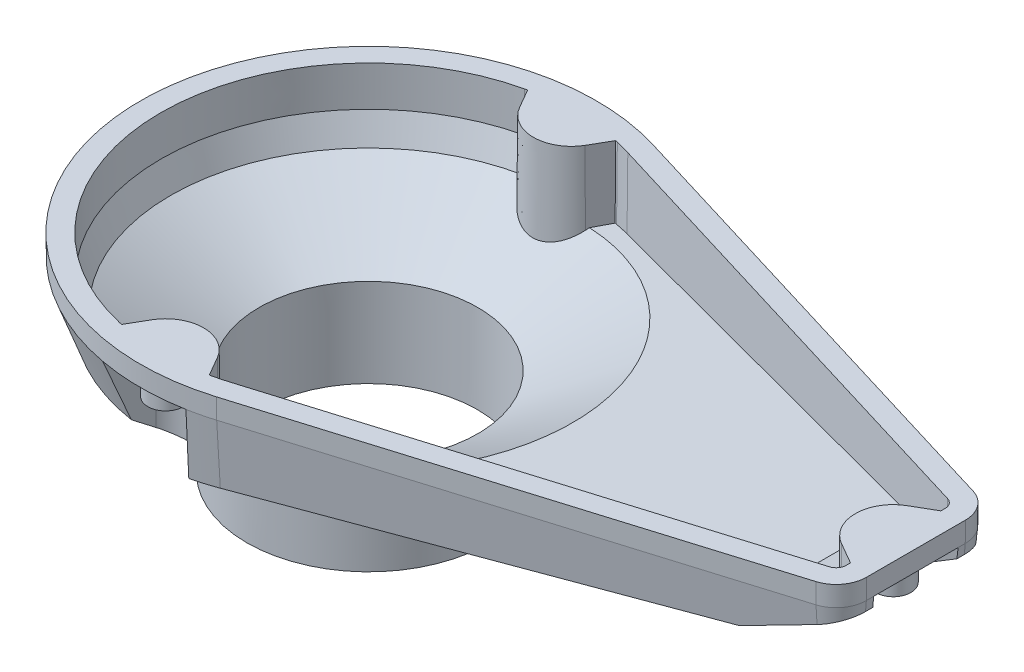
ISO-10303-21;
HEADER;
FILE_DESCRIPTION(('STEP AP214'),'2;1');
FILE_NAME('part.step','',(''),(''),'','','');
FILE_SCHEMA(('AUTOMOTIVE_DESIGN { 1 0 10303 214 1 1 1 1 }'));
ENDSEC;
DATA;
#1=APPLICATION_CONTEXT('core data for automotive mechanical design processes');
#2=APPLICATION_PROTOCOL_DEFINITION('international standard','automotive_design',2000,#1);
#3=PRODUCT_CONTEXT('',#1,'mechanical');
#4=PRODUCT('Part','Part','',(#3));
#5=PRODUCT_RELATED_PRODUCT_CATEGORY('part','',(#4));
#6=PRODUCT_DEFINITION_FORMATION('','',#4);
#7=PRODUCT_DEFINITION_CONTEXT('part definition',#1,'design');
#8=PRODUCT_DEFINITION('design','',#6,#7);
#9=PRODUCT_DEFINITION_SHAPE('','',#8);
#10=(LENGTH_UNIT() NAMED_UNIT(*) SI_UNIT(.MILLI.,.METRE.));
#11=(NAMED_UNIT(*) PLANE_ANGLE_UNIT() SI_UNIT($,.RADIAN.));
#12=(NAMED_UNIT(*) SI_UNIT($,.STERADIAN.) SOLID_ANGLE_UNIT());
#13=UNCERTAINTY_MEASURE_WITH_UNIT(LENGTH_MEASURE(1.E-05),#10,'distance_accuracy_value','');
#14=(GEOMETRIC_REPRESENTATION_CONTEXT(3) GLOBAL_UNCERTAINTY_ASSIGNED_CONTEXT((#13)) GLOBAL_UNIT_ASSIGNED_CONTEXT((#10,
#11,#12)) REPRESENTATION_CONTEXT('',''));
#15=CARTESIAN_POINT('',(0.,0.,0.));
#16=DIRECTION('',(0.,0.,1.));
#17=DIRECTION('',(1.,0.,0.));
#18=AXIS2_PLACEMENT_3D('',#15,#16,#17);
#19=CARTESIAN_POINT('',(102.4538779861,35.,1.38044512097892));
#20=DIRECTION('',(-0.921561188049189,0.,0.388233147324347));
#21=DIRECTION('',(0.388233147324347,0.,0.921561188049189));
#22=AXIS2_PLACEMENT_3D('',#19,#20,#21);
#23=PLANE('',#22);
#24=DIRECTION('',(0.,1.,0.));
#25=VECTOR('',#24,1.);
#26=CARTESIAN_POINT('',(101.781438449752,35.,-0.215745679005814));
#27=LINE('',#26,#25);
#28=CARTESIAN_POINT('',(101.781438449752,33.,-0.215745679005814));
#29=VERTEX_POINT('',#28);
#30=CARTESIAN_POINT('',(101.781438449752,35.,-0.215745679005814));
#31=VERTEX_POINT('',#30);
#32=EDGE_CURVE('E1339',#29,#31,#27,.T.);
#33=ORIENTED_EDGE('',*,*,#32,.T.);
#34=DIRECTION('',(0.388233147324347,0.,0.921561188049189));
#35=VECTOR('',#34,1.);
#36=CARTESIAN_POINT('',(102.4538779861,35.,1.38044512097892));
#37=LINE('',#36,#35);
#38=CARTESIAN_POINT('',(102.4538779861,35.,1.38044512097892));
#39=VERTEX_POINT('',#38);
#40=EDGE_CURVE('E1355',#39,#31,#37,.F.);
#41=ORIENTED_EDGE('',*,*,#40,.F.);
#42=DIRECTION('',(0.,1.,0.));
#43=VECTOR('',#42,1.);
#44=CARTESIAN_POINT('',(102.4538779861,35.,1.38044512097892));
#45=LINE('',#44,#43);
#46=CARTESIAN_POINT('',(102.4538779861,33.,1.38044512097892));
#47=VERTEX_POINT('',#46);
#48=EDGE_CURVE('E1327',#39,#47,#45,.F.);
#49=ORIENTED_EDGE('',*,*,#48,.T.);
#50=DIRECTION('',(0.388233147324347,0.,0.921561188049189));
#51=VECTOR('',#50,1.);
#52=CARTESIAN_POINT('',(102.4538779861,33.,1.38044512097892));
#53=LINE('',#52,#51);
#54=EDGE_CURVE('E1351',#29,#47,#53,.T.);
#55=ORIENTED_EDGE('',*,*,#54,.F.);
#56=EDGE_LOOP('',(#33,#41,#49,#55));
#57=FACE_BOUND('',#56,.T.);
#58=ADVANCED_FACE('F17',(#57),#23,.F.);
#59=CARTESIAN_POINT('',(-1.44096865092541,35.,-39.0389540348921));
#60=DIRECTION('',(-0.997914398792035,0.,0.0645511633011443));
#61=DIRECTION('',(0.0645511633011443,0.,0.997914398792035));
#62=AXIS2_PLACEMENT_3D('',#59,#60,#61);
#63=PLANE('',#62);
#64=DIRECTION('',(0.,1.,0.));
#65=VECTOR('',#64,1.);
#66=CARTESIAN_POINT('',(-1.55277454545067,35.,-40.7673924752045));
#67=LINE('',#66,#65);
#68=CARTESIAN_POINT('',(-1.55277454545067,33.,-40.7673924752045));
#69=VERTEX_POINT('',#68);
#70=CARTESIAN_POINT('',(-1.55277454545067,35.,-40.7673924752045));
#71=VERTEX_POINT('',#70);
#72=EDGE_CURVE('E1311',#69,#71,#67,.T.);
#73=ORIENTED_EDGE('',*,*,#72,.T.);
#74=DIRECTION('',(0.0645511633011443,0.,0.997914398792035));
#75=VECTOR('',#74,1.);
#76=CARTESIAN_POINT('',(-1.44096865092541,35.,-39.0389540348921));
#77=LINE('',#76,#75);
#78=CARTESIAN_POINT('',(-1.44096865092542,35.,-39.0389540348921));
#79=VERTEX_POINT('',#78);
#80=EDGE_CURVE('E1347',#79,#71,#77,.F.);
#81=ORIENTED_EDGE('',*,*,#80,.F.);
#82=DIRECTION('',(0.,1.,0.));
#83=VECTOR('',#82,1.);
#84=CARTESIAN_POINT('',(-1.44096865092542,35.,-39.0389540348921));
#85=LINE('',#84,#83);
#86=CARTESIAN_POINT('',(-1.44096865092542,33.,-39.0389540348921));
#87=VERTEX_POINT('',#86);
#88=EDGE_CURVE('E1299',#79,#87,#85,.F.);
#89=ORIENTED_EDGE('',*,*,#88,.T.);
#90=DIRECTION('',(0.0645511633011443,0.,0.997914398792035));
#91=VECTOR('',#90,1.);
#92=CARTESIAN_POINT('',(-1.44096865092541,33.,-39.0389540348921));
#93=LINE('',#92,#91);
#94=EDGE_CURVE('E1343',#69,#87,#93,.T.);
#95=ORIENTED_EDGE('',*,*,#94,.F.);
#96=EDGE_LOOP('',(#73,#81,#89,#95));
#97=FACE_BOUND('',#96,.T.);
#98=ADVANCED_FACE('F2362',(#97),#63,.F.);
#99=CARTESIAN_POINT('',(101.781438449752,35.,-0.215745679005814));
#100=DIRECTION('',(-0.797000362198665,0.,-0.603978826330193));
#101=DIRECTION('',(-0.603978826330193,0.,0.797000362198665));
#102=AXIS2_PLACEMENT_3D('',#99,#100,#101);
#103=PLANE('',#102);
#104=DIRECTION('',(0.,1.,0.));
#105=VECTOR('',#104,1.);
#106=CARTESIAN_POINT('',(102.827560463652,35.,-1.5961907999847));
#107=LINE('',#106,#105);
#108=CARTESIAN_POINT('',(102.827560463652,33.,-1.5961907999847));
#109=VERTEX_POINT('',#108);
#110=CARTESIAN_POINT('',(102.827560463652,35.,-1.5961907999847));
#111=VERTEX_POINT('',#110);
#112=EDGE_CURVE('E1291',#109,#111,#107,.T.);
#113=ORIENTED_EDGE('',*,*,#112,.T.);
#114=DIRECTION('',(-0.603978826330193,0.,0.797000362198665));
#115=VECTOR('',#114,1.);
#116=CARTESIAN_POINT('',(101.781438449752,35.,-0.215745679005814));
#117=LINE('',#116,#115);
#118=EDGE_CURVE('E1335',#31,#111,#117,.F.);
#119=ORIENTED_EDGE('',*,*,#118,.F.);
#120=ORIENTED_EDGE('',*,*,#32,.F.);
#121=DIRECTION('',(-0.603978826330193,0.,0.797000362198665));
#122=VECTOR('',#121,1.);
#123=CARTESIAN_POINT('',(101.781438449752,33.,-0.215745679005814));
#124=LINE('',#123,#122);
#125=EDGE_CURVE('E1331',#109,#29,#124,.T.);
#126=ORIENTED_EDGE('',*,*,#125,.F.);
#127=EDGE_LOOP('',(#113,#119,#120,#126));
#128=FACE_BOUND('',#127,.T.);
#129=ADVANCED_FACE('F2354',(#128),#103,.F.);
#130=CARTESIAN_POINT('',(104.172439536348,35.,1.59619079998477));
#131=DIRECTION('',(-0.124560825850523,0.,0.992211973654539));
#132=DIRECTION('',(0.992211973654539,0.,0.124560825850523));
#133=AXIS2_PLACEMENT_3D('',#130,#131,#132);
#134=PLANE('',#133);
#135=ORIENTED_EDGE('',*,*,#48,.F.);
#136=DIRECTION('',(-0.992211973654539,0.,-0.124560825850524));
#137=VECTOR('',#136,1.);
#138=CARTESIAN_POINT('',(104.172439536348,35.,1.59619079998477));
#139=LINE('',#138,#137);
#140=CARTESIAN_POINT('',(104.172439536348,35.,1.59619079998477));
#141=VERTEX_POINT('',#140);
#142=EDGE_CURVE('E1279',#141,#39,#139,.T.);
#143=ORIENTED_EDGE('',*,*,#142,.F.);
#144=DIRECTION('',(0.,1.,0.));
#145=VECTOR('',#144,1.);
#146=CARTESIAN_POINT('',(104.172439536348,35.,1.59619079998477));
#147=LINE('',#146,#145);
#148=CARTESIAN_POINT('',(104.172439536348,33.,1.59619079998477));
#149=VERTEX_POINT('',#148);
#150=EDGE_CURVE('E1271',#141,#149,#147,.F.);
#151=ORIENTED_EDGE('',*,*,#150,.T.);
#152=DIRECTION('',(0.992211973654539,0.,0.124560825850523));
#153=VECTOR('',#152,1.);
#154=CARTESIAN_POINT('',(104.172439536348,33.,1.59619079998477));
#155=LINE('',#154,#153);
#156=EDGE_CURVE('E1323',#47,#149,#155,.T.);
#157=ORIENTED_EDGE('',*,*,#156,.F.);
#158=EDGE_LOOP('',(#135,#143,#151,#157));
#159=FACE_BOUND('',#158,.T.);
#160=ADVANCED_FACE('F2346',(#159),#134,.F.);
#161=CARTESIAN_POINT('',(-0.797338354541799,35.,41.5376122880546));
#162=DIRECTION('',(-0.842539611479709,0.,0.538634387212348));
#163=DIRECTION('',(0.538634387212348,0.,0.842539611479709));
#164=AXIS2_PLACEMENT_3D('',#161,#162,#163);
#165=PLANE('',#164);
#166=DIRECTION('',(0.,1.,0.));
#167=VECTOR('',#166,1.);
#168=CARTESIAN_POINT('',(-1.73028047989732,35.,40.0782908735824));
#169=LINE('',#168,#167);
#170=CARTESIAN_POINT('',(-1.73028047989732,33.,40.0782908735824));
#171=VERTEX_POINT('',#170);
#172=CARTESIAN_POINT('',(-1.73028047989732,35.,40.0782908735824));
#173=VERTEX_POINT('',#172);
#174=EDGE_CURVE('E1263',#171,#173,#169,.T.);
#175=ORIENTED_EDGE('',*,*,#174,.T.);
#176=DIRECTION('',(0.538634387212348,0.,0.842539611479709));
#177=VECTOR('',#176,1.);
#178=CARTESIAN_POINT('',(-0.797338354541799,35.,41.5376122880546));
#179=LINE('',#178,#177);
#180=CARTESIAN_POINT('',(-0.797338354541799,35.,41.5376122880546));
#181=VERTEX_POINT('',#180);
#182=EDGE_CURVE('E1319',#181,#173,#179,.F.);
#183=ORIENTED_EDGE('',*,*,#182,.F.);
#184=DIRECTION('',(0.,1.,0.));
#185=VECTOR('',#184,1.);
#186=CARTESIAN_POINT('',(-0.797338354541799,35.,41.5376122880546));
#187=LINE('',#186,#185);
#188=CARTESIAN_POINT('',(-0.797338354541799,33.,41.5376122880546));
#189=VERTEX_POINT('',#188);
#190=EDGE_CURVE('E1251',#181,#189,#187,.F.);
#191=ORIENTED_EDGE('',*,*,#190,.T.);
#192=DIRECTION('',(0.538634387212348,0.,0.842539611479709));
#193=VECTOR('',#192,1.);
#194=CARTESIAN_POINT('',(-0.797338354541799,33.,41.5376122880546));
#195=LINE('',#194,#193);
#196=EDGE_CURVE('E1315',#171,#189,#195,.T.);
#197=ORIENTED_EDGE('',*,*,#196,.F.);
#198=EDGE_LOOP('',(#175,#183,#191,#197));
#199=FACE_BOUND('',#198,.T.);
#200=ADVANCED_FACE('F2338',(#199),#165,.F.);
#201=CARTESIAN_POINT('',(-1.55277454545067,35.,-40.7673924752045));
#202=DIRECTION('',(-0.554860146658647,0.,-0.831943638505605));
#203=DIRECTION('',(-0.831943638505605,0.,0.554860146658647));
#204=AXIS2_PLACEMENT_3D('',#201,#202,#203);
#205=PLANE('',#204);
#206=DIRECTION('',(0.,1.,0.));
#207=VECTOR('',#206,1.);
#208=CARTESIAN_POINT('',(-0.111805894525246,35.,-41.7284384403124));
#209=LINE('',#208,#207);
#210=CARTESIAN_POINT('',(-0.111805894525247,33.,-41.7284384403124));
#211=VERTEX_POINT('',#210);
#212=CARTESIAN_POINT('',(-0.111805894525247,35.,-41.7284384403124));
#213=VERTEX_POINT('',#212);
#214=EDGE_CURVE('E1243',#211,#213,#209,.T.);
#215=ORIENTED_EDGE('',*,*,#214,.T.);
#216=DIRECTION('',(-0.831943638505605,0.,0.554860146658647));
#217=VECTOR('',#216,1.);
#218=CARTESIAN_POINT('',(-1.55277454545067,35.,-40.7673924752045));
#219=LINE('',#218,#217);
#220=EDGE_CURVE('E1307',#71,#213,#219,.F.);
#221=ORIENTED_EDGE('',*,*,#220,.F.);
#222=ORIENTED_EDGE('',*,*,#72,.F.);
#223=DIRECTION('',(-0.831943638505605,0.,0.554860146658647));
#224=VECTOR('',#223,1.);
#225=CARTESIAN_POINT('',(-1.55277454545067,33.,-40.7673924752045));
#226=LINE('',#225,#224);
#227=EDGE_CURVE('E1303',#211,#69,#226,.T.);
#228=ORIENTED_EDGE('',*,*,#227,.F.);
#229=EDGE_LOOP('',(#215,#221,#222,#228));
#230=FACE_BOUND('',#229,.T.);
#231=ADVANCED_FACE('F2330',(#230),#205,.F.);
#232=CARTESIAN_POINT('',(0.111805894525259,35.,-38.2715615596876));
#233=DIRECTION('',(-0.443054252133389,0.,0.89649480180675));
#234=DIRECTION('',(0.89649480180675,0.,0.443054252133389));
#235=AXIS2_PLACEMENT_3D('',#232,#233,#234);
#236=PLANE('',#235);
#237=ORIENTED_EDGE('',*,*,#88,.F.);
#238=DIRECTION('',(-0.896494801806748,0.,-0.443054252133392));
#239=VECTOR('',#238,1.);
#240=CARTESIAN_POINT('',(0.111805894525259,35.,-38.2715615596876));
#241=LINE('',#240,#239);
#242=CARTESIAN_POINT('',(0.111805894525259,35.,-38.2715615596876));
#243=VERTEX_POINT('',#242);
#244=EDGE_CURVE('E1231',#243,#79,#241,.T.);
#245=ORIENTED_EDGE('',*,*,#244,.F.);
#246=DIRECTION('',(0.,1.,0.));
#247=VECTOR('',#246,1.);
#248=CARTESIAN_POINT('',(0.111805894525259,35.,-38.2715615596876));
#249=LINE('',#248,#247);
#250=CARTESIAN_POINT('',(0.111805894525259,33.,-38.2715615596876));
#251=VERTEX_POINT('',#250);
#252=EDGE_CURVE('E1223',#243,#251,#249,.F.);
#253=ORIENTED_EDGE('',*,*,#252,.T.);
#254=DIRECTION('',(0.89649480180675,0.,0.443054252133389));
#255=VECTOR('',#254,1.);
#256=CARTESIAN_POINT('',(0.111805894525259,33.,-38.2715615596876));
#257=LINE('',#256,#255);
#258=EDGE_CURVE('E1295',#87,#251,#257,.T.);
#259=ORIENTED_EDGE('',*,*,#258,.F.);
#260=EDGE_LOOP('',(#237,#245,#253,#259));
#261=FACE_BOUND('',#260,.T.);
#262=ADVANCED_FACE('F2322',(#261),#236,.F.);
#263=CARTESIAN_POINT('',(102.827560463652,35.,-1.5961907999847));
#264=DIRECTION('',(0.124560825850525,0.,-0.992211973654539));
#265=DIRECTION('',(-0.992211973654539,0.,-0.124560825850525));
#266=AXIS2_PLACEMENT_3D('',#263,#264,#265);
#267=PLANE('',#266);
#268=DIRECTION('',(0.,1.,0.));
#269=VECTOR('',#268,1.);
#270=CARTESIAN_POINT('',(104.5461220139,35.,-1.38044512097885));
#271=LINE('',#270,#269);
#272=CARTESIAN_POINT('',(104.5461220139,33.,-1.38044512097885));
#273=VERTEX_POINT('',#272);
#274=CARTESIAN_POINT('',(104.5461220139,35.,-1.38044512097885));
#275=VERTEX_POINT('',#274);
#276=EDGE_CURVE('E1215',#273,#275,#271,.T.);
#277=ORIENTED_EDGE('',*,*,#276,.T.);
#278=DIRECTION('',(0.992211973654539,0.,0.124560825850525));
#279=VECTOR('',#278,1.);
#280=CARTESIAN_POINT('',(102.827560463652,35.,-1.5961907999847));
#281=LINE('',#280,#279);
#282=EDGE_CURVE('E1283',#111,#275,#281,.T.);
#283=ORIENTED_EDGE('',*,*,#282,.F.);
#284=ORIENTED_EDGE('',*,*,#112,.F.);
#285=DIRECTION('',(-0.992211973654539,0.,-0.124560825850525));
#286=VECTOR('',#285,1.);
#287=CARTESIAN_POINT('',(102.827560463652,33.,-1.5961907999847));
#288=LINE('',#287,#286);
#289=EDGE_CURVE('E1287',#273,#109,#288,.T.);
#290=ORIENTED_EDGE('',*,*,#289,.F.);
#291=EDGE_LOOP('',(#277,#283,#284,#290));
#292=FACE_BOUND('',#291,.T.);
#293=ADVANCED_FACE('F2314',(#292),#267,.F.);
#294=CARTESIAN_POINT('',(0.,35.,0.));
#295=DIRECTION('',(0.,-1.,0.));
#296=DIRECTION('',(0.,0.,-1.));
#297=AXIS2_PLACEMENT_3D('',#294,#295,#296);
#298=PLANE('',#297);
#299=ORIENTED_EDGE('',*,*,#40,.T.);
#300=ORIENTED_EDGE('',*,*,#118,.T.);
#301=ORIENTED_EDGE('',*,*,#282,.T.);
#302=DIRECTION('',(-0.388233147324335,0.,-0.921561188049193));
#303=VECTOR('',#302,1.);
#304=CARTESIAN_POINT('',(104.5461220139,35.,-1.38044512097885));
#305=LINE('',#304,#303);
#306=CARTESIAN_POINT('',(105.218561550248,35.,0.215745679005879));
#307=VERTEX_POINT('',#306);
#308=EDGE_CURVE('E1211',#275,#307,#305,.F.);
#309=ORIENTED_EDGE('',*,*,#308,.T.);
#310=DIRECTION('',(0.603978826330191,0.,-0.797000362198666));
#311=VECTOR('',#310,1.);
#312=CARTESIAN_POINT('',(105.218561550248,35.,0.215745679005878));
#313=LINE('',#312,#311);
#314=EDGE_CURVE('E1275',#307,#141,#313,.F.);
#315=ORIENTED_EDGE('',*,*,#314,.T.);
#316=ORIENTED_EDGE('',*,*,#142,.T.);
#317=EDGE_LOOP('',(#299,#300,#301,#309,#315,#316));
#318=FACE_BOUND('',#317,.T.);
#319=ADVANCED_FACE('F2306',(#318),#298,.T.);
#320=CARTESIAN_POINT('',(105.218561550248,35.,0.215745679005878));
#321=DIRECTION('',(0.797000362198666,0.,0.603978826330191));
#322=DIRECTION('',(0.603978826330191,0.,-0.797000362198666));
#323=AXIS2_PLACEMENT_3D('',#320,#321,#322);
#324=PLANE('',#323);
#325=ORIENTED_EDGE('',*,*,#150,.F.);
#326=ORIENTED_EDGE('',*,*,#314,.F.);
#327=DIRECTION('',(0.,1.,0.));
#328=VECTOR('',#327,1.);
#329=CARTESIAN_POINT('',(105.218561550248,35.,0.215745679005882));
#330=LINE('',#329,#328);
#331=CARTESIAN_POINT('',(105.218561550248,33.,0.215745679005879));
#332=VERTEX_POINT('',#331);
#333=EDGE_CURVE('E1207',#307,#332,#330,.F.);
#334=ORIENTED_EDGE('',*,*,#333,.T.);
#335=DIRECTION('',(0.603978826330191,0.,-0.797000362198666));
#336=VECTOR('',#335,1.);
#337=CARTESIAN_POINT('',(105.218561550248,33.,0.215745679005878));
#338=LINE('',#337,#336);
#339=EDGE_CURVE('E1267',#149,#332,#338,.T.);
#340=ORIENTED_EDGE('',*,*,#339,.F.);
#341=EDGE_LOOP('',(#325,#326,#334,#340));
#342=FACE_BOUND('',#341,.T.);
#343=ADVANCED_FACE('F2298',(#342),#324,.F.);
#344=CARTESIAN_POINT('',(-1.73028047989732,35.,40.0782908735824));
#345=DIRECTION('',(-0.887740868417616,0.,-0.460343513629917));
#346=DIRECTION('',(-0.460343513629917,0.,0.887740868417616));
#347=AXIS2_PLACEMENT_3D('',#344,#345,#346);
#348=PLANE('',#347);
#349=DIRECTION('',(0.,1.,0.));
#350=VECTOR('',#349,1.);
#351=CARTESIAN_POINT('',(-0.932942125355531,35.,38.5406785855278));
#352=LINE('',#351,#350);
#353=CARTESIAN_POINT('',(-0.932942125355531,33.,38.5406785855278));
#354=VERTEX_POINT('',#353);
#355=CARTESIAN_POINT('',(-0.932942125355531,35.,38.5406785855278));
#356=VERTEX_POINT('',#355);
#357=EDGE_CURVE('E1203',#354,#356,#352,.T.);
#358=ORIENTED_EDGE('',*,*,#357,.T.);
#359=DIRECTION('',(-0.460343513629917,0.,0.887740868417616));
#360=VECTOR('',#359,1.);
#361=CARTESIAN_POINT('',(-1.73028047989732,35.,40.0782908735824));
#362=LINE('',#361,#360);
#363=EDGE_CURVE('E1259',#173,#356,#362,.F.);
#364=ORIENTED_EDGE('',*,*,#363,.F.);
#365=ORIENTED_EDGE('',*,*,#174,.F.);
#366=DIRECTION('',(-0.460343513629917,0.,0.887740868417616));
#367=VECTOR('',#366,1.);
#368=CARTESIAN_POINT('',(-1.73028047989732,33.,40.0782908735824));
#369=LINE('',#368,#367);
#370=EDGE_CURVE('E1255',#354,#171,#369,.T.);
#371=ORIENTED_EDGE('',*,*,#370,.F.);
#372=EDGE_LOOP('',(#358,#364,#365,#371));
#373=FACE_BOUND('',#372,.T.);
#374=ADVANCED_FACE('F2290',(#373),#348,.F.);
#375=CARTESIAN_POINT('',(0.93294212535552,35.,41.4593214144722));
#376=DIRECTION('',(0.0452012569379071,0.,0.998977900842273));
#377=DIRECTION('',(0.998977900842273,0.,-0.0452012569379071));
#378=AXIS2_PLACEMENT_3D('',#375,#376,#377);
#379=PLANE('',#378);
#380=ORIENTED_EDGE('',*,*,#190,.F.);
#381=DIRECTION('',(-0.998977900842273,0.,0.0452012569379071));
#382=VECTOR('',#381,1.);
#383=CARTESIAN_POINT('',(0.93294212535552,35.,41.4593214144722));
#384=LINE('',#383,#382);
#385=CARTESIAN_POINT('',(0.93294212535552,35.,41.4593214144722));
#386=VERTEX_POINT('',#385);
#387=EDGE_CURVE('E1191',#386,#181,#384,.T.);
#388=ORIENTED_EDGE('',*,*,#387,.F.);
#389=DIRECTION('',(0.,1.,0.));
#390=VECTOR('',#389,1.);
#391=CARTESIAN_POINT('',(0.93294212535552,35.,41.4593214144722));
#392=LINE('',#391,#390);
#393=CARTESIAN_POINT('',(0.93294212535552,33.,41.4593214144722));
#394=VERTEX_POINT('',#393);
#395=EDGE_CURVE('E1183',#386,#394,#392,.F.);
#396=ORIENTED_EDGE('',*,*,#395,.T.);
#397=DIRECTION('',(0.998977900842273,0.,-0.0452012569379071));
#398=VECTOR('',#397,1.);
#399=CARTESIAN_POINT('',(0.93294212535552,33.,41.4593214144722));
#400=LINE('',#399,#398);
#401=EDGE_CURVE('E1247',#189,#394,#400,.T.);
#402=ORIENTED_EDGE('',*,*,#401,.F.);
#403=EDGE_LOOP('',(#380,#388,#396,#402));
#404=FACE_BOUND('',#403,.T.);
#405=ADVANCED_FACE('F2282',(#404),#379,.F.);
#406=CARTESIAN_POINT('',(-0.111805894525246,35.,-41.7284384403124));
#407=DIRECTION('',(0.44305425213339,0.,-0.896494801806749));
#408=DIRECTION('',(-0.896494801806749,0.,-0.44305425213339));
#409=AXIS2_PLACEMENT_3D('',#406,#407,#408);
#410=PLANE('',#409);
#411=DIRECTION('',(0.,1.,0.));
#412=VECTOR('',#411,1.);
#413=CARTESIAN_POINT('',(1.44096865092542,35.,-40.9610459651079));
#414=LINE('',#413,#412);
#415=CARTESIAN_POINT('',(1.44096865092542,33.,-40.9610459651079));
#416=VERTEX_POINT('',#415);
#417=CARTESIAN_POINT('',(1.44096865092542,35.,-40.9610459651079));
#418=VERTEX_POINT('',#417);
#419=EDGE_CURVE('E1175',#416,#418,#414,.T.);
#420=ORIENTED_EDGE('',*,*,#419,.T.);
#421=DIRECTION('',(0.896494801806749,0.,0.44305425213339));
#422=VECTOR('',#421,1.);
#423=CARTESIAN_POINT('',(-0.111805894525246,35.,-41.7284384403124));
#424=LINE('',#423,#422);
#425=EDGE_CURVE('E1235',#213,#418,#424,.T.);
#426=ORIENTED_EDGE('',*,*,#425,.F.);
#427=ORIENTED_EDGE('',*,*,#214,.F.);
#428=DIRECTION('',(-0.896494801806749,0.,-0.44305425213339));
#429=VECTOR('',#428,1.);
#430=CARTESIAN_POINT('',(-0.111805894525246,33.,-41.7284384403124));
#431=LINE('',#430,#429);
#432=EDGE_CURVE('E1239',#416,#211,#431,.T.);
#433=ORIENTED_EDGE('',*,*,#432,.F.);
#434=EDGE_LOOP('',(#420,#426,#427,#433));
#435=FACE_BOUND('',#434,.T.);
#436=ADVANCED_FACE('F2274',(#435),#410,.F.);
#437=CARTESIAN_POINT('',(0.,35.,0.));
#438=DIRECTION('',(0.,-1.,0.));
#439=DIRECTION('',(0.,0.,-1.));
#440=AXIS2_PLACEMENT_3D('',#437,#438,#439);
#441=PLANE('',#440);
#442=ORIENTED_EDGE('',*,*,#80,.T.);
#443=ORIENTED_EDGE('',*,*,#220,.T.);
#444=ORIENTED_EDGE('',*,*,#425,.T.);
#445=DIRECTION('',(-0.0645511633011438,0.,-0.997914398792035));
#446=VECTOR('',#445,1.);
#447=CARTESIAN_POINT('',(1.44096865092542,35.,-40.9610459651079));
#448=LINE('',#447,#446);
#449=CARTESIAN_POINT('',(1.55277454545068,35.,-39.2326075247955));
#450=VERTEX_POINT('',#449);
#451=EDGE_CURVE('E1171',#418,#450,#448,.F.);
#452=ORIENTED_EDGE('',*,*,#451,.T.);
#453=DIRECTION('',(0.831943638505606,0.,-0.554860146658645));
#454=VECTOR('',#453,1.);
#455=CARTESIAN_POINT('',(1.55277454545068,35.,-39.2326075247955));
#456=LINE('',#455,#454);
#457=EDGE_CURVE('E1227',#450,#243,#456,.F.);
#458=ORIENTED_EDGE('',*,*,#457,.T.);
#459=ORIENTED_EDGE('',*,*,#244,.T.);
#460=EDGE_LOOP('',(#442,#443,#444,#452,#458,#459));
#461=FACE_BOUND('',#460,.T.);
#462=ADVANCED_FACE('F2266',(#461),#441,.T.);
#463=CARTESIAN_POINT('',(1.55277454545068,35.,-39.2326075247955));
#464=DIRECTION('',(0.554860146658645,0.,0.831943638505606));
#465=DIRECTION('',(0.831943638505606,0.,-0.554860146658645));
#466=AXIS2_PLACEMENT_3D('',#463,#464,#465);
#467=PLANE('',#466);
#468=ORIENTED_EDGE('',*,*,#252,.F.);
#469=ORIENTED_EDGE('',*,*,#457,.F.);
#470=DIRECTION('',(0.,1.,0.));
#471=VECTOR('',#470,1.);
#472=CARTESIAN_POINT('',(1.55277454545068,35.,-39.2326075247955));
#473=LINE('',#472,#471);
#474=CARTESIAN_POINT('',(1.55277454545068,33.,-39.2326075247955));
#475=VERTEX_POINT('',#474);
#476=EDGE_CURVE('E1167',#450,#475,#473,.F.);
#477=ORIENTED_EDGE('',*,*,#476,.T.);
#478=DIRECTION('',(0.831943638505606,0.,-0.554860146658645));
#479=VECTOR('',#478,1.);
#480=CARTESIAN_POINT('',(1.55277454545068,33.,-39.2326075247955));
#481=LINE('',#480,#479);
#482=EDGE_CURVE('E1219',#251,#475,#481,.T.);
#483=ORIENTED_EDGE('',*,*,#482,.F.);
#484=EDGE_LOOP('',(#468,#469,#477,#483));
#485=FACE_BOUND('',#484,.T.);
#486=ADVANCED_FACE('F2258',(#485),#467,.F.);
#487=CARTESIAN_POINT('',(104.5461220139,35.,-1.38044512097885));
#488=DIRECTION('',(0.921561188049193,0.,-0.388233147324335));
#489=DIRECTION('',(-0.388233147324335,0.,-0.921561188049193));
#490=AXIS2_PLACEMENT_3D('',#487,#488,#489);
#491=PLANE('',#490);
#492=ORIENTED_EDGE('',*,*,#333,.F.);
#493=ORIENTED_EDGE('',*,*,#308,.F.);
#494=ORIENTED_EDGE('',*,*,#276,.F.);
#495=DIRECTION('',(0.388233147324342,0.,0.921561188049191));
#496=VECTOR('',#495,1.);
#497=CARTESIAN_POINT('',(104.5461220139,33.,-1.38044512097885));
#498=LINE('',#497,#496);
#499=EDGE_CURVE('E373',#273,#332,#498,.T.);
#500=ORIENTED_EDGE('',*,*,#499,.T.);
#501=EDGE_LOOP('',(#492,#493,#494,#500));
#502=FACE_BOUND('',#501,.T.);
#503=ADVANCED_FACE('F2251',(#502),#491,.F.);
#504=CARTESIAN_POINT('',(-0.932942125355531,35.,38.5406785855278));
#505=DIRECTION('',(-0.0452012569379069,0.,-0.998977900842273));
#506=DIRECTION('',(-0.998977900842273,0.,0.0452012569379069));
#507=AXIS2_PLACEMENT_3D('',#504,#505,#506);
#508=PLANE('',#507);
#509=DIRECTION('',(0.,1.,0.));
#510=VECTOR('',#509,1.);
#511=CARTESIAN_POINT('',(0.797338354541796,35.,38.4623877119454));
#512=LINE('',#511,#510);
#513=CARTESIAN_POINT('',(0.797338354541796,33.,38.4623877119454));
#514=VERTEX_POINT('',#513);
#515=CARTESIAN_POINT('',(0.797338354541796,35.,38.4623877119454));
#516=VERTEX_POINT('',#515);
#517=EDGE_CURVE('E1450',#514,#516,#512,.T.);
#518=ORIENTED_EDGE('',*,*,#517,.T.);
#519=DIRECTION('',(0.998977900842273,0.,-0.0452012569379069));
#520=VECTOR('',#519,1.);
#521=CARTESIAN_POINT('',(-0.932942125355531,35.,38.5406785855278));
#522=LINE('',#521,#520);
#523=EDGE_CURVE('E1195',#356,#516,#522,.T.);
#524=ORIENTED_EDGE('',*,*,#523,.F.);
#525=ORIENTED_EDGE('',*,*,#357,.F.);
#526=DIRECTION('',(-0.998977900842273,0.,0.0452012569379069));
#527=VECTOR('',#526,1.);
#528=CARTESIAN_POINT('',(-0.932942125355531,33.,38.5406785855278));
#529=LINE('',#528,#527);
#530=EDGE_CURVE('E1199',#514,#354,#529,.T.);
#531=ORIENTED_EDGE('',*,*,#530,.F.);
#532=EDGE_LOOP('',(#518,#524,#525,#531));
#533=FACE_BOUND('',#532,.T.);
#534=ADVANCED_FACE('F1582',(#533),#508,.F.);
#535=CARTESIAN_POINT('',(0.,35.,0.));
#536=DIRECTION('',(0.,-1.,0.));
#537=DIRECTION('',(0.,0.,-1.));
#538=AXIS2_PLACEMENT_3D('',#535,#536,#537);
#539=PLANE('',#538);
#540=ORIENTED_EDGE('',*,*,#182,.T.);
#541=ORIENTED_EDGE('',*,*,#363,.T.);
#542=ORIENTED_EDGE('',*,*,#523,.T.);
#543=DIRECTION('',(-0.538634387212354,0.,-0.842539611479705));
#544=VECTOR('',#543,1.);
#545=CARTESIAN_POINT('',(0.797338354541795,35.,38.4623877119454));
#546=LINE('',#545,#544);
#547=CARTESIAN_POINT('',(1.73028047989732,35.,39.9217091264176));
#548=VERTEX_POINT('',#547);
#549=EDGE_CURVE('E1572',#516,#548,#546,.F.);
#550=ORIENTED_EDGE('',*,*,#549,.T.);
#551=DIRECTION('',(0.460343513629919,0.,-0.887740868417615));
#552=VECTOR('',#551,1.);
#553=CARTESIAN_POINT('',(1.73028047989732,35.,39.9217091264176));
#554=LINE('',#553,#552);
#555=EDGE_CURVE('E1187',#548,#386,#554,.F.);
#556=ORIENTED_EDGE('',*,*,#555,.T.);
#557=ORIENTED_EDGE('',*,*,#387,.T.);
#558=EDGE_LOOP('',(#540,#541,#542,#550,#556,#557));
#559=FACE_BOUND('',#558,.T.);
#560=ADVANCED_FACE('F1593',(#559),#539,.T.);
#561=CARTESIAN_POINT('',(1.73028047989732,35.,39.9217091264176));
#562=DIRECTION('',(0.887740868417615,0.,0.460343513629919));
#563=DIRECTION('',(0.460343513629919,0.,-0.887740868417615));
#564=AXIS2_PLACEMENT_3D('',#561,#562,#563);
#565=PLANE('',#564);
#566=ORIENTED_EDGE('',*,*,#395,.F.);
#567=ORIENTED_EDGE('',*,*,#555,.F.);
#568=DIRECTION('',(0.,1.,0.));
#569=VECTOR('',#568,1.);
#570=CARTESIAN_POINT('',(1.73028047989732,35.,39.9217091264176));
#571=LINE('',#570,#569);
#572=CARTESIAN_POINT('',(1.73028047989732,33.,39.9217091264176));
#573=VERTEX_POINT('',#572);
#574=EDGE_CURVE('E1568',#548,#573,#571,.F.);
#575=ORIENTED_EDGE('',*,*,#574,.T.);
#576=DIRECTION('',(0.460343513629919,0.,-0.887740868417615));
#577=VECTOR('',#576,1.);
#578=CARTESIAN_POINT('',(1.73028047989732,33.,39.9217091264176));
#579=LINE('',#578,#577);
#580=EDGE_CURVE('E1179',#394,#573,#579,.T.);
#581=ORIENTED_EDGE('',*,*,#580,.F.);
#582=EDGE_LOOP('',(#566,#567,#575,#581));
#583=FACE_BOUND('',#582,.T.);
#584=ADVANCED_FACE('F1603',(#583),#565,.F.);
#585=CARTESIAN_POINT('',(1.44096865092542,35.,-40.9610459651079));
#586=DIRECTION('',(0.997914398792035,0.,-0.0645511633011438));
#587=DIRECTION('',(-0.0645511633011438,0.,-0.997914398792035));
#588=AXIS2_PLACEMENT_3D('',#585,#586,#587);
#589=PLANE('',#588);
#590=ORIENTED_EDGE('',*,*,#476,.F.);
#591=ORIENTED_EDGE('',*,*,#451,.F.);
#592=ORIENTED_EDGE('',*,*,#419,.F.);
#593=DIRECTION('',(0.0645511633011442,0.,0.997914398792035));
#594=VECTOR('',#593,1.);
#595=CARTESIAN_POINT('',(1.44096865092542,33.,-40.9610459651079));
#596=LINE('',#595,#594);
#597=EDGE_CURVE('E1492',#416,#475,#596,.T.);
#598=ORIENTED_EDGE('',*,*,#597,.T.);
#599=EDGE_LOOP('',(#590,#591,#592,#598));
#600=FACE_BOUND('',#599,.T.);
#601=ADVANCED_FACE('F2226',(#600),#589,.F.);
#602=CARTESIAN_POINT('',(103.5,33.,0.));
#603=DIRECTION('',(0.,1.,0.));
#604=DIRECTION('',(0.,0.,1.));
#605=AXIS2_PLACEMENT_3D('',#602,#603,#604);
#606=PLANE('',#605);
#607=CARTESIAN_POINT('',(103.5,33.,0.));
#608=DIRECTION('',(0.,1.,0.));
#609=DIRECTION('',(0.,0.,1.));
#610=AXIS2_PLACEMENT_3D('',#607,#608,#609);
#611=CIRCLE('',#610,3.50000000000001);
#612=CARTESIAN_POINT('',(103.5,33.,3.50000000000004));
#613=VERTEX_POINT('',#612);
#614=EDGE_CURVE('E533',#613,#613,#611,.T.);
#615=ORIENTED_EDGE('',*,*,#614,.F.);
#616=EDGE_LOOP('',(#615));
#617=FACE_BOUND('',#616,.T.);
#618=ORIENTED_EDGE('',*,*,#289,.T.);
#619=ORIENTED_EDGE('',*,*,#125,.T.);
#620=ORIENTED_EDGE('',*,*,#54,.T.);
#621=ORIENTED_EDGE('',*,*,#156,.T.);
#622=ORIENTED_EDGE('',*,*,#339,.T.);
#623=ORIENTED_EDGE('',*,*,#499,.F.);
#624=EDGE_LOOP('',(#618,#619,#620,#621,#622,#623));
#625=FACE_BOUND('',#624,.T.);
#626=ADVANCED_FACE('F524',(#617,#625),#606,.F.);
#627=CARTESIAN_POINT('',(0.0689970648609,41.0000000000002,-0.302561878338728));
#628=DIRECTION('',(0.,1.,0.));
#629=DIRECTION('',(0.,0.,1.));
#630=AXIS2_PLACEMENT_3D('',#627,#628,#629);
#631=CONICAL_SURFACE('',#630,40.6895754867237,0.00872664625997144);
#632=CARTESIAN_POINT('',(0.0875489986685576,26.5490200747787,-0.302561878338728));
#633=DIRECTION('',(0.0523359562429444,-0.998629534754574,0.));
#634=DIRECTION('',(0.998629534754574,0.0523359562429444,0.));
#635=AXIS2_PLACEMENT_3D('',#632,#633,#634);
#636=ELLIPSE('',#635,40.6191308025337,40.5634594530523);
#637=CARTESIAN_POINT('',(8.72412531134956,27.0016438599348,-39.9359292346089));
#638=VERTEX_POINT('',#637);
#639=CARTESIAN_POINT('',(9.08858953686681,27.0207446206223,-39.8547492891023));
#640=VERTEX_POINT('',#639);
#641=EDGE_CURVE('E377',#638,#640,#636,.T.);
#642=ORIENTED_EDGE('',*,*,#641,.T.);
#643=DIRECTION('',(-0.00194021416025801,-0.999961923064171,0.00850811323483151));
#644=VECTOR('',#643,1.);
#645=CARTESIAN_POINT('',(9.11571331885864,41.,-39.9736909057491));
#646=LINE('',#645,#644);
#647=CARTESIAN_POINT('',(9.11571331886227,40.9999999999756,-39.9736909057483));
#648=VERTEX_POINT('',#647);
#649=EDGE_CURVE('E375',#640,#648,#646,.F.);
#650=ORIENTED_EDGE('',*,*,#649,.T.);
#651=CARTESIAN_POINT('',(0.0689970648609,41.,-0.302561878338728));
#652=DIRECTION('',(0.,1.,0.));
#653=DIRECTION('',(0.,0.,1.));
#654=AXIS2_PLACEMENT_3D('',#651,#652,#653);
#655=CIRCLE('',#654,40.6895754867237);
#656=CARTESIAN_POINT('',(8.66291671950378,41.,-40.0742364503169));
#657=VERTEX_POINT('',#656);
#658=EDGE_CURVE('E20',#657,#648,#655,.F.);
#659=ORIENTED_EDGE('',*,*,#658,.F.);
#660=CARTESIAN_POINT('',(8.72412531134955,27.0016438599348,-39.9359292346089));
#661=CARTESIAN_POINT('',(8.71393244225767,29.3347031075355,-39.9589952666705));
#662=CARTESIAN_POINT('',(8.70373529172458,31.6677624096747,-39.9820538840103));
#663=CARTESIAN_POINT('',(8.68333242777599,36.3338811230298,-40.0281562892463));
#664=CARTESIAN_POINT('',(8.67312671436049,38.6669405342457,-40.0512000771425));
#665=CARTESIAN_POINT('',(8.66291671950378,41.0000000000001,-40.0742364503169));
#666=B_SPLINE_CURVE_WITH_KNOTS('',3,(#660,#661,#662,#663,#664,#665),.UNSPECIFIED.,.F.,.F.,(4,2,
4),(0.,6.99958659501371,13.9991731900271),.UNSPECIFIED.);
#667=EDGE_CURVE('E526',#638,#657,#666,.T.);
#668=ORIENTED_EDGE('',*,*,#667,.F.);
#669=EDGE_LOOP('',(#642,#650,#659,#668));
#670=FACE_BOUND('',#669,.T.);
#671=ADVANCED_FACE('F376',(#670),#631,.F.);
#672=CARTESIAN_POINT('',(103.999807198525,41.,-9.76975838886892));
#673=DIRECTION('',(-0.99996040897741,0.00872653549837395,-0.00174013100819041));
#674=DIRECTION('',(-0.00872654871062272,-0.99996192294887,0.));
#675=AXIS2_PLACEMENT_3D('',#672,#673,#674);
#676=PLANE('',#675);
#677=DIRECTION('',(-0.00871766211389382,-0.999949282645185,-0.00504326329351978));
#678=VECTOR('',#677,1.);
#679=CARTESIAN_POINT('',(103.99830713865,41.,-8.90775404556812));
#680=LINE('',#679,#678);
#681=CARTESIAN_POINT('',(103.99830713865,41.,-8.90775404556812));
#682=VERTEX_POINT('',#681);
#683=CARTESIAN_POINT('',(103.956744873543,36.2326487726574,-8.93179827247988));
#684=VERTEX_POINT('',#683);
#685=EDGE_CURVE('E1142',#682,#684,#680,.T.);
#686=ORIENTED_EDGE('',*,*,#685,.F.);
#687=DIRECTION('',(0.00174019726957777,0.,-0.999998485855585));
#688=VECTOR('',#687,1.);
#689=CARTESIAN_POINT('',(103.99830713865,41.,-8.90775404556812));
#690=LINE('',#689,#688);
#691=CARTESIAN_POINT('',(103.999807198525,40.9999999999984,-9.76975838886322));
#692=VERTEX_POINT('',#691);
#693=EDGE_CURVE('E372',#682,#692,#690,.T.);
#694=ORIENTED_EDGE('',*,*,#693,.T.);
#695=CARTESIAN_POINT('',(103.999807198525,40.9999999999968,-9.76975838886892));
#696=CARTESIAN_POINT('',(103.998073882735,40.801383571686,-9.76975149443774));
#697=CARTESIAN_POINT('',(103.996340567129,40.6027671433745,-9.76974457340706));
#698=CARTESIAN_POINT('',(103.992873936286,40.2055342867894,-9.76973067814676));
#699=CARTESIAN_POINT('',(103.991140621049,40.0069178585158,-9.76972370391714));
#700=CARTESIAN_POINT('',(103.987673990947,39.6096850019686,-9.76970970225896));
#701=CARTESIAN_POINT('',(103.985940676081,39.411068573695,-9.7697026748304));
#702=CARTESIAN_POINT('',(103.982474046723,39.0138357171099,-9.76968856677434));
#703=CARTESIAN_POINT('',(103.980740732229,38.8152192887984,-9.76968148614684));
#704=CARTESIAN_POINT('',(103.977274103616,38.4179864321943,-9.76966727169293));
#705=CARTESIAN_POINT('',(103.975540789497,38.2193700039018,-9.76966013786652));
#706=CARTESIAN_POINT('',(103.972074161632,37.8221371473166,-9.76964581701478));
#707=CARTESIAN_POINT('',(103.970340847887,37.6235207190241,-9.76963862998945));
#708=CARTESIAN_POINT('',(103.966874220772,37.226287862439,-9.7696242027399));
#709=CARTESIAN_POINT('',(103.965140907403,37.0276714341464,-9.76961696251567));
#710=CARTESIAN_POINT('',(103.961674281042,36.6304385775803,-9.76960242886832));
#711=CARTESIAN_POINT('',(103.959940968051,36.4318221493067,-9.7695951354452));
#712=CARTESIAN_POINT('',(103.958207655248,36.2332057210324,-9.76958781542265));
#713=B_SPLINE_CURVE_WITH_KNOTS('',3,(#695,#696,#697,#698,#699,#700,#701,#702,#703,#704,#705,
#706,#707,#708,#709,#710,#711,#712),.UNSPECIFIED.,.F.,.F.,(4,2,2,2,2,2,2,2,4),(0.,
0.59587197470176,1.19174394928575,1.78761592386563,2.38348789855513,2.97935987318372,
3.57523184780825,4.17110382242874,4.76697579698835),.UNSPECIFIED.);
#714=CARTESIAN_POINT('',(103.95820765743,36.2332059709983,-9.76958781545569));
#715=VERTEX_POINT('',#714);
#716=EDGE_CURVE('E1551',#692,#715,#713,.T.);
#717=ORIENTED_EDGE('',*,*,#716,.T.);
#718=DIRECTION('',(-0.00174599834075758,-0.00066478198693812,0.999998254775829));
#719=VECTOR('',#718,1.);
#720=CARTESIAN_POINT('',(103.958207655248,36.2332057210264,-9.76958781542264));
#721=LINE('',#720,#719);
#722=EDGE_CURVE('E1115',#715,#684,#721,.T.);
#723=ORIENTED_EDGE('',*,*,#722,.T.);
#724=EDGE_LOOP('',(#686,#694,#717,#723));
#725=FACE_BOUND('',#724,.T.);
#726=ADVANCED_FACE('F516',(#725),#676,.T.);
#727=CARTESIAN_POINT('',(103.999807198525,41.,-9.76975838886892));
#728=DIRECTION('',(-0.99996040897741,0.00872653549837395,-0.00174013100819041));
#729=DIRECTION('',(-0.00872654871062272,-0.99996192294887,0.));
#730=AXIS2_PLACEMENT_3D('',#727,#728,#729);
#731=PLANE('',#730);
#732=CARTESIAN_POINT('',(103.924071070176,36.2202083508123,9.78170539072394));
#733=CARTESIAN_POINT('',(103.925809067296,36.4193663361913,9.78172142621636));
#734=CARTESIAN_POINT('',(103.927547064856,36.6185243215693,9.78173742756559));
#735=CARTESIAN_POINT('',(103.931023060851,37.0168402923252,9.78176936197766));
#736=CARTESIAN_POINT('',(103.932761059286,37.2159982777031,9.7817852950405));
#737=CARTESIAN_POINT('',(103.936237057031,37.614314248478,9.78181709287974));
#738=CARTESIAN_POINT('',(103.93797505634,37.8134722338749,9.78183295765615));
#739=CARTESIAN_POINT('',(103.941451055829,38.2117882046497,9.7818646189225));
#740=CARTESIAN_POINT('',(103.943189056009,38.4109461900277,9.78188041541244));
#741=CARTESIAN_POINT('',(103.946665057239,38.8092621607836,9.78191194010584));
#742=CARTESIAN_POINT('',(103.948403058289,39.0084201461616,9.7819276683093));
#743=CARTESIAN_POINT('',(103.951879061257,39.4067361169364,9.7819590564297));
#744=CARTESIAN_POINT('',(103.953617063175,39.6058941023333,9.78197471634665));
#745=CARTESIAN_POINT('',(103.957093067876,40.0042100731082,9.78200596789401));
#746=CARTESIAN_POINT('',(103.958831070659,40.2033680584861,9.78202155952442));
#747=CARTESIAN_POINT('',(103.962307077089,40.601684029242,9.78205267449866));
#748=CARTESIAN_POINT('',(103.964045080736,40.80084201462,9.78206819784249));
#749=CARTESIAN_POINT('',(103.965783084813,40.9999999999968,9.78208368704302));
#750=B_SPLINE_CURVE_WITH_KNOTS('',3,(#732,#733,#734,#735,#736,#737,#738,#739,#740,#741,#742,
#743,#744,#745,#746,#747,#748,#749),.UNSPECIFIED.,.F.,.F.,(4,2,2,2,2,2,2,2,4),(0.,
0.597496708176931,1.19499341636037,1.79249012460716,2.38998683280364,2.98748354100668,
3.58498024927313,4.18247695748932,4.77997366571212),.UNSPECIFIED.);
#751=CARTESIAN_POINT('',(103.924071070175,36.2202083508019,9.78170539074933));
#752=VERTEX_POINT('',#751);
#753=CARTESIAN_POINT('',(103.965783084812,40.9999999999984,9.78208368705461));
#754=VERTEX_POINT('',#753);
#755=EDGE_CURVE('E1513',#752,#754,#750,.T.);
#756=ORIENTED_EDGE('',*,*,#755,.T.);
#757=DIRECTION('',(0.0017401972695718,0.,-0.999998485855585));
#758=VECTOR('',#757,1.);
#759=CARTESIAN_POINT('',(103.965783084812,41.,9.78208368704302));
#760=LINE('',#759,#758);
#761=CARTESIAN_POINT('',(103.967335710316,41.,8.88987268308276));
#762=VERTEX_POINT('',#761);
#763=EDGE_CURVE('E1121',#754,#762,#760,.T.);
#764=ORIENTED_EDGE('',*,*,#763,.T.);
#765=DIRECTION('',(0.00873519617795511,0.999949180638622,-0.00503313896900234));
#766=VECTOR('',#765,1.);
#767=CARTESIAN_POINT('',(103.925586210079,36.2207852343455,8.91392835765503));
#768=LINE('',#767,#766);
#769=CARTESIAN_POINT('',(103.925586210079,36.2207852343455,8.91392835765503));
#770=VERTEX_POINT('',#769);
#771=EDGE_CURVE('E1133',#770,#762,#768,.T.);
#772=ORIENTED_EDGE('',*,*,#771,.F.);
#773=DIRECTION('',(-0.00174599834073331,-0.000664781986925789,0.999998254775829));
#774=VECTOR('',#773,1.);
#775=CARTESIAN_POINT('',(103.925586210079,36.2207852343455,8.91392835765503));
#776=LINE('',#775,#774);
#777=EDGE_CURVE('E1111',#770,#752,#776,.T.);
#778=ORIENTED_EDGE('',*,*,#777,.T.);
#779=EDGE_LOOP('',(#756,#764,#772,#778));
#780=FACE_BOUND('',#779,.T.);
#781=ADVANCED_FACE('F512',(#780),#731,.T.);
#782=CARTESIAN_POINT('',(90.676216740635,31.1761400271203,-50.));
#783=DIRECTION('',(0.355826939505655,-0.934551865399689,0.));
#784=DIRECTION('',(0.934551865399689,0.355826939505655,0.));
#785=AXIS2_PLACEMENT_3D('',#782,#783,#784);
#786=PLANE('',#785);
#787=DIRECTION('',(0.,0.,1.));
#788=VECTOR('',#787,1.);
#789=CARTESIAN_POINT('',(91.0430059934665,31.3157935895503,-50.));
#790=LINE('',#789,#788);
#791=CARTESIAN_POINT('',(91.0430059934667,31.3157935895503,-15.0834147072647));
#792=VERTEX_POINT('',#791);
#793=CARTESIAN_POINT('',(91.0430059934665,31.3157935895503,15.0480242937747));
#794=VERTEX_POINT('',#793);
#795=EDGE_CURVE('E1098',#792,#794,#790,.T.);
#796=ORIENTED_EDGE('',*,*,#795,.T.);
#797=DIRECTION('',(-0.899728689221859,-0.342568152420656,0.270435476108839));
#798=VECTOR('',#797,1.);
#799=CARTESIAN_POINT('',(102.558465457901,35.7002593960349,11.5867711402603));
#800=LINE('',#799,#798);
#801=CARTESIAN_POINT('',(102.558465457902,35.7002593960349,11.5867711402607));
#802=VERTEX_POINT('',#801);
#803=EDGE_CURVE('E1095',#802,#794,#800,.T.);
#804=ORIENTED_EDGE('',*,*,#803,.F.);
#805=CARTESIAN_POINT('',(102.006372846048,35.4900523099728,9.75));
#806=DIRECTION('',(0.355826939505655,-0.934551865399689,0.));
#807=DIRECTION('',(0.934551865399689,0.355826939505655,0.));
#808=AXIS2_PLACEMENT_3D('',#805,#806,#807);
#809=ELLIPSE('',#808,2.05227807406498,1.91794971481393);
#810=EDGE_CURVE('E1812',#802,#752,#809,.F.);
#811=ORIENTED_EDGE('',*,*,#810,.T.);
#812=ORIENTED_EDGE('',*,*,#777,.F.);
#813=DIRECTION('',(0.823698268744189,0.313619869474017,0.472402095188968));
#814=VECTOR('',#813,1.);
#815=CARTESIAN_POINT('',(99.7395979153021,34.6269866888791,6.51320746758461));
#816=LINE('',#815,#814);
#817=CARTESIAN_POINT('',(99.7395979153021,34.6269866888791,6.51320746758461));
#818=VERTEX_POINT('',#817);
#819=EDGE_CURVE('E1129',#818,#770,#816,.T.);
#820=ORIENTED_EDGE('',*,*,#819,.F.);
#821=CARTESIAN_POINT('',(103.475051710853,36.0492459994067,0.));
#822=DIRECTION('',(0.355826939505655,-0.934551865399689,0.));
#823=DIRECTION('',(-0.934551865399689,-0.355826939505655,0.));
#824=AXIS2_PLACEMENT_3D('',#821,#822,#823);
#825=ELLIPSE('',#824,8.03421680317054,7.50835085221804);
#826=CARTESIAN_POINT('',(99.7395979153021,34.6269866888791,-6.51320746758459));
#827=VERTEX_POINT('',#826);
#828=EDGE_CURVE('E1141',#827,#818,#825,.F.);
#829=ORIENTED_EDGE('',*,*,#828,.F.);
#830=DIRECTION('',(-0.823698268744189,-0.313619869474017,0.472402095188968));
#831=VECTOR('',#830,1.);
#832=CARTESIAN_POINT('',(103.956744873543,36.2326487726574,-8.93179827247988));
#833=LINE('',#832,#831);
#834=EDGE_CURVE('E1137',#684,#827,#833,.T.);
#835=ORIENTED_EDGE('',*,*,#834,.F.);
#836=ORIENTED_EDGE('',*,*,#722,.F.);
#837=CARTESIAN_POINT('',(102.006485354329,35.4900951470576,-9.75));
#838=DIRECTION('',(0.355826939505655,-0.934551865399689,0.));
#839=DIRECTION('',(0.934551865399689,0.355826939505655,0.));
#840=AXIS2_PLACEMENT_3D('',#837,#838,#839);
#841=ELLIPSE('',#840,2.08850965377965,1.95180981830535);
#842=CARTESIAN_POINT('',(102.568324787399,35.7040132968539,-11.6191980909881));
#843=VERTEX_POINT('',#842);
#844=EDGE_CURVE('E1550',#715,#843,#841,.F.);
#845=ORIENTED_EDGE('',*,*,#844,.T.);
#846=DIRECTION('',(0.899728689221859,0.342568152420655,0.270435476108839));
#847=VECTOR('',#846,1.);
#848=CARTESIAN_POINT('',(91.0430059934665,31.3157935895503,-15.0834147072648));
#849=LINE('',#848,#847);
#850=EDGE_CURVE('E1149',#792,#843,#849,.T.);
#851=ORIENTED_EDGE('',*,*,#850,.F.);
#852=EDGE_LOOP('',(#796,#804,#811,#812,#820,#829,#835,#836,#845,#851));
#853=FACE_BOUND('',#852,.T.);
#854=ADVANCED_FACE('F508',(#853),#786,.F.);
#855=CARTESIAN_POINT('',(-0.00648177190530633,41.0000000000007,0.0283531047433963));
#856=DIRECTION('',(0.,1.,0.));
#857=DIRECTION('',(0.,0.,1.));
#858=AXIS2_PLACEMENT_3D('',#855,#856,#857);
#859=CONICAL_SURFACE('',#858,40.939851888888,0.00872664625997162);
#860=CARTESIAN_POINT('',(-0.00648177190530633,41.,0.0283531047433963));
#861=DIRECTION('',(0.,1.,0.));
#862=DIRECTION('',(0.,0.,1.));
#863=AXIS2_PLACEMENT_3D('',#860,#861,#862);
#864=CIRCLE('',#863,40.939851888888);
#865=CARTESIAN_POINT('',(9.13146260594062,41.0000000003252,39.9353630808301));
#866=VERTEX_POINT('',#865);
#867=CARTESIAN_POINT('',(8.64522486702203,41.,40.0435932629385));
#868=VERTEX_POINT('',#867);
#869=EDGE_CURVE('E1114',#866,#868,#864,.F.);
#870=ORIENTED_EDGE('',*,*,#869,.F.);
#871=DIRECTION('',(-0.00194517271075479,-0.999961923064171,-0.00850698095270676));
#872=VECTOR('',#871,1.);
#873=CARTESIAN_POINT('',(9.13146260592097,41.,39.9353630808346));
#874=LINE('',#873,#872);
#875=CARTESIAN_POINT('',(9.10427110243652,27.0215664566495,39.8164442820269));
#876=VERTEX_POINT('',#875);
#877=EDGE_CURVE('E1410',#866,#876,#874,.T.);
#878=ORIENTED_EDGE('',*,*,#877,.T.);
#879=CARTESIAN_POINT('',(0.0121846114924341,26.5450703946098,0.0283531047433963));
#880=DIRECTION('',(0.0523359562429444,-0.998629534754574,0.));
#881=DIRECTION('',(0.998629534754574,0.0523359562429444,0.));
#882=AXIS2_PLACEMENT_3D('',#879,#880,#881);
#883=ELLIPSE('',#882,40.8697161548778,40.8137013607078);
#884=CARTESIAN_POINT('',(8.70643205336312,27.0007165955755,39.905267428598));
#885=VERTEX_POINT('',#884);
#886=EDGE_CURVE('E1415',#876,#885,#883,.T.);
#887=ORIENTED_EDGE('',*,*,#886,.T.);
#888=CARTESIAN_POINT('',(8.64522486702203,41.0000000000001,40.0435932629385));
#889=CARTESIAN_POINT('',(8.65543457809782,38.6667859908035,40.0205537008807));
#890=CARTESIAN_POINT('',(8.66564003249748,36.3335720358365,39.9975067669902));
#891=CARTESIAN_POINT('',(8.68604242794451,31.6671442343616,39.9513981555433));
#892=CARTESIAN_POINT('',(8.69623936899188,29.3339303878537,39.9283364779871));
#893=CARTESIAN_POINT('',(8.70643205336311,27.0007165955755,39.905267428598));
#894=B_SPLINE_CURVE_WITH_KNOTS('',3,(#888,#889,#890,#891,#892,#893),.UNSPECIFIED.,.F.,.F.,(4,2,
4),(0.,7.00005028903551,14.0001005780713),.UNSPECIFIED.);
#895=EDGE_CURVE('E491',#868,#885,#894,.T.);
#896=ORIENTED_EDGE('',*,*,#895,.F.);
#897=EDGE_LOOP('',(#870,#878,#887,#896));
#898=FACE_BOUND('',#897,.T.);
#899=ADVANCED_FACE('F502',(#898),#859,.F.);
#900=CARTESIAN_POINT('',(-52.6899991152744,23.7830659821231,-50.));
#901=DIRECTION('',(0.0523359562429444,-0.998629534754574,0.));
#902=DIRECTION('',(0.998629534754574,0.0523359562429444,0.));
#903=AXIS2_PLACEMENT_3D('',#900,#901,#902);
#904=PLANE('',#903);
#905=ORIENTED_EDGE('',*,*,#795,.F.);
#906=DIRECTION('',(0.955680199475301,0.050085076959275,0.290115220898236));
#907=VECTOR('',#906,1.);
#908=CARTESIAN_POINT('',(11.8916964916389,27.1676492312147,-39.1113266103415));
#909=LINE('',#908,#907);
#910=CARTESIAN_POINT('',(11.8916964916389,27.1676492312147,-39.1113266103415));
#911=VERTEX_POINT('',#910);
#912=EDGE_CURVE('E1153',#911,#792,#909,.T.);
#913=ORIENTED_EDGE('',*,*,#912,.F.);
#914=CARTESIAN_POINT('',(0.0186938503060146,26.5454115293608,0.));
#915=DIRECTION('',(0.0523359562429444,-0.998629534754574,0.));
#916=DIRECTION('',(0.998629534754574,0.0523359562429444,0.));
#917=AXIS2_PLACEMENT_3D('',#914,#915,#916);
#918=ELLIPSE('',#917,40.9298544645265,40.8737572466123);
#919=EDGE_CURVE('E382',#911,#640,#918,.F.);
#920=ORIENTED_EDGE('',*,*,#919,.T.);
#921=ORIENTED_EDGE('',*,*,#641,.F.);
#922=DIRECTION('',(0.499630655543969,0.0261845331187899,-0.865842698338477));
#923=VECTOR('',#922,1.);
#924=CARTESIAN_POINT('',(6.87223125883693,26.9045902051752,-36.726660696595));
#925=LINE('',#924,#923);
#926=CARTESIAN_POINT('',(6.87223124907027,26.9045902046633,-36.7266606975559));
#927=VERTEX_POINT('',#926);
#928=EDGE_CURVE('E532',#927,#638,#925,.T.);
#929=ORIENTED_EDGE('',*,*,#928,.F.);
#930=CARTESIAN_POINT('',(3.23124143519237,26.7137740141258,0.));
#931=DIRECTION('',(0.0523359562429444,-0.998629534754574,0.));
#932=DIRECTION('',(0.998629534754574,0.0523359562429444,0.));
#933=AXIS2_PLACEMENT_3D('',#930,#931,#932);
#934=ELLIPSE('',#933,37.0973584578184,36.9053324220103);
#935=CARTESIAN_POINT('',(6.87223126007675,26.9045902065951,36.7266606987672));
#936=VERTEX_POINT('',#935);
#937=EDGE_CURVE('E1467',#927,#936,#934,.T.);
#938=ORIENTED_EDGE('',*,*,#937,.T.);
#939=DIRECTION('',(-0.49963065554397,-0.0261845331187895,-0.865842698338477));
#940=VECTOR('',#939,1.);
#941=CARTESIAN_POINT('',(8.70643205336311,27.0007165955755,39.905267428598));
#942=LINE('',#941,#940);
#943=EDGE_CURVE('E499',#885,#936,#942,.T.);
#944=ORIENTED_EDGE('',*,*,#943,.F.);
#945=ORIENTED_EDGE('',*,*,#886,.F.);
#946=CARTESIAN_POINT('',(0.0186783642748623,26.5454107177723,0.));
#947=DIRECTION('',(0.0523359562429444,-0.998629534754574,0.));
#948=DIRECTION('',(0.998629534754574,0.0523359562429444,0.));
#949=AXIS2_PLACEMENT_3D('',#946,#947,#948);
#950=ELLIPSE('',#949,40.8959480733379,40.8398973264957);
#951=CARTESIAN_POINT('',(11.881845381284,27.1671329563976,39.0789266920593));
#952=VERTEX_POINT('',#951);
#953=EDGE_CURVE('E500',#876,#952,#950,.F.);
#954=ORIENTED_EDGE('',*,*,#953,.T.);
#955=DIRECTION('',(-0.955680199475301,-0.050085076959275,0.290115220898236));
#956=VECTOR('',#955,1.);
#957=CARTESIAN_POINT('',(91.0430059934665,31.3157935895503,15.0480242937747));
#958=LINE('',#957,#956);
#959=EDGE_CURVE('E1091',#794,#952,#958,.T.);
#960=ORIENTED_EDGE('',*,*,#959,.F.);
#961=EDGE_LOOP('',(#905,#913,#920,#921,#929,#938,#944,#945,#954,#960));
#962=FACE_BOUND('',#961,.T.);
#963=ADVANCED_FACE('F507',(#962),#904,.F.);
#964=CARTESIAN_POINT('',(-0.00648177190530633,41.0000000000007,0.0283531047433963));
#965=DIRECTION('',(0.,1.,0.));
#966=DIRECTION('',(0.,0.,1.));
#967=AXIS2_PLACEMENT_3D('',#964,#965,#966);
#968=CONICAL_SURFACE('',#967,40.939851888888,0.00872664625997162);
#969=CARTESIAN_POINT('',(-8.68104037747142,33.1417412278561,39.9684715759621));
#970=CARTESIAN_POINT('',(-8.75346032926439,33.1417428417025,39.9527427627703));
#971=CARTESIAN_POINT('',(-8.82583643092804,33.1417440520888,39.9368172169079));
#972=CARTESIAN_POINT('',(-8.97050093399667,33.1417456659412,39.9045726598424));
#973=CARTESIAN_POINT('',(-9.04278933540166,33.1417460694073,39.8882536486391));
#974=CARTESIAN_POINT('',(-9.11503388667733,33.1417460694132,39.8717379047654));
#975=B_SPLINE_CURVE_WITH_KNOTS('',3,(#969,#970,#971,#972,#973,#974),.UNSPECIFIED.,.F.,.F.,(4,2,
4),(0.,0.222322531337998,0.444645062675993),.UNSPECIFIED.);
#976=CARTESIAN_POINT('',(-8.68104037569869,33.1417416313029,39.96847157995));
#977=VERTEX_POINT('',#976);
#978=CARTESIAN_POINT('',(-9.11503388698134,33.1417455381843,39.8717378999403));
#979=VERTEX_POINT('',#978);
#980=EDGE_CURVE('E1446',#977,#979,#975,.T.);
#981=ORIENTED_EDGE('',*,*,#980,.T.);
#982=DIRECTION('',(0.00194479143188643,-0.999961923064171,-0.00850706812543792));
#983=VECTOR('',#982,1.);
#984=CARTESIAN_POINT('',(-9.13031713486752,41.,39.938591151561));
#985=LINE('',#984,#983);
#986=CARTESIAN_POINT('',(-9.13031713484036,40.9999999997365,39.9385911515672));
#987=VERTEX_POINT('',#986);
#988=EDGE_CURVE('E1068',#979,#987,#985,.F.);
#989=ORIENTED_EDGE('',*,*,#988,.T.);
#990=CARTESIAN_POINT('',(-0.00648177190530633,41.,0.0283531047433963));
#991=DIRECTION('',(0.,1.,0.));
#992=DIRECTION('',(0.,0.,1.));
#993=AXIS2_PLACEMENT_3D('',#990,#991,#992);
#994=CIRCLE('',#993,40.939851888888);
#995=CARTESIAN_POINT('',(-8.64666261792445,41.,40.04608352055));
#996=VERTEX_POINT('',#995);
#997=EDGE_CURVE('E1102',#996,#987,#994,.F.);
#998=ORIENTED_EDGE('',*,*,#997,.F.);
#999=CARTESIAN_POINT('',(-8.68104037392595,33.1417420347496,39.968471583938));
#1000=CARTESIAN_POINT('',(-8.67531342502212,34.4514516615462,39.9814115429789));
#1001=CARTESIAN_POINT('',(-8.66958513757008,35.761161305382,39.9943491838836));
#1002=CARTESIAN_POINT('',(-8.65812588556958,38.3805806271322,40.020219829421));
#1003=CARTESIAN_POINT('',(-8.65239492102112,39.6902903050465,40.0331528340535));
#1004=CARTESIAN_POINT('',(-8.64666261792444,41.0000000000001,40.04608352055));
#1005=B_SPLINE_CURVE_WITH_KNOTS('',3,(#999,#1000,#1001,#1002,#1003,#1004),.UNSPECIFIED.,.F.,.F.,
(4,2,4),(0.,3.92935820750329,7.85871641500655),.UNSPECIFIED.);
#1006=EDGE_CURVE('E464',#977,#996,#1005,.T.);
#1007=ORIENTED_EDGE('',*,*,#1006,.F.);
#1008=EDGE_LOOP('',(#981,#989,#998,#1007));
#1009=FACE_BOUND('',#1008,.T.);
#1010=ADVANCED_FACE('F1469',(#1009),#968,.F.);
#1011=CARTESIAN_POINT('',(0.0689970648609,41.0000000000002,-0.302561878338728));
#1012=DIRECTION('',(0.,1.,0.));
#1013=DIRECTION('',(0.,0.,1.));
#1014=AXIS2_PLACEMENT_3D('',#1011,#1012,#1013);
#1015=CONICAL_SURFACE('',#1014,40.6895754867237,0.00872664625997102);
#1016=CARTESIAN_POINT('',(-9.11270339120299,33.141745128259,-39.8722702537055));
#1017=CARTESIAN_POINT('',(-9.09477081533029,33.141915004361,-39.876432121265));
#1018=CARTESIAN_POINT('',(-9.07683542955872,33.1420848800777,-39.8805818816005));
#1019=CARTESIAN_POINT('',(-9.04095898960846,33.1424246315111,-39.8888571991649));
#1020=CARTESIAN_POINT('',(-9.02301793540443,33.1425945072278,-39.8929827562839));
#1021=CARTESIAN_POINT('',(-8.98713019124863,33.1429342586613,-39.9012096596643));
#1022=CARTESIAN_POINT('',(-8.96918350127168,33.143104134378,-39.9053110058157));
#1023=CARTESIAN_POINT('',(-8.93328451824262,33.1434438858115,-39.9134894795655));
#1024=CARTESIAN_POINT('',(-8.91533222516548,33.1436137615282,-39.917566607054));
#1025=CARTESIAN_POINT('',(-8.87942206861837,33.1439535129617,-39.9256966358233));
#1026=CARTESIAN_POINT('',(-8.8614642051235,33.1441233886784,-39.9297495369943));
#1027=CARTESIAN_POINT('',(-8.82554294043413,33.1444631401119,-39.9378311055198));
#1028=CARTESIAN_POINT('',(-8.80757953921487,33.1446330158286,-39.9418597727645));
#1029=CARTESIAN_POINT('',(-8.77164723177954,33.1449727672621,-39.9498928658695));
#1030=CARTESIAN_POINT('',(-8.75367832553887,33.1451426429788,-39.9538972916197));
#1031=CARTESIAN_POINT('',(-8.71773504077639,33.1454823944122,-39.961881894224));
#1032=CARTESIAN_POINT('',(-8.69976066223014,33.145652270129,-39.9658620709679));
#1033=CARTESIAN_POINT('',(-8.68178360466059,33.1458221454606,-39.9698301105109));
#1034=B_SPLINE_CURVE_WITH_KNOTS('',3,(#1016,#1017,#1018,#1019,#1020,#1021,#1022,#1023,#1024,
#1025,#1026,#1027,#1028,#1029,#1030,#1031,#1032,#1033),.UNSPECIFIED.,.F.,.F.,(4,2,2,2,2,2,2,2,
4),(0.,0.0552299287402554,0.110460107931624,0.165690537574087,0.22092121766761,
0.276152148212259,0.331383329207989,0.386614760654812,0.441846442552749),.UNSPECIFIED.);
#1035=CARTESIAN_POINT('',(-9.11270344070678,33.1417450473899,-39.8722704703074));
#1036=VERTEX_POINT('',#1035);
#1037=CARTESIAN_POINT('',(-8.68178360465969,33.1458221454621,-39.9698301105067));
#1038=VERTEX_POINT('',#1037);
#1039=EDGE_CURVE('E1441',#1036,#1038,#1034,.T.);
#1040=ORIENTED_EDGE('',*,*,#1039,.T.);
#1041=CARTESIAN_POINT('',(-8.64750922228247,41.0000000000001,-40.047549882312));
#1042=CARTESIAN_POINT('',(-8.65322432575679,39.6909703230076,-40.0346012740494));
#1043=CARTESIAN_POINT('',(-8.65893807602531,38.3819406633,-40.0216503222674));
#1044=CARTESIAN_POINT('',(-8.67036287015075,35.7638813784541,-39.9957437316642));
#1045=CARTESIAN_POINT('',(-8.67607391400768,34.4548517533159,-39.9827880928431));
#1046=CARTESIAN_POINT('',(-8.6817836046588,33.1458221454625,-39.9698301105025));
#1047=B_SPLINE_CURVE_WITH_KNOTS('',3,(#1041,#1042,#1043,#1044,#1045,#1046),.UNSPECIFIED.,.F.,
.F.,(4,2,4),(0.,3.92731857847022,7.85463715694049),.UNSPECIFIED.);
#1048=CARTESIAN_POINT('',(-8.64750922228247,41.,-40.047549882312));
#1049=VERTEX_POINT('',#1048);
#1050=EDGE_CURVE('E423',#1049,#1038,#1047,.T.);
#1051=ORIENTED_EDGE('',*,*,#1050,.F.);
#1052=CARTESIAN_POINT('',(0.0689970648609,41.,-0.302561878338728));
#1053=DIRECTION('',(0.,1.,0.));
#1054=DIRECTION('',(0.,0.,1.));
#1055=AXIS2_PLACEMENT_3D('',#1052,#1053,#1054);
#1056=CIRCLE('',#1055,40.6895754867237);
#1057=CARTESIAN_POINT('',(-9.12798280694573,40.9999999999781,-39.9391247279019));
#1058=VERTEX_POINT('',#1057);
#1059=EDGE_CURVE('E1440',#1058,#1049,#1056,.F.);
#1060=ORIENTED_EDGE('',*,*,#1059,.F.);
#1061=DIRECTION('',(0.00194429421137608,-0.999961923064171,0.00850718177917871));
#1062=VECTOR('',#1061,1.);
#1063=CARTESIAN_POINT('',(-9.12798280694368,41.,-39.9391247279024));
#1064=LINE('',#1063,#1062);
#1065=EDGE_CURVE('E1065',#1058,#1036,#1064,.T.);
#1066=ORIENTED_EDGE('',*,*,#1065,.T.);
#1067=EDGE_LOOP('',(#1040,#1051,#1060,#1066));
#1068=FACE_BOUND('',#1067,.T.);
#1069=ADVANCED_FACE('F1462',(#1068),#1015,.F.);
#1070=CARTESIAN_POINT('',(0.,33.1774272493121,0.));
#1071=DIRECTION('',(0.,1.,0.));
#1072=DIRECTION('',(0.,0.,1.));
#1073=AXIS2_PLACEMENT_3D('',#1070,#1071,#1072);
#1074=CONICAL_SURFACE('',#1073,40.9133453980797,0.349065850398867);
#1075=CARTESIAN_POINT('',(-7.72028983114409,27.8783048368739,38.2125361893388));
#1076=CARTESIAN_POINT('',(-8.18910916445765,30.4406460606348,39.0692775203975));
#1077=CARTESIAN_POINT('',(-8.68104037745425,33.1417412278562,39.9684715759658));
#1078=B_SPLINE_CURVE_WITH_KNOTS('',2,(#1075,#1076,#1077),.UNSPECIFIED.,.F.,.F.,(3,3),(0.,1.),.UNSPECIFIED.);
#1079=CARTESIAN_POINT('',(-7.72028989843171,27.8783052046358,38.2125363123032));
#1080=VERTEX_POINT('',#1079);
#1081=EDGE_CURVE('E462',#1080,#977,#1078,.T.);
#1082=ORIENTED_EDGE('',*,*,#1081,.F.);
#1083=CARTESIAN_POINT('',(0.,27.8783048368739,0.));
#1084=DIRECTION('',(0.,1.,0.));
#1085=DIRECTION('',(0.,0.,1.));
#1086=AXIS2_PLACEMENT_3D('',#1083,#1084,#1085);
#1087=CIRCLE('',#1086,38.9846225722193);
#1088=CARTESIAN_POINT('',(-7.72028966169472,27.8783046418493,-38.2125358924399));
#1089=VERTEX_POINT('',#1088);
#1090=EDGE_CURVE('E1455',#1080,#1089,#1087,.F.);
#1091=ORIENTED_EDGE('',*,*,#1090,.T.);
#1092=CARTESIAN_POINT('',(-8.68178360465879,33.1458221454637,-39.9698301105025));
#1093=CARTESIAN_POINT('',(-8.18946308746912,30.4425804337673,-39.0699242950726));
#1094=CARTESIAN_POINT('',(-7.72028983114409,27.8783048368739,-38.2125361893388));
#1095=B_SPLINE_CURVE_WITH_KNOTS('',2,(#1092,#1093,#1094),.UNSPECIFIED.,.F.,.F.,(3,3),(0.,1.),.UNSPECIFIED.);
#1096=EDGE_CURVE('E1033',#1038,#1089,#1095,.T.);
#1097=ORIENTED_EDGE('',*,*,#1096,.F.);
#1098=ORIENTED_EDGE('',*,*,#1039,.F.);
#1099=CARTESIAN_POINT('',(0.,33.1417450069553,0.));
#1100=DIRECTION('',(0.,1.,0.));
#1101=DIRECTION('',(0.,0.,1.));
#1102=AXIS2_PLACEMENT_3D('',#1099,#1100,#1101);
#1103=CIRCLE('',#1102,40.9003585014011);
#1104=EDGE_CURVE('E1062',#1036,#979,#1103,.T.);
#1105=ORIENTED_EDGE('',*,*,#1104,.T.);
#1106=ORIENTED_EDGE('',*,*,#980,.F.);
#1107=EDGE_LOOP('',(#1082,#1091,#1097,#1098,#1105,#1106));
#1108=FACE_BOUND('',#1107,.T.);
#1109=ADVANCED_FACE('F1459',(#1108),#1074,.F.);
#1110=CARTESIAN_POINT('',(0.797338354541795,35.,38.4623877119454));
#1111=DIRECTION('',(0.842539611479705,0.,-0.538634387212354));
#1112=DIRECTION('',(-0.538634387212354,0.,-0.842539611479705));
#1113=AXIS2_PLACEMENT_3D('',#1110,#1111,#1112);
#1114=PLANE('',#1113);
#1115=ORIENTED_EDGE('',*,*,#574,.F.);
#1116=ORIENTED_EDGE('',*,*,#549,.F.);
#1117=ORIENTED_EDGE('',*,*,#517,.F.);
#1118=DIRECTION('',(0.538634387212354,0.,0.842539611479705));
#1119=VECTOR('',#1118,1.);
#1120=CARTESIAN_POINT('',(0.797338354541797,33.,38.4623877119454));
#1121=LINE('',#1120,#1119);
#1122=EDGE_CURVE('E421',#514,#573,#1121,.T.);
#1123=ORIENTED_EDGE('',*,*,#1122,.T.);
#1124=EDGE_LOOP('',(#1115,#1116,#1117,#1123));
#1125=FACE_BOUND('',#1124,.T.);
#1126=ADVANCED_FACE('F439',(#1125),#1114,.F.);
#1127=CARTESIAN_POINT('',(0.,27.878304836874,0.));
#1128=DIRECTION('',(0.,1.,0.));
#1129=DIRECTION('',(0.,0.,1.));
#1130=AXIS2_PLACEMENT_3D('',#1127,#1128,#1129);
#1131=CONICAL_SURFACE('',#1130,38.9846225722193,1.02974425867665);
#1132=CARTESIAN_POINT('',(-6.57414864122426,26.5635201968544,36.2044135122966));
#1133=CARTESIAN_POINT('',(-7.13066062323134,27.1996818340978,37.1794239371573));
#1134=CARTESIAN_POINT('',(-7.72028983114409,27.8783048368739,38.2125361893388));
#1135=B_SPLINE_CURVE_WITH_KNOTS('',2,(#1132,#1133,#1134),.UNSPECIFIED.,.F.,.F.,(3,3),(0.,1.),.UNSPECIFIED.);
#1136=CARTESIAN_POINT('',(-6.57414864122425,26.5635201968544,36.2044135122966));
#1137=VERTEX_POINT('',#1136);
#1138=EDGE_CURVE('E1079',#1137,#1080,#1135,.T.);
#1139=ORIENTED_EDGE('',*,*,#1138,.F.);
#1140=CARTESIAN_POINT('',(6.57414864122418,26.5635201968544,36.2044135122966));
#1141=CARTESIAN_POINT('',(6.46653368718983,26.4405190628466,36.0158787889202));
#1142=CARTESIAN_POINT('',(6.35037916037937,26.3189802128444,35.8311914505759));
#1143=CARTESIAN_POINT('',(6.10107955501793,26.0798040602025,35.4706579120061));
#1144=CARTESIAN_POINT('',(5.96791832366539,25.9621706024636,35.2948203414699));
#1145=CARTESIAN_POINT('',(5.68412624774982,25.7313920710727,34.9525646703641));
#1146=CARTESIAN_POINT('',(5.53340378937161,25.6182750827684,34.7862033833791));
#1147=CARTESIAN_POINT('',(5.21542651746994,25.3985547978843,34.4655038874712));
#1148=CARTESIAN_POINT('',(5.04817837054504,25.2919489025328,34.3111608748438));
#1149=CARTESIAN_POINT('',(4.72640359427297,25.1035675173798,34.0403634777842));
#1150=CARTESIAN_POINT('',(4.57430727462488,25.0205915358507,33.9218521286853));
#1151=CARTESIAN_POINT('',(4.25924707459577,24.8611425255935,33.695388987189));
#1152=CARTESIAN_POINT('',(4.09628520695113,24.7846682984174,33.5874352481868));
#1153=CARTESIAN_POINT('',(3.76013623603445,24.6392949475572,33.383267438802));
#1154=CARTESIAN_POINT('',(3.5869573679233,24.5703898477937,33.2870441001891));
#1155=CARTESIAN_POINT('',(3.23108404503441,24.4412008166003,33.1074504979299));
#1156=CARTESIAN_POINT('',(3.04839468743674,24.3809123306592,33.0240734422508));
#1157=CARTESIAN_POINT('',(2.67238689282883,24.2694128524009,32.8704632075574));
#1158=CARTESIAN_POINT('',(2.4789749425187,24.2183069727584,32.800381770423));
#1159=CARTESIAN_POINT('',(2.0848036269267,24.1271009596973,32.6756940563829));
#1160=CARTESIAN_POINT('',(1.88404843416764,24.086994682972,32.6210791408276));
#1161=CARTESIAN_POINT('',(1.47732517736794,24.0188050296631,32.5284229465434));
#1162=CARTESIAN_POINT('',(1.27137246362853,23.9906898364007,32.4903378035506));
#1163=CARTESIAN_POINT('',(0.855825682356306,23.9470844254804,32.4313398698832));
#1164=CARTESIAN_POINT('',(0.646235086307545,23.9315827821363,32.4104115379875));
#1165=CARTESIAN_POINT('',(0.363415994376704,23.9194846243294,32.3940823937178));
#1166=CARTESIAN_POINT('',(0.290790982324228,23.9171558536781,32.3909398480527));
#1167=CARTESIAN_POINT('',(0.145447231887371,23.9140489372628,32.3867476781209));
#1168=CARTESIAN_POINT('',(0.07272849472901,23.9132707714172,32.3856980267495));
#1169=CARTESIAN_POINT('',(-0.183860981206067,23.9132727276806,32.3857002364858));
#1170=CARTESIAN_POINT('',(-0.367784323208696,23.9182509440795,32.392414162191));
#1171=CARTESIAN_POINT('',(-0.734208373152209,23.9380659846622,32.4191679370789));
#1172=CARTESIAN_POINT('',(-0.91670805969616,23.9529093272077,32.4392165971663));
#1173=CARTESIAN_POINT('',(-1.27914871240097,23.9921889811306,32.4923713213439));
#1174=CARTESIAN_POINT('',(-1.45908344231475,24.0166455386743,32.5255049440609));
#1175=CARTESIAN_POINT('',(-1.81475058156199,24.074673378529,32.6043242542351));
#1176=CARTESIAN_POINT('',(-1.99048109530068,24.108248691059,32.650015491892));
#1177=CARTESIAN_POINT('',(-2.33546264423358,24.1836579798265,32.7529684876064));
#1178=CARTESIAN_POINT('',(-2.5047469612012,24.2254397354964,32.8101571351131));
#1179=CARTESIAN_POINT('',(-2.83707537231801,24.3167009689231,32.9355414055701));
#1180=CARTESIAN_POINT('',(-3.00011699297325,24.3661834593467,33.0037413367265));
#1181=CARTESIAN_POINT('',(-3.47844137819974,24.5250177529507,33.2235956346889));
#1182=CARTESIAN_POINT('',(-3.78335478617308,24.6448532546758,33.390635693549));
#1183=CARTESIAN_POINT('',(-4.38437361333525,24.9171912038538,33.7743217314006));
#1184=CARTESIAN_POINT('',(-4.67771829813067,25.0715639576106,33.9939077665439));
#1185=CARTESIAN_POINT('',(-5.22409904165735,25.3996019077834,34.4665101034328));
#1186=CARTESIAN_POINT('',(-5.47710821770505,25.5732798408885,34.7195484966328));
#1187=CARTESIAN_POINT('',(-5.87518791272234,25.8830131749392,35.1768912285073));
#1188=CARTESIAN_POINT('',(-6.03051631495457,26.0157623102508,35.3746535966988));
#1189=CARTESIAN_POINT('',(-6.31888450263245,26.2862255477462,35.7814439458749));
#1190=CARTESIAN_POINT('',(-6.45199328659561,26.4239226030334,35.9904342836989));
#1191=CARTESIAN_POINT('',(-6.57414864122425,26.5635201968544,36.2044135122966));
#1192=B_SPLINE_CURVE_WITH_KNOTS('',3,(#1140,#1141,#1142,#1143,#1144,#1145,#1146,#1147,#1148,
#1149,#1150,#1151,#1152,#1153,#1154,#1155,#1156,#1157,#1158,#1159,#1160,#1161,#1162,#1163,#1164,
#1165,#1166,#1167,#1168,#1169,#1170,#1171,#1172,#1173,#1174,#1175,#1176,#1177,#1178,#1179,#1180,
#1181,#1182,#1183,#1184,#1185,#1186,#1187,#1188,#1189,#1190,#1191),.UNSPECIFIED.,.F.,.F.,(4,2,2,
2,2,2,2,2,2,2,2,2,2,2,2,2,2,2,2,2,2,2,2,2,2,4),(0.,0.748436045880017,1.49758831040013,
2.2508402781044,3.00378960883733,3.63292822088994,4.26195061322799,4.89047274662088,
5.51866142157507,6.15363717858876,6.78825757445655,7.42118345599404,8.0535353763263,
8.27169196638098,8.48984573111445,9.04134848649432,9.59321600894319,10.1462520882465,
10.6995329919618,11.2494010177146,11.7994847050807,12.8982847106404,14.0869664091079,
15.2764370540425,16.1284316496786,16.9777292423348),.UNSPECIFIED.);
#1193=CARTESIAN_POINT('',(6.57414864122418,26.5635201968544,36.2044135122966));
#1194=VERTEX_POINT('',#1193);
#1195=EDGE_CURVE('E456',#1194,#1137,#1192,.T.);
#1196=ORIENTED_EDGE('',*,*,#1195,.F.);
#1197=CARTESIAN_POINT('',(6.87223126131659,26.9045902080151,36.7266607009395));
#1198=CARTESIAN_POINT('',(6.82256256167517,26.8477048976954,36.6396391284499));
#1199=CARTESIAN_POINT('',(6.77288799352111,26.7908397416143,36.552607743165));
#1200=CARTESIAN_POINT('',(6.67352712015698,26.6771497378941,36.3785253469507));
#1201=CARTESIAN_POINT('',(6.6238408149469,26.620324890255,36.2914743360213));
#1202=CARTESIAN_POINT('',(6.57414864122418,26.5635201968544,36.2044135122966));
#1203=B_SPLINE_CURVE_WITH_KNOTS('',3,(#1197,#1198,#1199,#1200,#1201,#1202),.UNSPECIFIED.,.F.,
.F.,(4,2,4),(0.,0.345660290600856,0.691320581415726),.UNSPECIFIED.);
#1204=EDGE_CURVE('E470',#936,#1194,#1203,.T.);
#1205=ORIENTED_EDGE('',*,*,#1204,.F.);
#1206=ORIENTED_EDGE('',*,*,#937,.F.);
#1207=CARTESIAN_POINT('',(6.57414864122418,26.5635201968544,-36.2044135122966));
#1208=CARTESIAN_POINT('',(6.62384081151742,26.6203248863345,-36.2914743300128));
#1209=CARTESIAN_POINT('',(6.67352711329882,26.6771497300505,-36.3785253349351));
#1210=CARTESIAN_POINT('',(6.77288797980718,26.7908397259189,-36.5526077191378));
#1211=CARTESIAN_POINT('',(6.82256254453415,26.8477048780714,-36.6396390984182));
#1212=CARTESIAN_POINT('',(6.8722312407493,26.9045901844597,-36.7266606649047));
#1213=B_SPLINE_CURVE_WITH_KNOTS('',3,(#1207,#1208,#1209,#1210,#1211,#1212),.UNSPECIFIED.,.F.,
.F.,(4,2,4),(0.,0.345660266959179,0.69132053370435),.UNSPECIFIED.);
#1214=CARTESIAN_POINT('',(6.57414864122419,26.5635201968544,-36.2044135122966));
#1215=VERTEX_POINT('',#1214);
#1216=EDGE_CURVE('E383',#1215,#927,#1213,.T.);
#1217=ORIENTED_EDGE('',*,*,#1216,.F.);
#1218=CARTESIAN_POINT('',(-6.57414864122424,26.5635201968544,-36.2044135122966));
#1219=CARTESIAN_POINT('',(-6.46653368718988,26.4405190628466,-36.0158787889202));
#1220=CARTESIAN_POINT('',(-6.35037916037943,26.3189802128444,-35.8311914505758));
#1221=CARTESIAN_POINT('',(-6.10107955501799,26.0798040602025,-35.4706579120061));
#1222=CARTESIAN_POINT('',(-5.96791832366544,25.9621706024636,-35.2948203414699));
#1223=CARTESIAN_POINT('',(-5.68412624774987,25.7313920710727,-34.9525646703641));
#1224=CARTESIAN_POINT('',(-5.53340378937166,25.6182750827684,-34.7862033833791));
#1225=CARTESIAN_POINT('',(-5.21542651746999,25.3985547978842,-34.4655038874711));
#1226=CARTESIAN_POINT('',(-5.04817837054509,25.2919489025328,-34.3111608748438));
#1227=CARTESIAN_POINT('',(-4.72640359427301,25.1035675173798,-34.0403634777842));
#1228=CARTESIAN_POINT('',(-4.57430727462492,25.0205915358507,-33.9218521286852));
#1229=CARTESIAN_POINT('',(-4.25924707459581,24.8611425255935,-33.695388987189));
#1230=CARTESIAN_POINT('',(-4.09628520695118,24.7846682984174,-33.5874352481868));
#1231=CARTESIAN_POINT('',(-3.7601362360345,24.6392949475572,-33.383267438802));
#1232=CARTESIAN_POINT('',(-3.58695736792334,24.5703898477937,-33.2870441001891));
#1233=CARTESIAN_POINT('',(-3.23108404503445,24.4412008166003,-33.1074504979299));
#1234=CARTESIAN_POINT('',(-3.04839468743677,24.3809123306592,-33.0240734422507));
#1235=CARTESIAN_POINT('',(-2.67238689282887,24.2694128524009,-32.8704632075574));
#1236=CARTESIAN_POINT('',(-2.47897494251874,24.2183069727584,-32.800381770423));
#1237=CARTESIAN_POINT('',(-2.08480362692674,24.1271009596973,-32.6756940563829));
#1238=CARTESIAN_POINT('',(-1.88404843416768,24.086994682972,-32.6210791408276));
#1239=CARTESIAN_POINT('',(-1.47732517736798,24.0188050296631,-32.5284229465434));
#1240=CARTESIAN_POINT('',(-1.27137246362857,23.9906898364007,-32.4903378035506));
#1241=CARTESIAN_POINT('',(-0.855825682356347,23.9470844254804,-32.4313398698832));
#1242=CARTESIAN_POINT('',(-0.646235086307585,23.9315827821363,-32.4104115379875));
#1243=CARTESIAN_POINT('',(-0.363415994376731,23.9194846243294,-32.3940823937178));
#1244=CARTESIAN_POINT('',(-0.290790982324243,23.9171558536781,-32.3909398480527));
#1245=CARTESIAN_POINT('',(-0.14544723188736,23.9140489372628,-32.3867476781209));
#1246=CARTESIAN_POINT('',(-0.072728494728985,23.9132707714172,-32.3856980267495));
#1247=CARTESIAN_POINT('',(0.183860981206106,23.9132727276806,-32.3857002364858));
#1248=CARTESIAN_POINT('',(0.367784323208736,23.9182509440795,-32.392414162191));
#1249=CARTESIAN_POINT('',(0.73420837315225,23.9380659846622,-32.4191679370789));
#1250=CARTESIAN_POINT('',(0.916708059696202,23.9529093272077,-32.4392165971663));
#1251=CARTESIAN_POINT('',(1.27914871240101,23.9921889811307,-32.4923713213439));
#1252=CARTESIAN_POINT('',(1.45908344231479,24.0166455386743,-32.5255049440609));
#1253=CARTESIAN_POINT('',(1.81475058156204,24.074673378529,-32.6043242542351));
#1254=CARTESIAN_POINT('',(1.99048109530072,24.108248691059,-32.650015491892));
#1255=CARTESIAN_POINT('',(2.33546264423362,24.1836579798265,-32.7529684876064));
#1256=CARTESIAN_POINT('',(2.50474696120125,24.2254397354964,-32.8101571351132));
#1257=CARTESIAN_POINT('',(2.83707537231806,24.3167009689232,-32.9355414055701));
#1258=CARTESIAN_POINT('',(3.0001169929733,24.3661834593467,-33.0037413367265));
#1259=CARTESIAN_POINT('',(3.47844137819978,24.5250177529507,-33.223595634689));
#1260=CARTESIAN_POINT('',(3.78335478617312,24.6448532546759,-33.3906356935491));
#1261=CARTESIAN_POINT('',(4.38437361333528,24.9171912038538,-33.7743217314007));
#1262=CARTESIAN_POINT('',(4.6777182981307,25.0715639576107,-33.993907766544));
#1263=CARTESIAN_POINT('',(5.22409904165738,25.3996019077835,-34.4665101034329));
#1264=CARTESIAN_POINT('',(5.47710821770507,25.5732798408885,-34.7195484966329));
#1265=CARTESIAN_POINT('',(5.87518791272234,25.8830131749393,-35.1768912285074));
#1266=CARTESIAN_POINT('',(6.03051631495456,26.0157623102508,-35.3746535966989));
#1267=CARTESIAN_POINT('',(6.31888450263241,26.2862255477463,-35.7814439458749));
#1268=CARTESIAN_POINT('',(6.45199328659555,26.4239226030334,-35.9904342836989));
#1269=CARTESIAN_POINT('',(6.57414864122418,26.5635201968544,-36.2044135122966));
#1270=B_SPLINE_CURVE_WITH_KNOTS('',3,(#1218,#1219,#1220,#1221,#1222,#1223,#1224,#1225,#1226,
#1227,#1228,#1229,#1230,#1231,#1232,#1233,#1234,#1235,#1236,#1237,#1238,#1239,#1240,#1241,#1242,
#1243,#1244,#1245,#1246,#1247,#1248,#1249,#1250,#1251,#1252,#1253,#1254,#1255,#1256,#1257,#1258,
#1259,#1260,#1261,#1262,#1263,#1264,#1265,#1266,#1267,#1268,#1269),.UNSPECIFIED.,.F.,.F.,(4,2,2,
2,2,2,2,2,2,2,2,2,2,2,2,2,2,2,2,2,2,2,2,2,2,4),(0.,0.74843604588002,1.49758831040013,
2.25084027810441,3.00378960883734,3.63292822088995,4.261950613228,4.89047274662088,
5.51866142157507,6.15363717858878,6.78825757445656,7.42118345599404,8.05353537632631,
8.27169196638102,8.48984573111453,9.04134848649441,9.59321600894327,10.1462520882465,
10.6995329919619,11.2494010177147,11.7994847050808,12.8982847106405,14.086966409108,
15.2764370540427,16.1284316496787,16.9777292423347),.UNSPECIFIED.);
#1271=CARTESIAN_POINT('',(-6.57414864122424,26.5635201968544,-36.2044135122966));
#1272=VERTEX_POINT('',#1271);
#1273=EDGE_CURVE('E413',#1272,#1215,#1270,.T.);
#1274=ORIENTED_EDGE('',*,*,#1273,.F.);
#1275=CARTESIAN_POINT('',(-7.72028983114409,27.8783048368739,-38.2125361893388));
#1276=CARTESIAN_POINT('',(-7.13066062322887,27.199681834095,-37.179423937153));
#1277=CARTESIAN_POINT('',(-6.57414864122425,26.5635201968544,-36.2044135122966));
#1278=B_SPLINE_CURVE_WITH_KNOTS('',2,(#1275,#1276,#1277),.UNSPECIFIED.,.F.,.F.,(3,3),(0.,1.),.UNSPECIFIED.);
#1279=EDGE_CURVE('E1029',#1089,#1272,#1278,.T.);
#1280=ORIENTED_EDGE('',*,*,#1279,.F.);
#1281=ORIENTED_EDGE('',*,*,#1090,.F.);
#1282=EDGE_LOOP('',(#1139,#1196,#1205,#1206,#1217,#1274,#1280,#1281));
#1283=FACE_BOUND('',#1282,.T.);
#1284=CARTESIAN_POINT('',(0.,17.4181356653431,0.));
#1285=DIRECTION('',(0.,1.,0.));
#1286=DIRECTION('',(0.,0.,1.));
#1287=AXIS2_PLACEMENT_3D('',#1284,#1285,#1286);
#1288=CIRCLE('',#1287,21.5759776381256);
#1289=CARTESIAN_POINT('',(0.,17.4181356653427,21.5759776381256));
#1290=VERTEX_POINT('',#1289);
#1291=EDGE_CURVE('E412',#1290,#1290,#1288,.F.);
#1292=ORIENTED_EDGE('',*,*,#1291,.T.);
#1293=EDGE_LOOP('',(#1292));
#1294=FACE_BOUND('',#1293,.T.);
#1295=ADVANCED_FACE('F433',(#1283,#1294),#1131,.F.);
#1296=CARTESIAN_POINT('',(0.,33.,-40.));
#1297=DIRECTION('',(0.,1.,0.));
#1298=DIRECTION('',(0.,0.,1.));
#1299=AXIS2_PLACEMENT_3D('',#1296,#1297,#1298);
#1300=PLANE('',#1299);
#1301=CARTESIAN_POINT('',(0.,33.,-40.));
#1302=DIRECTION('',(0.,1.,0.));
#1303=DIRECTION('',(0.,0.,1.));
#1304=AXIS2_PLACEMENT_3D('',#1301,#1302,#1303);
#1305=CIRCLE('',#1304,3.5);
#1306=CARTESIAN_POINT('',(0.,33.,-36.5));
#1307=VERTEX_POINT('',#1306);
#1308=EDGE_CURVE('E408',#1307,#1307,#1305,.T.);
#1309=ORIENTED_EDGE('',*,*,#1308,.F.);
#1310=EDGE_LOOP('',(#1309));
#1311=FACE_BOUND('',#1310,.T.);
#1312=ORIENTED_EDGE('',*,*,#432,.T.);
#1313=ORIENTED_EDGE('',*,*,#227,.T.);
#1314=ORIENTED_EDGE('',*,*,#94,.T.);
#1315=ORIENTED_EDGE('',*,*,#258,.T.);
#1316=ORIENTED_EDGE('',*,*,#482,.T.);
#1317=ORIENTED_EDGE('',*,*,#597,.F.);
#1318=EDGE_LOOP('',(#1312,#1313,#1314,#1315,#1316,#1317));
#1319=FACE_BOUND('',#1318,.T.);
#1320=ADVANCED_FACE('F438',(#1311,#1319),#1300,.F.);
#1321=CARTESIAN_POINT('',(103.5,33.,0.));
#1322=DIRECTION('',(0.,1.,0.));
#1323=DIRECTION('',(0.,0.,1.));
#1324=AXIS2_PLACEMENT_3D('',#1321,#1322,#1323);
#1325=CYLINDRICAL_SURFACE('',#1324,3.50000000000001);
#1326=CARTESIAN_POINT('',(103.5,37.,0.));
#1327=DIRECTION('',(0.,1.,0.));
#1328=DIRECTION('',(0.,0.,1.));
#1329=AXIS2_PLACEMENT_3D('',#1326,#1327,#1328);
#1330=CIRCLE('',#1329,3.50000000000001);
#1331=CARTESIAN_POINT('',(103.5,37.,3.50000000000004));
#1332=VERTEX_POINT('',#1331);
#1333=EDGE_CURVE('E403',#1332,#1332,#1330,.F.);
#1334=ORIENTED_EDGE('',*,*,#1333,.T.);
#1335=EDGE_LOOP('',(#1334));
#1336=FACE_BOUND('',#1335,.T.);
#1337=ORIENTED_EDGE('',*,*,#614,.T.);
#1338=EDGE_LOOP('',(#1337));
#1339=FACE_BOUND('',#1338,.T.);
#1340=ADVANCED_FACE('F539',(#1336,#1339),#1325,.T.);
#1341=CARTESIAN_POINT('',(6.49510808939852,37.0218163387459,-36.25004759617));
#1342=DIRECTION('',(0.865992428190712,0.00872653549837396,0.499980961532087));
#1343=DIRECTION('',(0.500000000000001,0.,-0.866025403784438));
#1344=AXIS2_PLACEMENT_3D('',#1341,#1342,#1343);
#1345=PLANE('',#1344);
#1346=DIRECTION('',(-0.00755740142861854,0.999961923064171,-0.00436326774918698));
#1347=VECTOR('',#1346,1.);
#1348=CARTESIAN_POINT('',(6.49510808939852,37.0218163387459,-36.25004759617));
#1349=LINE('',#1348,#1347);
#1350=CARTESIAN_POINT('',(6.46504221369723,41.,-36.2674061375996));
#1351=VERTEX_POINT('',#1350);
#1352=EDGE_CURVE('E1026',#1215,#1351,#1349,.T.);
#1353=ORIENTED_EDGE('',*,*,#1352,.F.);
#1354=ORIENTED_EDGE('',*,*,#1216,.T.);
#1355=ORIENTED_EDGE('',*,*,#928,.T.);
#1356=ORIENTED_EDGE('',*,*,#667,.T.);
#1357=DIRECTION('',(0.500000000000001,0.,-0.866025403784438));
#1358=VECTOR('',#1357,1.);
#1359=CARTESIAN_POINT('',(6.46504221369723,41.,-36.2674061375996));
#1360=LINE('',#1359,#1358);
#1361=EDGE_CURVE('E370',#1351,#657,#1360,.T.);
#1362=ORIENTED_EDGE('',*,*,#1361,.F.);
#1363=EDGE_LOOP('',(#1353,#1354,#1355,#1356,#1362));
#1364=FACE_BOUND('',#1363,.T.);
#1365=ADVANCED_FACE('F535',(#1364),#1345,.T.);
#1366=CARTESIAN_POINT('',(0.,41.0000000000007,0.));
#1367=DIRECTION('',(0.,1.,0.));
#1368=DIRECTION('',(0.,0.,1.));
#1369=AXIS2_PLACEMENT_3D('',#1366,#1367,#1368);
#1370=CONICAL_SURFACE('',#1369,40.9999048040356,0.00872664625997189);
#1371=DIRECTION('',(0.00253853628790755,0.999961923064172,-0.00834914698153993));
#1372=VECTOR('',#1371,1.);
#1373=CARTESIAN_POINT('',(11.9268117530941,41.,-39.2268193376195));
#1374=LINE('',#1373,#1372);
#1375=CARTESIAN_POINT('',(11.9268117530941,41.0000000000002,-39.2268193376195));
#1376=VERTEX_POINT('',#1375);
#1377=EDGE_CURVE('E387',#1376,#911,#1374,.F.);
#1378=ORIENTED_EDGE('',*,*,#1377,.F.);
#1379=CARTESIAN_POINT('',(0.,41.0000000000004,0.));
#1380=DIRECTION('',(0.,1.,0.));
#1381=DIRECTION('',(0.,0.,1.));
#1382=AXIS2_PLACEMENT_3D('',#1379,#1380,#1381);
#1383=CIRCLE('',#1382,40.9999048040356);
#1384=EDGE_CURVE('E368',#648,#1376,#1383,.F.);
#1385=ORIENTED_EDGE('',*,*,#1384,.F.);
#1386=ORIENTED_EDGE('',*,*,#649,.F.);
#1387=ORIENTED_EDGE('',*,*,#919,.F.);
#1388=EDGE_LOOP('',(#1378,#1385,#1386,#1387));
#1389=FACE_BOUND('',#1388,.T.);
#1390=ADVANCED_FACE('F385',(#1389),#1370,.F.);
#1391=CARTESIAN_POINT('',(11.9268117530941,41.,-39.2268193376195));
#1392=DIRECTION('',(-0.290887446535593,0.00872653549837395,0.956717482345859));
#1393=DIRECTION('',(0.956753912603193,0.,0.290898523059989));
#1394=AXIS2_PLACEMENT_3D('',#1391,#1392,#1393);
#1395=PLANE('',#1394);
#1396=DIRECTION('',(0.956753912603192,0.,0.290898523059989));
#1397=VECTOR('',#1396,1.);
#1398=CARTESIAN_POINT('',(11.9268117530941,41.,-39.2268193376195));
#1399=LINE('',#1398,#1397);
#1400=CARTESIAN_POINT('',(102.581769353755,41.0000000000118,-11.663416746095));
#1401=VERTEX_POINT('',#1400);
#1402=EDGE_CURVE('E390',#1376,#1401,#1399,.T.);
#1403=ORIENTED_EDGE('',*,*,#1402,.F.);
#1404=ORIENTED_EDGE('',*,*,#1377,.T.);
#1405=ORIENTED_EDGE('',*,*,#912,.T.);
#1406=ORIENTED_EDGE('',*,*,#850,.T.);
#1407=DIRECTION('',(-0.00253853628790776,-0.999961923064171,0.00834914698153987));
#1408=VECTOR('',#1407,1.);
#1409=CARTESIAN_POINT('',(1369.25552808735,499000.,-4177.70407557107));
#1410=LINE('',#1409,#1408);
#1411=EDGE_CURVE('E1548',#843,#1401,#1410,.F.);
#1412=ORIENTED_EDGE('',*,*,#1411,.T.);
#1413=EDGE_LOOP('',(#1403,#1404,#1405,#1406,#1412));
#1414=FACE_BOUND('',#1413,.T.);
#1415=ADVANCED_FACE('F1835',(#1414),#1395,.T.);
#1416=CARTESIAN_POINT('',(102.,40.9999999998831,-9.75));
#1417=DIRECTION('',(0.,1.,0.));
#1418=DIRECTION('',(0.,0.,1.));
#1419=AXIS2_PLACEMENT_3D('',#1416,#1417,#1418);
#1420=CONICAL_SURFACE('',#1419,1.99990480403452,0.00872664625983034);
#1421=ORIENTED_EDGE('',*,*,#844,.F.);
#1422=ORIENTED_EDGE('',*,*,#716,.F.);
#1423=CARTESIAN_POINT('',(102.,40.9999999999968,-9.75));
#1424=DIRECTION('',(0.,1.,0.));
#1425=DIRECTION('',(0.,0.,1.));
#1426=AXIS2_PLACEMENT_3D('',#1423,#1424,#1425);
#1427=CIRCLE('',#1426,1.99990480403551);
#1428=EDGE_CURVE('E395',#1401,#692,#1427,.F.);
#1429=ORIENTED_EDGE('',*,*,#1428,.F.);
#1430=ORIENTED_EDGE('',*,*,#1411,.F.);
#1431=EDGE_LOOP('',(#1421,#1422,#1429,#1430));
#1432=FACE_BOUND('',#1431,.T.);
#1433=ADVANCED_FACE('F1537',(#1432),#1420,.F.);
#1434=CARTESIAN_POINT('',(99.75004759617,37.0218163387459,-6.49510808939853));
#1435=DIRECTION('',(-0.499980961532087,0.00872653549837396,-0.865992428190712));
#1436=DIRECTION('',(-0.866025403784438,0.,0.500000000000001));
#1437=AXIS2_PLACEMENT_3D('',#1434,#1435,#1436);
#1438=PLANE('',#1437);
#1439=ORIENTED_EDGE('',*,*,#834,.T.);
#1440=DIRECTION('',(0.00436326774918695,0.999961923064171,0.00755740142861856));
#1441=VECTOR('',#1440,1.);
#1442=CARTESIAN_POINT('',(99.75004759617,37.0218163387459,-6.49510808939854));
#1443=LINE('',#1442,#1441);
#1444=CARTESIAN_POINT('',(99.7674061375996,41.,-6.46504221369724));
#1445=VERTEX_POINT('',#1444);
#1446=EDGE_CURVE('E1134',#1445,#827,#1443,.F.);
#1447=ORIENTED_EDGE('',*,*,#1446,.F.);
#1448=DIRECTION('',(-0.866025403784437,0.,0.500000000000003));
#1449=VECTOR('',#1448,1.);
#1450=CARTESIAN_POINT('',(103.99830713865,41.,-8.90775404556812));
#1451=LINE('',#1450,#1449);
#1452=EDGE_CURVE('E963',#682,#1445,#1451,.T.);
#1453=ORIENTED_EDGE('',*,*,#1452,.F.);
#1454=ORIENTED_EDGE('',*,*,#685,.T.);
#1455=EDGE_LOOP('',(#1439,#1447,#1453,#1454));
#1456=FACE_BOUND('',#1455,.T.);
#1457=ADVANCED_FACE('F1533',(#1456),#1438,.T.);
#1458=CARTESIAN_POINT('',(103.5,33.1435968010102,0.));
#1459=DIRECTION('',(0.,-1.,0.));
#1460=DIRECTION('',(0.,0.,-1.));
#1461=AXIS2_PLACEMENT_3D('',#1458,#1459,#1460);
#1462=CONICAL_SURFACE('',#1461,7.53374951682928,0.00872664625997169);
#1463=CARTESIAN_POINT('',(103.5,41.,0.));
#1464=DIRECTION('',(0.,-1.,0.));
#1465=DIRECTION('',(0.,0.,-1.));
#1466=AXIS2_PLACEMENT_3D('',#1463,#1464,#1465);
#1467=CIRCLE('',#1466,7.4651877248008);
#1468=CARTESIAN_POINT('',(99.7674061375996,41.,6.46504221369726));
#1469=VERTEX_POINT('',#1468);
#1470=EDGE_CURVE('E960',#1445,#1469,#1467,.F.);
#1471=ORIENTED_EDGE('',*,*,#1470,.F.);
#1472=ORIENTED_EDGE('',*,*,#1446,.T.);
#1473=ORIENTED_EDGE('',*,*,#828,.T.);
#1474=DIRECTION('',(0.00436326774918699,0.999961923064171,-0.00755740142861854));
#1475=VECTOR('',#1474,1.);
#1476=CARTESIAN_POINT('',(99.75004759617,37.0218163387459,6.49510808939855));
#1477=LINE('',#1476,#1475);
#1478=EDGE_CURVE('E1811',#1469,#818,#1477,.F.);
#1479=ORIENTED_EDGE('',*,*,#1478,.F.);
#1480=EDGE_LOOP('',(#1471,#1472,#1473,#1479));
#1481=FACE_BOUND('',#1480,.T.);
#1482=ADVANCED_FACE('F1529',(#1481),#1462,.T.);
#1483=CARTESIAN_POINT('',(99.75004759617,37.0218163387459,6.49510808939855));
#1484=DIRECTION('',(-0.499980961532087,0.00872653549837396,0.865992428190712));
#1485=DIRECTION('',(0.866025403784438,0.,0.500000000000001));
#1486=AXIS2_PLACEMENT_3D('',#1483,#1484,#1485);
#1487=PLANE('',#1486);
#1488=DIRECTION('',(0.866025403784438,0.,0.500000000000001));
#1489=VECTOR('',#1488,1.);
#1490=CARTESIAN_POINT('',(99.7674061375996,41.,6.46504221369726));
#1491=LINE('',#1490,#1489);
#1492=EDGE_CURVE('E956',#1469,#762,#1491,.T.);
#1493=ORIENTED_EDGE('',*,*,#1492,.F.);
#1494=ORIENTED_EDGE('',*,*,#1478,.T.);
#1495=ORIENTED_EDGE('',*,*,#819,.T.);
#1496=ORIENTED_EDGE('',*,*,#771,.T.);
#1497=EDGE_LOOP('',(#1493,#1494,#1495,#1496));
#1498=FACE_BOUND('',#1497,.T.);
#1499=ADVANCED_FACE('F1525',(#1498),#1487,.T.);
#1500=CARTESIAN_POINT('',(102.,40.9999999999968,9.75));
#1501=DIRECTION('',(0.,1.,0.));
#1502=DIRECTION('',(0.,0.,1.));
#1503=AXIS2_PLACEMENT_3D('',#1500,#1501,#1502);
#1504=CONICAL_SURFACE('',#1503,1.9660448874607,0.00872664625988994);
#1505=ORIENTED_EDGE('',*,*,#810,.F.);
#1506=DIRECTION('',(0.00253853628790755,0.999961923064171,0.00834914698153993));
#1507=VECTOR('',#1506,1.);
#1508=CARTESIAN_POINT('',(102.571919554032,41.,11.6310211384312));
#1509=LINE('',#1508,#1507);
#1510=CARTESIAN_POINT('',(102.571919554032,40.9999999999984,11.6310211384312));
#1511=VERTEX_POINT('',#1510);
#1512=EDGE_CURVE('E1108',#1511,#802,#1509,.F.);
#1513=ORIENTED_EDGE('',*,*,#1512,.F.);
#1514=CARTESIAN_POINT('',(102.,40.9999999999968,9.75));
#1515=DIRECTION('',(0.,1.,0.));
#1516=DIRECTION('',(0.,0.,1.));
#1517=AXIS2_PLACEMENT_3D('',#1514,#1515,#1516);
#1518=CIRCLE('',#1517,1.9660448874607);
#1519=EDGE_CURVE('E955',#754,#1511,#1518,.F.);
#1520=ORIENTED_EDGE('',*,*,#1519,.F.);
#1521=ORIENTED_EDGE('',*,*,#755,.F.);
#1522=EDGE_LOOP('',(#1505,#1513,#1520,#1521));
#1523=FACE_BOUND('',#1522,.T.);
#1524=ADVANCED_FACE('F1522',(#1523),#1504,.F.);
#1525=CARTESIAN_POINT('',(11.9169619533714,41.,39.1944237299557));
#1526=DIRECTION('',(-0.290887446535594,0.00872653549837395,-0.956717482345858));
#1527=DIRECTION('',(-0.956753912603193,0.,0.290898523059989));
#1528=AXIS2_PLACEMENT_3D('',#1525,#1526,#1527);
#1529=PLANE('',#1528);
#1530=DIRECTION('',(-0.00253853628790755,-0.999961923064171,-0.00834914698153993));
#1531=VECTOR('',#1530,1.);
#1532=CARTESIAN_POINT('',(11.9169619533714,41.,39.1944237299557));
#1533=LINE('',#1532,#1531);
#1534=CARTESIAN_POINT('',(11.9169619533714,40.9999999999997,39.1944237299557));
#1535=VERTEX_POINT('',#1534);
#1536=EDGE_CURVE('E1094',#952,#1535,#1533,.F.);
#1537=ORIENTED_EDGE('',*,*,#1536,.T.);
#1538=DIRECTION('',(-0.956753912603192,0.,0.290898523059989));
#1539=VECTOR('',#1538,1.);
#1540=CARTESIAN_POINT('',(102.571919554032,41.,11.6310211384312));
#1541=LINE('',#1540,#1539);
#1542=EDGE_CURVE('E951',#1511,#1535,#1541,.T.);
#1543=ORIENTED_EDGE('',*,*,#1542,.F.);
#1544=ORIENTED_EDGE('',*,*,#1512,.T.);
#1545=ORIENTED_EDGE('',*,*,#803,.T.);
#1546=ORIENTED_EDGE('',*,*,#959,.T.);
#1547=EDGE_LOOP('',(#1537,#1543,#1544,#1545,#1546));
#1548=FACE_BOUND('',#1547,.T.);
#1549=ADVANCED_FACE('F1521',(#1548),#1529,.T.);
#1550=CARTESIAN_POINT('',(0.,40.999999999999,0.));
#1551=DIRECTION('',(0.,1.,0.));
#1552=DIRECTION('',(0.,0.,1.));
#1553=AXIS2_PLACEMENT_3D('',#1550,#1551,#1552);
#1554=CONICAL_SURFACE('',#1553,40.9660448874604,0.00872664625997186);
#1555=ORIENTED_EDGE('',*,*,#877,.F.);
#1556=CARTESIAN_POINT('',(0.,40.9999999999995,0.));
#1557=DIRECTION('',(0.,1.,0.));
#1558=DIRECTION('',(0.,0.,1.));
#1559=AXIS2_PLACEMENT_3D('',#1556,#1557,#1558);
#1560=CIRCLE('',#1559,40.9660448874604);
#1561=EDGE_CURVE('E950',#1535,#866,#1560,.F.);
#1562=ORIENTED_EDGE('',*,*,#1561,.F.);
#1563=ORIENTED_EDGE('',*,*,#1536,.F.);
#1564=ORIENTED_EDGE('',*,*,#953,.F.);
#1565=EDGE_LOOP('',(#1555,#1562,#1563,#1564));
#1566=FACE_BOUND('',#1565,.T.);
#1567=ADVANCED_FACE('F487',(#1566),#1554,.F.);
#1568=CARTESIAN_POINT('',(6.49510808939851,37.0218163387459,36.25004759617));
#1569=DIRECTION('',(0.865992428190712,0.00872653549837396,-0.499980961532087));
#1570=DIRECTION('',(-0.500000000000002,0.,-0.866025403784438));
#1571=AXIS2_PLACEMENT_3D('',#1568,#1569,#1570);
#1572=PLANE('',#1571);
#1573=ORIENTED_EDGE('',*,*,#1204,.T.);
#1574=DIRECTION('',(-0.00755740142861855,0.999961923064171,0.00436326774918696));
#1575=VECTOR('',#1574,1.);
#1576=CARTESIAN_POINT('',(6.49510808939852,37.0218163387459,36.2500475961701));
#1577=LINE('',#1576,#1575);
#1578=CARTESIAN_POINT('',(6.46504221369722,41.,36.2674061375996));
#1579=VERTEX_POINT('',#1578);
#1580=EDGE_CURVE('E463',#1579,#1194,#1577,.F.);
#1581=ORIENTED_EDGE('',*,*,#1580,.F.);
#1582=DIRECTION('',(-0.500000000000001,0.,-0.866025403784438));
#1583=VECTOR('',#1582,1.);
#1584=CARTESIAN_POINT('',(8.64522486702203,41.,40.0435932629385));
#1585=LINE('',#1584,#1583);
#1586=EDGE_CURVE('E946',#868,#1579,#1585,.T.);
#1587=ORIENTED_EDGE('',*,*,#1586,.F.);
#1588=ORIENTED_EDGE('',*,*,#895,.T.);
#1589=ORIENTED_EDGE('',*,*,#943,.T.);
#1590=EDGE_LOOP('',(#1573,#1581,#1587,#1588,#1589));
#1591=FACE_BOUND('',#1590,.T.);
#1592=ADVANCED_FACE('F480',(#1591),#1572,.T.);
#1593=CARTESIAN_POINT('',(0.,23.8107509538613,40.));
#1594=DIRECTION('',(0.,-1.,0.));
#1595=DIRECTION('',(0.,0.,-1.));
#1596=AXIS2_PLACEMENT_3D('',#1593,#1594,#1595);
#1597=CONICAL_SURFACE('',#1596,7.61519602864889,0.00872664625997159);
#1598=ORIENTED_EDGE('',*,*,#1580,.T.);
#1599=ORIENTED_EDGE('',*,*,#1195,.T.);
#1600=DIRECTION('',(0.00755740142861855,0.999961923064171,0.00436326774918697));
#1601=VECTOR('',#1600,1.);
#1602=CARTESIAN_POINT('',(-6.49510808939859,37.0218163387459,36.25004759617));
#1603=LINE('',#1602,#1601);
#1604=CARTESIAN_POINT('',(-6.4650422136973,41.,36.2674061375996));
#1605=VERTEX_POINT('',#1604);
#1606=EDGE_CURVE('E1494',#1605,#1137,#1603,.F.);
#1607=ORIENTED_EDGE('',*,*,#1606,.F.);
#1608=CARTESIAN_POINT('',(0.,41.,40.));
#1609=DIRECTION('',(0.,-1.,0.));
#1610=DIRECTION('',(0.,0.,-1.));
#1611=AXIS2_PLACEMENT_3D('',#1608,#1609,#1610);
#1612=CIRCLE('',#1611,7.46518772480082);
#1613=EDGE_CURVE('E945',#1579,#1605,#1612,.F.);
#1614=ORIENTED_EDGE('',*,*,#1613,.F.);
#1615=EDGE_LOOP('',(#1598,#1599,#1607,#1614));
#1616=FACE_BOUND('',#1615,.T.);
#1617=ADVANCED_FACE('F476',(#1616),#1597,.T.);
#1618=CARTESIAN_POINT('',(-6.49510808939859,37.0218163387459,36.25004759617));
#1619=DIRECTION('',(-0.865992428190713,0.00872653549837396,-0.499980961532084));
#1620=DIRECTION('',(-0.499999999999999,0.,0.866025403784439));
#1621=AXIS2_PLACEMENT_3D('',#1618,#1619,#1620);
#1622=PLANE('',#1621);
#1623=ORIENTED_EDGE('',*,*,#1606,.T.);
#1624=ORIENTED_EDGE('',*,*,#1138,.T.);
#1625=ORIENTED_EDGE('',*,*,#1081,.T.);
#1626=ORIENTED_EDGE('',*,*,#1006,.T.);
#1627=DIRECTION('',(-0.499999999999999,0.,0.866025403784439));
#1628=VECTOR('',#1627,1.);
#1629=CARTESIAN_POINT('',(-6.4650422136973,41.,36.2674061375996));
#1630=LINE('',#1629,#1628);
#1631=EDGE_CURVE('E941',#1605,#996,#1630,.T.);
#1632=ORIENTED_EDGE('',*,*,#1631,.F.);
#1633=EDGE_LOOP('',(#1623,#1624,#1625,#1626,#1632));
#1634=FACE_BOUND('',#1633,.T.);
#1635=ADVANCED_FACE('F479',(#1634),#1622,.T.);
#1636=CARTESIAN_POINT('',(0.,41.,0.));
#1637=DIRECTION('',(0.,1.,0.));
#1638=DIRECTION('',(0.,0.,1.));
#1639=AXIS2_PLACEMENT_3D('',#1636,#1637,#1638);
#1640=CONICAL_SURFACE('',#1639,40.9689364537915,0.00872664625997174);
#1641=ORIENTED_EDGE('',*,*,#1104,.F.);
#1642=ORIENTED_EDGE('',*,*,#1065,.F.);
#1643=CARTESIAN_POINT('',(0.,41.0000000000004,0.));
#1644=DIRECTION('',(0.,1.,0.));
#1645=DIRECTION('',(0.,0.,1.));
#1646=AXIS2_PLACEMENT_3D('',#1643,#1644,#1645);
#1647=CIRCLE('',#1646,40.9689364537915);
#1648=EDGE_CURVE('E940',#987,#1058,#1647,.F.);
#1649=ORIENTED_EDGE('',*,*,#1648,.F.);
#1650=ORIENTED_EDGE('',*,*,#988,.F.);
#1651=EDGE_LOOP('',(#1641,#1642,#1649,#1650));
#1652=FACE_BOUND('',#1651,.T.);
#1653=ADVANCED_FACE('F1048',(#1652),#1640,.F.);
#1654=CARTESIAN_POINT('',(-6.49510808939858,37.0218163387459,-36.25004759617));
#1655=DIRECTION('',(-0.865992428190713,0.00872653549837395,0.499980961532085));
#1656=DIRECTION('',(0.499999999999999,0.,0.866025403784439));
#1657=AXIS2_PLACEMENT_3D('',#1654,#1655,#1656);
#1658=PLANE('',#1657);
#1659=ORIENTED_EDGE('',*,*,#1279,.T.);
#1660=DIRECTION('',(0.00755740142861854,0.999961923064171,-0.00436326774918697));
#1661=VECTOR('',#1660,1.);
#1662=CARTESIAN_POINT('',(-6.49510808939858,37.0218163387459,-36.25004759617));
#1663=LINE('',#1662,#1661);
#1664=CARTESIAN_POINT('',(-6.46504221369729,41.,-36.2674061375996));
#1665=VERTEX_POINT('',#1664);
#1666=EDGE_CURVE('E422',#1665,#1272,#1663,.F.);
#1667=ORIENTED_EDGE('',*,*,#1666,.F.);
#1668=DIRECTION('',(0.499999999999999,0.,0.866025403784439));
#1669=VECTOR('',#1668,1.);
#1670=CARTESIAN_POINT('',(-8.64750922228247,41.,-40.047549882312));
#1671=LINE('',#1670,#1669);
#1672=EDGE_CURVE('E936',#1049,#1665,#1671,.T.);
#1673=ORIENTED_EDGE('',*,*,#1672,.F.);
#1674=ORIENTED_EDGE('',*,*,#1050,.T.);
#1675=ORIENTED_EDGE('',*,*,#1096,.T.);
#1676=EDGE_LOOP('',(#1659,#1667,#1673,#1674,#1675));
#1677=FACE_BOUND('',#1676,.T.);
#1678=ADVANCED_FACE('F1040',(#1677),#1658,.T.);
#1679=CARTESIAN_POINT('',(0.,23.8107509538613,-40.));
#1680=DIRECTION('',(0.,-1.,0.));
#1681=DIRECTION('',(0.,0.,-1.));
#1682=AXIS2_PLACEMENT_3D('',#1679,#1680,#1681);
#1683=CONICAL_SURFACE('',#1682,7.6151960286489,0.00872664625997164);
#1684=ORIENTED_EDGE('',*,*,#1666,.T.);
#1685=ORIENTED_EDGE('',*,*,#1273,.T.);
#1686=ORIENTED_EDGE('',*,*,#1352,.T.);
#1687=CARTESIAN_POINT('',(0.,41.,-40.));
#1688=DIRECTION('',(0.,-1.,0.));
#1689=DIRECTION('',(0.,0.,-1.));
#1690=AXIS2_PLACEMENT_3D('',#1687,#1688,#1689);
#1691=CIRCLE('',#1690,7.46518772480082);
#1692=EDGE_CURVE('E939',#1665,#1351,#1691,.F.);
#1693=ORIENTED_EDGE('',*,*,#1692,.F.);
#1694=EDGE_LOOP('',(#1684,#1685,#1686,#1693));
#1695=FACE_BOUND('',#1694,.T.);
#1696=ADVANCED_FACE('F430',(#1695),#1683,.T.);
#1697=CARTESIAN_POINT('',(108.,41.,-9.75));
#1698=DIRECTION('',(0.999961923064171,-0.00872653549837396,0.));
#1699=DIRECTION('',(0.00872653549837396,0.999961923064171,0.));
#1700=AXIS2_PLACEMENT_3D('',#1697,#1698,#1699);
#1701=PLANE('',#1700);
#1702=DIRECTION('',(0.,0.,1.));
#1703=VECTOR('',#1702,1.);
#1704=CARTESIAN_POINT('',(107.965092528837,37.,-9.75));
#1705=LINE('',#1704,#1703);
#1706=CARTESIAN_POINT('',(107.965092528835,36.9999999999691,-9.75000000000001));
#1707=VERTEX_POINT('',#1706);
#1708=CARTESIAN_POINT('',(107.965092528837,37.,-8.3514250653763));
#1709=VERTEX_POINT('',#1708);
#1710=EDGE_CURVE('E990',#1707,#1709,#1705,.T.);
#1711=ORIENTED_EDGE('',*,*,#1710,.F.);
#1712=DIRECTION('',(-0.00872653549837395,-0.999961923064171,0.));
#1713=VECTOR('',#1712,1.);
#1714=CARTESIAN_POINT('',(4462.34922600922,499000.,-9.74999999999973));
#1715=LINE('',#1714,#1713);
#1716=CARTESIAN_POINT('',(108.,40.9999999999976,-9.75));
#1717=VERTEX_POINT('',#1716);
#1718=EDGE_CURVE('E996',#1717,#1707,#1715,.T.);
#1719=ORIENTED_EDGE('',*,*,#1718,.F.);
#1720=DIRECTION('',(0.,0.,1.));
#1721=VECTOR('',#1720,1.);
#1722=CARTESIAN_POINT('',(108.,41.,45.));
#1723=LINE('',#1722,#1721);
#1724=CARTESIAN_POINT('',(107.999999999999,40.9999999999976,9.74999999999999));
#1725=VERTEX_POINT('',#1724);
#1726=EDGE_CURVE('E930',#1725,#1717,#1723,.F.);
#1727=ORIENTED_EDGE('',*,*,#1726,.F.);
#1728=DIRECTION('',(-0.00872653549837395,-0.999961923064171,0.));
#1729=VECTOR('',#1728,1.);
#1730=CARTESIAN_POINT('',(4462.34922600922,499000.,9.75000000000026));
#1731=LINE('',#1730,#1729);
#1732=CARTESIAN_POINT('',(107.965092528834,36.9999999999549,9.75));
#1733=VERTEX_POINT('',#1732);
#1734=EDGE_CURVE('E398',#1733,#1725,#1731,.F.);
#1735=ORIENTED_EDGE('',*,*,#1734,.F.);
#1736=DIRECTION('',(0.,0.,1.));
#1737=VECTOR('',#1736,1.);
#1738=CARTESIAN_POINT('',(107.965092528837,37.,-9.75));
#1739=LINE('',#1738,#1737);
#1740=CARTESIAN_POINT('',(107.965092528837,37.,8.35142506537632));
#1741=VERTEX_POINT('',#1740);
#1742=EDGE_CURVE('E973',#1741,#1733,#1739,.T.);
#1743=ORIENTED_EDGE('',*,*,#1742,.F.);
#1744=DIRECTION('',(0.,0.,1.));
#1745=VECTOR('',#1744,1.);
#1746=CARTESIAN_POINT('',(107.965092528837,37.,0.));
#1747=LINE('',#1746,#1745);
#1748=EDGE_CURVE('E407',#1741,#1709,#1747,.F.);
#1749=ORIENTED_EDGE('',*,*,#1748,.T.);
#1750=EDGE_LOOP('',(#1711,#1719,#1727,#1735,#1743,#1749));
#1751=FACE_BOUND('',#1750,.T.);
#1752=ADVANCED_FACE('F1905',(#1751),#1701,.T.);
#1753=CARTESIAN_POINT('',(0.,33.,40.));
#1754=DIRECTION('',(0.,1.,0.));
#1755=DIRECTION('',(0.,0.,1.));
#1756=AXIS2_PLACEMENT_3D('',#1753,#1754,#1755);
#1757=PLANE('',#1756);
#1758=CARTESIAN_POINT('',(0.,33.,40.));
#1759=DIRECTION('',(0.,1.,0.));
#1760=DIRECTION('',(0.,0.,1.));
#1761=AXIS2_PLACEMENT_3D('',#1758,#1759,#1760);
#1762=CIRCLE('',#1761,3.5);
#1763=CARTESIAN_POINT('',(0.,33.,43.5));
#1764=VERTEX_POINT('',#1763);
#1765=EDGE_CURVE('E1790',#1764,#1764,#1762,.T.);
#1766=ORIENTED_EDGE('',*,*,#1765,.F.);
#1767=EDGE_LOOP('',(#1766));
#1768=FACE_BOUND('',#1767,.T.);
#1769=ORIENTED_EDGE('',*,*,#530,.T.);
#1770=ORIENTED_EDGE('',*,*,#370,.T.);
#1771=ORIENTED_EDGE('',*,*,#196,.T.);
#1772=ORIENTED_EDGE('',*,*,#401,.T.);
#1773=ORIENTED_EDGE('',*,*,#580,.T.);
#1774=ORIENTED_EDGE('',*,*,#1122,.F.);
#1775=EDGE_LOOP('',(#1769,#1770,#1771,#1772,#1773,#1774));
#1776=FACE_BOUND('',#1775,.T.);
#1777=ADVANCED_FACE('F1895',(#1768,#1776),#1757,.F.);
#1778=CARTESIAN_POINT('',(0.,17.4181356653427,0.));
#1779=DIRECTION('',(0.,1.,0.));
#1780=DIRECTION('',(0.,0.,1.));
#1781=AXIS2_PLACEMENT_3D('',#1778,#1779,#1780);
#1782=CONICAL_SURFACE('',#1781,21.5759776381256,0.00436332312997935);
#1783=ORIENTED_EDGE('',*,*,#1291,.F.);
#1784=EDGE_LOOP('',(#1783));
#1785=FACE_BOUND('',#1784,.T.);
#1786=CARTESIAN_POINT('',(0.,0.,0.));
#1787=DIRECTION('',(0.,1.,0.));
#1788=DIRECTION('',(0.,0.,1.));
#1789=AXIS2_PLACEMENT_3D('',#1786,#1787,#1788);
#1790=CIRCLE('',#1789,21.4999762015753);
#1791=CARTESIAN_POINT('',(0.,0.,21.4999762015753));
#1792=VERTEX_POINT('',#1791);
#1793=EDGE_CURVE('E702',#1792,#1792,#1790,.T.);
#1794=ORIENTED_EDGE('',*,*,#1793,.F.);
#1795=EDGE_LOOP('',(#1794));
#1796=FACE_BOUND('',#1795,.T.);
#1797=ADVANCED_FACE('F1892',(#1785,#1796),#1782,.F.);
#1798=CARTESIAN_POINT('',(0.,33.,-40.));
#1799=DIRECTION('',(0.,1.,0.));
#1800=DIRECTION('',(0.,0.,1.));
#1801=AXIS2_PLACEMENT_3D('',#1798,#1799,#1800);
#1802=CYLINDRICAL_SURFACE('',#1801,3.5);
#1803=CARTESIAN_POINT('',(0.,37.,-40.));
#1804=DIRECTION('',(0.,1.,0.));
#1805=DIRECTION('',(0.,0.,1.));
#1806=AXIS2_PLACEMENT_3D('',#1803,#1804,#1805);
#1807=CIRCLE('',#1806,3.5);
#1808=CARTESIAN_POINT('',(0.,37.,-36.5));
#1809=VERTEX_POINT('',#1808);
#1810=EDGE_CURVE('E692',#1809,#1809,#1807,.T.);
#1811=ORIENTED_EDGE('',*,*,#1810,.F.);
#1812=EDGE_LOOP('',(#1811));
#1813=FACE_BOUND('',#1812,.T.);
#1814=ORIENTED_EDGE('',*,*,#1308,.T.);
#1815=EDGE_LOOP('',(#1814));
#1816=FACE_BOUND('',#1815,.T.);
#1817=ADVANCED_FACE('F1894',(#1813,#1816),#1802,.T.);
#1818=CARTESIAN_POINT('',(103.5,37.,0.));
#1819=DIRECTION('',(0.,1.,0.));
#1820=DIRECTION('',(0.,0.,1.));
#1821=AXIS2_PLACEMENT_3D('',#1818,#1819,#1820);
#1822=PLANE('',#1821);
#1823=DIRECTION('',(0.866025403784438,0.,0.500000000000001));
#1824=VECTOR('',#1823,1.);
#1825=CARTESIAN_POINT('',(101.,37.,4.33012701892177));
#1826=LINE('',#1825,#1824);
#1827=CARTESIAN_POINT('',(101.,36.9999999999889,4.33012701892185));
#1828=VERTEX_POINT('',#1827);
#1829=EDGE_CURVE('E866',#1741,#1828,#1826,.F.);
#1830=ORIENTED_EDGE('',*,*,#1829,.T.);
#1831=CARTESIAN_POINT('',(103.5,36.9999999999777,0.));
#1832=DIRECTION('',(0.,-1.,0.));
#1833=DIRECTION('',(0.,0.,-1.));
#1834=AXIS2_PLACEMENT_3D('',#1831,#1832,#1833);
#1835=CIRCLE('',#1834,4.99999999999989);
#1836=CARTESIAN_POINT('',(101.,36.9999999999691,-4.33012701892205));
#1837=VERTEX_POINT('',#1836);
#1838=EDGE_CURVE('E876',#1828,#1837,#1835,.T.);
#1839=ORIENTED_EDGE('',*,*,#1838,.T.);
#1840=DIRECTION('',(-0.866025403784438,0.,0.500000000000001));
#1841=VECTOR('',#1840,1.);
#1842=CARTESIAN_POINT('',(101.,37.,-4.33012701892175));
#1843=LINE('',#1842,#1841);
#1844=EDGE_CURVE('E880',#1837,#1709,#1843,.F.);
#1845=ORIENTED_EDGE('',*,*,#1844,.T.);
#1846=ORIENTED_EDGE('',*,*,#1748,.F.);
#1847=EDGE_LOOP('',(#1830,#1839,#1845,#1846));
#1848=FACE_BOUND('',#1847,.T.);
#1849=ORIENTED_EDGE('',*,*,#1333,.F.);
#1850=EDGE_LOOP('',(#1849));
#1851=FACE_BOUND('',#1850,.T.);
#1852=ADVANCED_FACE('F1902',(#1848,#1851),#1822,.F.);
#1853=CARTESIAN_POINT('',(102.,40.9999999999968,-9.75));
#1854=DIRECTION('',(0.,1.,0.));
#1855=DIRECTION('',(0.,0.,1.));
#1856=AXIS2_PLACEMENT_3D('',#1853,#1854,#1855);
#1857=CONICAL_SURFACE('',#1856,5.99999999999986,0.00872664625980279);
#1858=CARTESIAN_POINT('',(102.,36.9999999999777,-9.75));
#1859=DIRECTION('',(0.,1.,0.));
#1860=DIRECTION('',(0.,0.,-1.));
#1861=AXIS2_PLACEMENT_3D('',#1858,#1859,#1860);
#1862=CIRCLE('',#1861,5.96509252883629);
#1863=CARTESIAN_POINT('',(103.735236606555,36.9999999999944,-15.4571256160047));
#1864=VERTEX_POINT('',#1863);
#1865=EDGE_CURVE('E852',#1864,#1707,#1862,.F.);
#1866=ORIENTED_EDGE('',*,*,#1865,.F.);
#1867=DIRECTION('',(0.00253853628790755,0.999961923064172,-0.00834914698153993));
#1868=VECTOR('',#1867,1.);
#1869=CARTESIAN_POINT('',(103.74539113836,41.,-15.4905234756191));
#1870=LINE('',#1869,#1868);
#1871=CARTESIAN_POINT('',(103.74539113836,40.9999999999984,-15.4905234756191));
#1872=VERTEX_POINT('',#1871);
#1873=EDGE_CURVE('E894',#1872,#1864,#1870,.F.);
#1874=ORIENTED_EDGE('',*,*,#1873,.F.);
#1875=CARTESIAN_POINT('',(102.,40.9999999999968,-9.75));
#1876=DIRECTION('',(0.,1.,0.));
#1877=DIRECTION('',(0.,0.,1.));
#1878=AXIS2_PLACEMENT_3D('',#1875,#1876,#1877);
#1879=CIRCLE('',#1878,5.99999999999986);
#1880=EDGE_CURVE('E934',#1717,#1872,#1879,.T.);
#1881=ORIENTED_EDGE('',*,*,#1880,.F.);
#1882=ORIENTED_EDGE('',*,*,#1718,.T.);
#1883=EDGE_LOOP('',(#1866,#1874,#1881,#1882));
#1884=FACE_BOUND('',#1883,.T.);
#1885=ADVANCED_FACE('F1766',(#1884),#1857,.T.);
#1886=CARTESIAN_POINT('',(107.965092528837,37.,-9.75));
#1887=DIRECTION('',(0.996194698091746,-0.0871557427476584,0.));
#1888=DIRECTION('',(0.0871557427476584,0.996194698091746,0.));
#1889=AXIS2_PLACEMENT_3D('',#1886,#1887,#1888);
#1890=PLANE('',#1889);
#1891=DIRECTION('',(0.,0.,1.));
#1892=VECTOR('',#1891,1.);
#1893=CARTESIAN_POINT('',(107.791663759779,35.0177000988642,-9.75));
#1894=LINE('',#1893,#1892);
#1895=CARTESIAN_POINT('',(107.791663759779,35.0177000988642,-8.27127139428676));
#1896=VERTEX_POINT('',#1895);
#1897=CARTESIAN_POINT('',(107.791663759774,35.017700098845,-9.75000000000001));
#1898=VERTEX_POINT('',#1897);
#1899=EDGE_CURVE('E980',#1896,#1898,#1894,.F.);
#1900=ORIENTED_EDGE('',*,*,#1899,.T.);
#1901=DIRECTION('',(-0.0871557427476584,-0.996194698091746,0.));
#1902=VECTOR('',#1901,1.);
#1903=CARTESIAN_POINT('',(43761.5711114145,499000.,-9.74999999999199));
#1904=LINE('',#1903,#1902);
#1905=EDGE_CURVE('E849',#1707,#1898,#1904,.T.);
#1906=ORIENTED_EDGE('',*,*,#1905,.F.);
#1907=ORIENTED_EDGE('',*,*,#1710,.T.);
#1908=DIRECTION('',(-0.0870851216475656,-0.995387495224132,0.0402481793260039));
#1909=VECTOR('',#1908,1.);
#1910=CARTESIAN_POINT('',(107.965092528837,37.,-8.3514250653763));
#1911=LINE('',#1910,#1909);
#1912=EDGE_CURVE('E877',#1709,#1896,#1911,.T.);
#1913=ORIENTED_EDGE('',*,*,#1912,.T.);
#1914=EDGE_LOOP('',(#1900,#1906,#1907,#1913));
#1915=FACE_BOUND('',#1914,.T.);
#1916=ADVANCED_FACE('F1917',(#1915),#1890,.T.);
#1917=CARTESIAN_POINT('',(107.965092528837,37.,-9.75));
#1918=DIRECTION('',(0.996194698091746,-0.0871557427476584,0.));
#1919=DIRECTION('',(0.0871557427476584,0.996194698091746,0.));
#1920=AXIS2_PLACEMENT_3D('',#1917,#1918,#1919);
#1921=PLANE('',#1920);
#1922=ORIENTED_EDGE('',*,*,#1742,.T.);
#1923=DIRECTION('',(-0.0871557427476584,-0.996194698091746,0.));
#1924=VECTOR('',#1923,1.);
#1925=CARTESIAN_POINT('',(43761.5711114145,499000.,9.75000000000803));
#1926=LINE('',#1925,#1924);
#1927=CARTESIAN_POINT('',(107.791663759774,35.017700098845,9.75000000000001));
#1928=VERTEX_POINT('',#1927);
#1929=EDGE_CURVE('E846',#1928,#1733,#1926,.F.);
#1930=ORIENTED_EDGE('',*,*,#1929,.F.);
#1931=DIRECTION('',(0.,0.,1.));
#1932=VECTOR('',#1931,1.);
#1933=CARTESIAN_POINT('',(107.791663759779,35.0177000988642,-9.75));
#1934=LINE('',#1933,#1932);
#1935=CARTESIAN_POINT('',(107.791663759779,35.0177000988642,8.27127139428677));
#1936=VERTEX_POINT('',#1935);
#1937=EDGE_CURVE('E976',#1928,#1936,#1934,.F.);
#1938=ORIENTED_EDGE('',*,*,#1937,.T.);
#1939=DIRECTION('',(0.0870851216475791,0.99538749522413,0.0402481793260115));
#1940=VECTOR('',#1939,1.);
#1941=CARTESIAN_POINT('',(107.791663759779,35.0177000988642,8.27127139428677));
#1942=LINE('',#1941,#1940);
#1943=EDGE_CURVE('E867',#1936,#1741,#1942,.T.);
#1944=ORIENTED_EDGE('',*,*,#1943,.T.);
#1945=EDGE_LOOP('',(#1922,#1930,#1938,#1944));
#1946=FACE_BOUND('',#1945,.T.);
#1947=ADVANCED_FACE('F1932',(#1946),#1921,.T.);
#1948=CARTESIAN_POINT('',(102.,40.9999999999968,9.75));
#1949=DIRECTION('',(0.,1.,0.));
#1950=DIRECTION('',(0.,0.,1.));
#1951=AXIS2_PLACEMENT_3D('',#1948,#1949,#1950);
#1952=CONICAL_SURFACE('',#1951,5.99999999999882,0.00872664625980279);
#1953=CARTESIAN_POINT('',(102.,36.9999999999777,9.75));
#1954=DIRECTION('',(0.,1.,0.));
#1955=DIRECTION('',(0.,0.,-1.));
#1956=AXIS2_PLACEMENT_3D('',#1953,#1954,#1955);
#1957=CIRCLE('',#1956,5.96509252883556);
#1958=CARTESIAN_POINT('',(103.735236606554,36.9999999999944,15.4571256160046));
#1959=VERTEX_POINT('',#1958);
#1960=EDGE_CURVE('E842',#1733,#1959,#1957,.F.);
#1961=ORIENTED_EDGE('',*,*,#1960,.F.);
#1962=ORIENTED_EDGE('',*,*,#1734,.T.);
#1963=CARTESIAN_POINT('',(102.,40.9999999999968,9.75));
#1964=DIRECTION('',(0.,1.,0.));
#1965=DIRECTION('',(0.,0.,1.));
#1966=AXIS2_PLACEMENT_3D('',#1963,#1964,#1965);
#1967=CIRCLE('',#1966,5.99999999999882);
#1968=CARTESIAN_POINT('',(103.74539113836,40.9999999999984,15.4905234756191));
#1969=VERTEX_POINT('',#1968);
#1970=EDGE_CURVE('E935',#1969,#1725,#1967,.T.);
#1971=ORIENTED_EDGE('',*,*,#1970,.F.);
#1972=DIRECTION('',(0.00253853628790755,0.999961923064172,0.00834914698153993));
#1973=VECTOR('',#1972,1.);
#1974=CARTESIAN_POINT('',(103.74539113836,41.,15.4905234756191));
#1975=LINE('',#1974,#1973);
#1976=EDGE_CURVE('E828',#1959,#1969,#1975,.T.);
#1977=ORIENTED_EDGE('',*,*,#1976,.F.);
#1978=EDGE_LOOP('',(#1961,#1962,#1971,#1977));
#1979=FACE_BOUND('',#1978,.T.);
#1980=ADVANCED_FACE('F2048',(#1979),#1952,.T.);
#1981=CARTESIAN_POINT('',(0.,41.,45.));
#1982=DIRECTION('',(0.,1.,0.));
#1983=DIRECTION('',(0.,0.,1.));
#1984=AXIS2_PLACEMENT_3D('',#1981,#1982,#1983);
#1985=PLANE('',#1984);
#1986=ORIENTED_EDGE('',*,*,#1726,.T.);
#1987=ORIENTED_EDGE('',*,*,#1880,.T.);
#1988=DIRECTION('',(-0.956753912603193,0.,-0.290898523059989));
#1989=VECTOR('',#1988,1.);
#1990=CARTESIAN_POINT('',(13.0904335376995,41.,-43.0539260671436));
#1991=LINE('',#1990,#1989);
#1992=CARTESIAN_POINT('',(13.0904335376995,41.0000000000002,-43.0539260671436));
#1993=VERTEX_POINT('',#1992);
#1994=EDGE_CURVE('E898',#1993,#1872,#1991,.F.);
#1995=ORIENTED_EDGE('',*,*,#1994,.F.);
#1996=CARTESIAN_POINT('',(0.,41.0000000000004,0.));
#1997=DIRECTION('',(0.,1.,0.));
#1998=DIRECTION('',(0.,0.,1.));
#1999=AXIS2_PLACEMENT_3D('',#1996,#1997,#1998);
#2000=CIRCLE('',#1999,45.);
#2001=CARTESIAN_POINT('',(13.0904335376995,41.0000000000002,43.0539260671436));
#2002=VERTEX_POINT('',#2001);
#2003=EDGE_CURVE('E827',#2002,#1993,#2000,.F.);
#2004=ORIENTED_EDGE('',*,*,#2003,.F.);
#2005=DIRECTION('',(0.956753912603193,0.,-0.290898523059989));
#2006=VECTOR('',#2005,1.);
#2007=CARTESIAN_POINT('',(13.0904335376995,41.,43.0539260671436));
#2008=LINE('',#2007,#2006);
#2009=EDGE_CURVE('E834',#1969,#2002,#2008,.F.);
#2010=ORIENTED_EDGE('',*,*,#2009,.F.);
#2011=ORIENTED_EDGE('',*,*,#1970,.T.);
#2012=EDGE_LOOP('',(#1986,#1987,#1995,#2004,#2010,#2011));
#2013=FACE_BOUND('',#2012,.T.);
#2014=ORIENTED_EDGE('',*,*,#1672,.T.);
#2015=ORIENTED_EDGE('',*,*,#1692,.T.);
#2016=ORIENTED_EDGE('',*,*,#1361,.T.);
#2017=ORIENTED_EDGE('',*,*,#658,.T.);
#2018=ORIENTED_EDGE('',*,*,#1384,.T.);
#2019=ORIENTED_EDGE('',*,*,#1402,.T.);
#2020=ORIENTED_EDGE('',*,*,#1428,.T.);
#2021=ORIENTED_EDGE('',*,*,#693,.F.);
#2022=ORIENTED_EDGE('',*,*,#1452,.T.);
#2023=ORIENTED_EDGE('',*,*,#1470,.T.);
#2024=ORIENTED_EDGE('',*,*,#1492,.T.);
#2025=ORIENTED_EDGE('',*,*,#763,.F.);
#2026=ORIENTED_EDGE('',*,*,#1519,.T.);
#2027=ORIENTED_EDGE('',*,*,#1542,.T.);
#2028=ORIENTED_EDGE('',*,*,#1561,.T.);
#2029=ORIENTED_EDGE('',*,*,#869,.T.);
#2030=ORIENTED_EDGE('',*,*,#1586,.T.);
#2031=ORIENTED_EDGE('',*,*,#1613,.T.);
#2032=ORIENTED_EDGE('',*,*,#1631,.T.);
#2033=ORIENTED_EDGE('',*,*,#997,.T.);
#2034=ORIENTED_EDGE('',*,*,#1648,.T.);
#2035=ORIENTED_EDGE('',*,*,#1059,.T.);
#2036=EDGE_LOOP('',(#2014,#2015,#2016,#2017,#2018,#2019,#2020,#2021,#2022,#2023,#2024,#2025,
#2026,#2027,#2028,#2029,#2030,#2031,#2032,#2033,#2034,#2035));
#2037=FACE_BOUND('',#2036,.T.);
#2038=ADVANCED_FACE('F365',(#2013,#2037),#1985,.T.);
#2039=CARTESIAN_POINT('',(0.,33.,40.));
#2040=DIRECTION('',(0.,1.,0.));
#2041=DIRECTION('',(0.,0.,1.));
#2042=AXIS2_PLACEMENT_3D('',#2039,#2040,#2041);
#2043=CYLINDRICAL_SURFACE('',#2042,3.5);
#2044=CARTESIAN_POINT('',(0.,37.,40.));
#2045=DIRECTION('',(0.,1.,0.));
#2046=DIRECTION('',(0.,0.,1.));
#2047=AXIS2_PLACEMENT_3D('',#2044,#2045,#2046);
#2048=CIRCLE('',#2047,3.5);
#2049=CARTESIAN_POINT('',(0.,37.,43.5));
#2050=VERTEX_POINT('',#2049);
#2051=EDGE_CURVE('E806',#2050,#2050,#2048,.F.);
#2052=ORIENTED_EDGE('',*,*,#2051,.T.);
#2053=EDGE_LOOP('',(#2052));
#2054=FACE_BOUND('',#2053,.T.);
#2055=ORIENTED_EDGE('',*,*,#1765,.T.);
#2056=EDGE_LOOP('',(#2055));
#2057=FACE_BOUND('',#2056,.T.);
#2058=ADVANCED_FACE('F2038',(#2054,#2057),#2043,.T.);
#2059=CARTESIAN_POINT('',(0.,0.,0.));
#2060=DIRECTION('',(0.,-1.,0.));
#2061=DIRECTION('',(0.,0.,-1.));
#2062=AXIS2_PLACEMENT_3D('',#2059,#2060,#2061);
#2063=PLANE('',#2062);
#2064=ORIENTED_EDGE('',*,*,#1793,.T.);
#2065=EDGE_LOOP('',(#2064));
#2066=FACE_BOUND('',#2065,.T.);
#2067=CARTESIAN_POINT('',(0.,0.,0.));
#2068=DIRECTION('',(0.,1.,0.));
#2069=DIRECTION('',(0.,0.,1.));
#2070=AXIS2_PLACEMENT_3D('',#2067,#2068,#2069);
#2071=CIRCLE('',#2070,24.);
#2072=CARTESIAN_POINT('',(0.,0.,24.));
#2073=VERTEX_POINT('',#2072);
#2074=EDGE_CURVE('E1869',#2073,#2073,#2071,.T.);
#2075=ORIENTED_EDGE('',*,*,#2074,.F.);
#2076=EDGE_LOOP('',(#2075));
#2077=FACE_BOUND('',#2076,.T.);
#2078=ADVANCED_FACE('F708',(#2066,#2077),#2063,.T.);
#2079=CARTESIAN_POINT('',(-4.33012701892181,37.,37.5000000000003));
#2080=DIRECTION('',(-0.865992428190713,0.00872653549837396,-0.499980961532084));
#2081=DIRECTION('',(-0.499999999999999,0.,0.866025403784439));
#2082=AXIS2_PLACEMENT_3D('',#2079,#2080,#2081);
#2083=PLANE('',#2082);
#2084=CARTESIAN_POINT('',(-4.42691995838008,24.1927864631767,37.4441165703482));
#2085=CARTESIAN_POINT('',(-4.57537491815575,24.3584167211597,37.7041389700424));
#2086=CARTESIAN_POINT('',(-4.7237588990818,24.524296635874,37.9640427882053));
#2087=CARTESIAN_POINT('',(-5.02039302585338,24.8565242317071,38.4836267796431));
#2088=CARTESIAN_POINT('',(-5.16864317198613,25.0228719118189,38.7433069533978));
#2089=CARTESIAN_POINT('',(-5.46501835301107,25.3560041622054,39.2624582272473));
#2090=CARTESIAN_POINT('',(-5.61314338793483,25.5227887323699,39.5219293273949));
#2091=CARTESIAN_POINT('',(-5.90927617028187,25.8567678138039,40.0406755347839));
#2092=CARTESIAN_POINT('',(-6.0572839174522,26.0239623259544,40.2999506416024));
#2093=CARTESIAN_POINT('',(-6.20523659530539,26.1913479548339,40.5591337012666));
#2094=B_SPLINE_CURVE_WITH_KNOTS('',3,(#2084,#2085,#2086,#2087,#2088,#2089,#2090,#2091,#2092,
#2093),.UNSPECIFIED.,.F.,.F.,(4,2,2,2,4),(0.,1.02652556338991,2.05304891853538,3.0795720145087,
4.10609731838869),.UNSPECIFIED.);
#2095=CARTESIAN_POINT('',(-4.4269199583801,24.1927864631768,37.4441165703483));
#2096=VERTEX_POINT('',#2095);
#2097=CARTESIAN_POINT('',(-6.20523659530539,26.1913479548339,40.5591337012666));
#2098=VERTEX_POINT('',#2097);
#2099=EDGE_CURVE('E712',#2096,#2098,#2094,.T.);
#2100=ORIENTED_EDGE('',*,*,#2099,.F.);
#2101=DIRECTION('',(0.00755740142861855,0.999961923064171,0.00436326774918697));
#2102=VECTOR('',#2101,1.);
#2103=CARTESIAN_POINT('',(-3775.8966734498,-499000.,-2140.01496084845));
#2104=LINE('',#2103,#2102);
#2105=CARTESIAN_POINT('',(-4.33012701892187,36.9999999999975,37.5000000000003));
#2106=VERTEX_POINT('',#2105);
#2107=EDGE_CURVE('E923',#2096,#2106,#2104,.T.);
#2108=ORIENTED_EDGE('',*,*,#2107,.T.);
#2109=DIRECTION('',(-0.499999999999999,0.,0.866025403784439));
#2110=VECTOR('',#2109,1.);
#2111=CARTESIAN_POINT('',(-4.33012701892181,37.,37.5000000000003));
#2112=LINE('',#2111,#2110);
#2113=CARTESIAN_POINT('',(-8.20430899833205,37.0000000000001,44.2102800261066));
#2114=VERTEX_POINT('',#2113);
#2115=EDGE_CURVE('E801',#2106,#2114,#2112,.T.);
#2116=ORIENTED_EDGE('',*,*,#2115,.T.);
#2117=CARTESIAN_POINT('',(-6.20523659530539,26.1913479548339,40.5591337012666));
#2118=CARTESIAN_POINT('',(-6.3727079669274,27.0913929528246,40.8649117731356));
#2119=CARTESIAN_POINT('',(-6.539936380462,27.9916249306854,41.1702722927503));
#2120=CARTESIAN_POINT('',(-6.87394148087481,29.7924347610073,41.7802169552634));
#2121=CARTESIAN_POINT('',(-7.04071816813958,30.6930126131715,42.0848010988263));
#2122=CARTESIAN_POINT('',(-7.37385427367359,32.4944875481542,42.6932522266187));
#2123=CARTESIAN_POINT('',(-7.54021369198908,33.3953846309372,42.9971192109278));
#2124=CARTESIAN_POINT('',(-7.8725448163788,35.1974756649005,43.6041868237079));
#2125=CARTESIAN_POINT('',(-8.03851652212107,36.0986696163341,43.9073874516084));
#2126=CARTESIAN_POINT('',(-8.20430899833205,37.,44.2102800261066));
#2127=B_SPLINE_CURVE_WITH_KNOTS('',3,(#2117,#2118,#2119,#2120,#2121,#2122,#2123,#2124,#2125,
#2126),.UNSPECIFIED.,.F.,.F.,(4,2,2,2,4),(0.,2.8956259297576,5.79124938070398,8.68687251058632,
11.5824981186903),.UNSPECIFIED.);
#2128=EDGE_CURVE('E693',#2098,#2114,#2127,.T.);
#2129=ORIENTED_EDGE('',*,*,#2128,.F.);
#2130=EDGE_LOOP('',(#2100,#2108,#2116,#2129));
#2131=FACE_BOUND('',#2130,.T.);
#2132=ADVANCED_FACE('F704',(#2131),#2083,.F.);
#2133=CARTESIAN_POINT('',(0.,37.,0.));
#2134=DIRECTION('',(0.,1.,0.));
#2135=DIRECTION('',(0.,0.,1.));
#2136=AXIS2_PLACEMENT_3D('',#2133,#2134,#2135);
#2137=CONICAL_SURFACE('',#2136,44.965092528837,0.349065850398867);
#2138=CARTESIAN_POINT('',(0.,26.1913479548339,0.));
#2139=DIRECTION('',(0.,1.,0.));
#2140=DIRECTION('',(0.,0.,1.));
#2141=AXIS2_PLACEMENT_3D('',#2138,#2139,#2140);
#2142=CIRCLE('',#2141,41.031064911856);
#2143=CARTESIAN_POINT('',(-6.20523659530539,26.1913479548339,-40.5591337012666));
#2144=VERTEX_POINT('',#2143);
#2145=EDGE_CURVE('E719',#2098,#2144,#2142,.F.);
#2146=ORIENTED_EDGE('',*,*,#2145,.F.);
#2147=ORIENTED_EDGE('',*,*,#2128,.T.);
#2148=CARTESIAN_POINT('',(0.,37.,0.));
#2149=DIRECTION('',(0.,1.,0.));
#2150=DIRECTION('',(0.,0.,1.));
#2151=AXIS2_PLACEMENT_3D('',#2148,#2149,#2150);
#2152=CIRCLE('',#2151,44.965092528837);
#2153=CARTESIAN_POINT('',(-8.20430899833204,37.,-44.2102800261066));
#2154=VERTEX_POINT('',#2153);
#2155=EDGE_CURVE('E701',#2114,#2154,#2152,.F.);
#2156=ORIENTED_EDGE('',*,*,#2155,.T.);
#2157=CARTESIAN_POINT('',(-8.20430899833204,37.,-44.2102800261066));
#2158=CARTESIAN_POINT('',(-8.03851652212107,36.0986696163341,-43.9073874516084));
#2159=CARTESIAN_POINT('',(-7.87254481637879,35.1974756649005,-43.6041868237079));
#2160=CARTESIAN_POINT('',(-7.54021369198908,33.3953846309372,-42.9971192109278));
#2161=CARTESIAN_POINT('',(-7.37385427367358,32.4944875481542,-42.6932522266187));
#2162=CARTESIAN_POINT('',(-7.04071816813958,30.6930126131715,-42.0848010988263));
#2163=CARTESIAN_POINT('',(-6.87394148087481,29.7924347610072,-41.7802169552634));
#2164=CARTESIAN_POINT('',(-6.539936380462,27.9916249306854,-41.1702722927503));
#2165=CARTESIAN_POINT('',(-6.37270796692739,27.0913929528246,-40.8649117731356));
#2166=CARTESIAN_POINT('',(-6.20523659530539,26.1913479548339,-40.5591337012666));
#2167=B_SPLINE_CURVE_WITH_KNOTS('',3,(#2157,#2158,#2159,#2160,#2161,#2162,#2163,#2164,#2165,
#2166),.UNSPECIFIED.,.F.,.F.,(4,2,2,2,4),(0.,2.89562560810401,5.79124873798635,8.68687218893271,
11.5824981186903),.UNSPECIFIED.);
#2168=EDGE_CURVE('E685',#2154,#2144,#2167,.T.);
#2169=ORIENTED_EDGE('',*,*,#2168,.T.);
#2170=EDGE_LOOP('',(#2146,#2147,#2156,#2169));
#2171=FACE_BOUND('',#2170,.T.);
#2172=ADVANCED_FACE('F672',(#2171),#2137,.T.);
#2173=CARTESIAN_POINT('',(-4.3301270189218,37.,-37.5000000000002));
#2174=DIRECTION('',(-0.865992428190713,0.00872653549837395,0.499980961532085));
#2175=DIRECTION('',(0.499999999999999,0.,0.866025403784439));
#2176=AXIS2_PLACEMENT_3D('',#2173,#2174,#2175);
#2177=PLANE('',#2176);
#2178=DIRECTION('',(0.00755740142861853,0.999961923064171,-0.00436326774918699));
#2179=VECTOR('',#2178,1.);
#2180=CARTESIAN_POINT('',(-3775.89667344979,-499000.,2140.01496084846));
#2181=LINE('',#2180,#2179);
#2182=CARTESIAN_POINT('',(-4.33012701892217,36.9999999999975,-37.5000000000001));
#2183=VERTEX_POINT('',#2182);
#2184=CARTESIAN_POINT('',(-4.42691995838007,24.1927864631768,-37.4441165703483));
#2185=VERTEX_POINT('',#2184);
#2186=EDGE_CURVE('E919',#2183,#2185,#2181,.F.);
#2187=ORIENTED_EDGE('',*,*,#2186,.T.);
#2188=CARTESIAN_POINT('',(-6.20523659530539,26.1913479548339,-40.5591337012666));
#2189=CARTESIAN_POINT('',(-6.0572839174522,26.0239623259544,-40.2999506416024));
#2190=CARTESIAN_POINT('',(-5.90927617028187,25.8567678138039,-40.0406755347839));
#2191=CARTESIAN_POINT('',(-5.61314338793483,25.5227887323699,-39.5219293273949));
#2192=CARTESIAN_POINT('',(-5.46501835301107,25.3560041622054,-39.2624582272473));
#2193=CARTESIAN_POINT('',(-5.16864317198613,25.0228719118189,-38.7433069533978));
#2194=CARTESIAN_POINT('',(-5.02039302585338,24.8565242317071,-38.4836267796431));
#2195=CARTESIAN_POINT('',(-4.7237588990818,24.524296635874,-37.9640427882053));
#2196=CARTESIAN_POINT('',(-4.57537491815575,24.3584167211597,-37.7041389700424));
#2197=CARTESIAN_POINT('',(-4.42691995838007,24.1927864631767,-37.4441165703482));
#2198=B_SPLINE_CURVE_WITH_KNOTS('',3,(#2188,#2189,#2190,#2191,#2192,#2193,#2194,#2195,#2196,
#2197),.UNSPECIFIED.,.F.,.F.,(4,2,2,2,4),(0.,1.02652530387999,2.05304839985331,3.07957175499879,
4.1060973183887),.UNSPECIFIED.);
#2199=EDGE_CURVE('E678',#2144,#2185,#2198,.T.);
#2200=ORIENTED_EDGE('',*,*,#2199,.F.);
#2201=ORIENTED_EDGE('',*,*,#2168,.F.);
#2202=DIRECTION('',(-0.499999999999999,0.,-0.866025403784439));
#2203=VECTOR('',#2202,1.);
#2204=CARTESIAN_POINT('',(-4.3301270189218,37.,-37.5000000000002));
#2205=LINE('',#2204,#2203);
#2206=EDGE_CURVE('E914',#2183,#2154,#2205,.T.);
#2207=ORIENTED_EDGE('',*,*,#2206,.F.);
#2208=EDGE_LOOP('',(#2187,#2200,#2201,#2207));
#2209=FACE_BOUND('',#2208,.T.);
#2210=ADVANCED_FACE('F667',(#2209),#2177,.F.);
#2211=CARTESIAN_POINT('',(0.,37.,-40.));
#2212=DIRECTION('',(0.,-1.,0.));
#2213=DIRECTION('',(0.,0.,-1.));
#2214=AXIS2_PLACEMENT_3D('',#2211,#2212,#2213);
#2215=PLANE('',#2214);
#2216=ORIENTED_EDGE('',*,*,#2206,.T.);
#2217=CARTESIAN_POINT('',(0.,36.9999999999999,0.));
#2218=DIRECTION('',(0.,1.,0.));
#2219=DIRECTION('',(0.,0.,1.));
#2220=AXIS2_PLACEMENT_3D('',#2217,#2218,#2219);
#2221=CIRCLE('',#2220,44.965092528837);
#2222=CARTESIAN_POINT('',(8.20430899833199,37.,-44.2102800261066));
#2223=VERTEX_POINT('',#2222);
#2224=EDGE_CURVE('E918',#2223,#2154,#2221,.T.);
#2225=ORIENTED_EDGE('',*,*,#2224,.F.);
#2226=DIRECTION('',(0.500000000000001,0.,-0.866025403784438));
#2227=VECTOR('',#2226,1.);
#2228=CARTESIAN_POINT('',(4.33012701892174,37.,-37.5000000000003));
#2229=LINE('',#2228,#2227);
#2230=CARTESIAN_POINT('',(4.33012701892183,36.9999999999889,-37.5000000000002));
#2231=VERTEX_POINT('',#2230);
#2232=EDGE_CURVE('E740',#2223,#2231,#2229,.F.);
#2233=ORIENTED_EDGE('',*,*,#2232,.T.);
#2234=CARTESIAN_POINT('',(0.,36.9999999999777,-40.));
#2235=DIRECTION('',(0.,-1.,0.));
#2236=DIRECTION('',(0.,0.,-1.));
#2237=AXIS2_PLACEMENT_3D('',#2234,#2235,#2236);
#2238=CIRCLE('',#2237,4.99999999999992);
#2239=EDGE_CURVE('E924',#2231,#2183,#2238,.T.);
#2240=ORIENTED_EDGE('',*,*,#2239,.T.);
#2241=EDGE_LOOP('',(#2216,#2225,#2233,#2240));
#2242=FACE_BOUND('',#2241,.T.);
#2243=ORIENTED_EDGE('',*,*,#1810,.T.);
#2244=EDGE_LOOP('',(#2243));
#2245=FACE_BOUND('',#2244,.T.);
#2246=ADVANCED_FACE('F663',(#2242,#2245),#2215,.T.);
#2247=CARTESIAN_POINT('',(13.0904335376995,41.,-43.0539260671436));
#2248=DIRECTION('',(0.290887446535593,-0.00872653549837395,-0.956717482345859));
#2249=DIRECTION('',(-0.956753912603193,0.,-0.290898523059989));
#2250=AXIS2_PLACEMENT_3D('',#2247,#2248,#2249);
#2251=PLANE('',#2250);
#2252=DIRECTION('',(-0.956753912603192,0.,-0.290898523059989));
#2253=VECTOR('',#2252,1.);
#2254=CARTESIAN_POINT('',(13.0802790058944,37.,-43.0205282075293));
#2255=LINE('',#2254,#2253);
#2256=CARTESIAN_POINT('',(13.0802790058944,37.,-43.0205282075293));
#2257=VERTEX_POINT('',#2256);
#2258=EDGE_CURVE('E791',#2257,#1864,#2255,.F.);
#2259=ORIENTED_EDGE('',*,*,#2258,.F.);
#2260=DIRECTION('',(0.00253853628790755,0.999961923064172,-0.00834914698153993));
#2261=VECTOR('',#2260,1.);
#2262=CARTESIAN_POINT('',(13.0904335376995,41.,-43.0539260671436));
#2263=LINE('',#2262,#2261);
#2264=EDGE_CURVE('E881',#2257,#1993,#2263,.T.);
#2265=ORIENTED_EDGE('',*,*,#2264,.T.);
#2266=ORIENTED_EDGE('',*,*,#1994,.T.);
#2267=ORIENTED_EDGE('',*,*,#1873,.T.);
#2268=EDGE_LOOP('',(#2259,#2265,#2266,#2267));
#2269=FACE_BOUND('',#2268,.T.);
#2270=ADVANCED_FACE('F659',(#2269),#2251,.T.);
#2271=CARTESIAN_POINT('',(101.,37.,-4.33012701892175));
#2272=DIRECTION('',(-0.499980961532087,0.00872653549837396,-0.865992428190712));
#2273=DIRECTION('',(-0.866025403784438,0.,0.500000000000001));
#2274=AXIS2_PLACEMENT_3D('',#2271,#2272,#2273);
#2275=PLANE('',#2274);
#2276=DIRECTION('',(0.00436326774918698,0.999961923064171,0.00755740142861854));
#2277=VECTOR('',#2276,1.);
#2278=CARTESIAN_POINT('',(-2076.51496084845,-499000.,-3775.89667344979));
#2279=LINE('',#2278,#2277);
#2280=CARTESIAN_POINT('',(100.9800337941,32.4241988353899,-4.36470950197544));
#2281=VERTEX_POINT('',#2280);
#2282=EDGE_CURVE('E871',#1837,#2281,#2279,.F.);
#2283=ORIENTED_EDGE('',*,*,#2282,.T.);
#2284=DIRECTION('',(-0.823698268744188,-0.313619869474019,0.472402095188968));
#2285=VECTOR('',#2284,1.);
#2286=CARTESIAN_POINT('',(107.791663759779,35.0177000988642,-8.27127139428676));
#2287=LINE('',#2286,#2285);
#2288=EDGE_CURVE('E746',#1896,#2281,#2287,.T.);
#2289=ORIENTED_EDGE('',*,*,#2288,.F.);
#2290=ORIENTED_EDGE('',*,*,#1912,.F.);
#2291=ORIENTED_EDGE('',*,*,#1844,.F.);
#2292=EDGE_LOOP('',(#2283,#2289,#2290,#2291));
#2293=FACE_BOUND('',#2292,.T.);
#2294=ADVANCED_FACE('F655',(#2293),#2275,.F.);
#2295=CARTESIAN_POINT('',(103.5,31.4283002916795,0.));
#2296=DIRECTION('',(0.,-1.,0.));
#2297=DIRECTION('',(0.,0.,-1.));
#2298=AXIS2_PLACEMENT_3D('',#2295,#2296,#2297);
#2299=CONICAL_SURFACE('',#2298,5.04862348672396,0.00872664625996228);
#2300=ORIENTED_EDGE('',*,*,#2282,.F.);
#2301=ORIENTED_EDGE('',*,*,#1838,.F.);
#2302=DIRECTION('',(0.00436326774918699,0.999961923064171,-0.00755740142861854));
#2303=VECTOR('',#2302,1.);
#2304=CARTESIAN_POINT('',(101.,37.,4.33012701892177));
#2305=LINE('',#2304,#2303);
#2306=CARTESIAN_POINT('',(100.9800337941,32.4241988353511,4.36470950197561));
#2307=VERTEX_POINT('',#2306);
#2308=EDGE_CURVE('E863',#1828,#2307,#2305,.F.);
#2309=ORIENTED_EDGE('',*,*,#2308,.T.);
#2310=CARTESIAN_POINT('',(103.483281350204,33.3773004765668,0.));
#2311=DIRECTION('',(0.355826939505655,-0.934551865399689,0.));
#2312=DIRECTION('',(-0.934551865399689,-0.355826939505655,0.));
#2313=AXIS2_PLACEMENT_3D('',#2310,#2311,#2312);
#2314=ELLIPSE('',#2313,5.38398670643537,5.03158704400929);
#2315=EDGE_CURVE('E741',#2281,#2307,#2314,.F.);
#2316=ORIENTED_EDGE('',*,*,#2315,.F.);
#2317=EDGE_LOOP('',(#2300,#2301,#2309,#2316));
#2318=FACE_BOUND('',#2317,.T.);
#2319=ADVANCED_FACE('F651',(#2318),#2299,.F.);
#2320=CARTESIAN_POINT('',(101.,37.,4.33012701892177));
#2321=DIRECTION('',(-0.499980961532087,0.00872653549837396,0.865992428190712));
#2322=DIRECTION('',(0.866025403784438,0.,0.500000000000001));
#2323=AXIS2_PLACEMENT_3D('',#2320,#2321,#2322);
#2324=PLANE('',#2323);
#2325=ORIENTED_EDGE('',*,*,#2308,.F.);
#2326=ORIENTED_EDGE('',*,*,#1829,.F.);
#2327=ORIENTED_EDGE('',*,*,#1943,.F.);
#2328=DIRECTION('',(0.823698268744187,0.313619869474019,0.472402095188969));
#2329=VECTOR('',#2328,1.);
#2330=CARTESIAN_POINT('',(100.9800337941,32.4241988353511,4.36470950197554));
#2331=LINE('',#2330,#2329);
#2332=EDGE_CURVE('E745',#2307,#1936,#2331,.T.);
#2333=ORIENTED_EDGE('',*,*,#2332,.F.);
#2334=EDGE_LOOP('',(#2325,#2326,#2327,#2333));
#2335=FACE_BOUND('',#2334,.T.);
#2336=ADVANCED_FACE('F647',(#2335),#2324,.F.);
#2337=CARTESIAN_POINT('',(102.,36.9999999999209,-9.75));
#2338=DIRECTION('',(0.,1.,0.));
#2339=DIRECTION('',(0.,0.,1.));
#2340=AXIS2_PLACEMENT_3D('',#2337,#2338,#2339);
#2341=CONICAL_SURFACE('',#2340,5.96509252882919,0.0872664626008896);
#2342=ORIENTED_EDGE('',*,*,#1865,.T.);
#2343=ORIENTED_EDGE('',*,*,#1905,.T.);
#2344=CARTESIAN_POINT('',(102.186706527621,32.8836347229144,-9.75));
#2345=DIRECTION('',(0.355826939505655,-0.934551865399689,0.));
#2346=DIRECTION('',(0.934551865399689,0.355826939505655,0.));
#2347=AXIS2_PLACEMENT_3D('',#2344,#2345,#2346);
#2348=ELLIPSE('',#2347,5.99748118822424,5.60184668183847);
#2349=CARTESIAN_POINT('',(103.644600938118,33.4387222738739,-15.1590284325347));
#2350=VERTEX_POINT('',#2349);
#2351=EDGE_CURVE('E750',#2350,#1898,#2348,.T.);
#2352=ORIENTED_EDGE('',*,*,#2351,.F.);
#2353=DIRECTION('',(0.0253534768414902,0.996194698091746,-0.0833865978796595));
#2354=VECTOR('',#2353,1.);
#2355=CARTESIAN_POINT('',(103.735236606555,37.,-15.4571256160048));
#2356=LINE('',#2355,#2354);
#2357=EDGE_CURVE('E784',#1864,#2350,#2356,.F.);
#2358=ORIENTED_EDGE('',*,*,#2357,.F.);
#2359=EDGE_LOOP('',(#2342,#2343,#2352,#2358));
#2360=FACE_BOUND('',#2359,.T.);
#2361=ADVANCED_FACE('F643',(#2360),#2341,.T.);
#2362=CARTESIAN_POINT('',(102.,36.9999999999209,9.75));
#2363=DIRECTION('',(0.,1.,0.));
#2364=DIRECTION('',(0.,0.,1.));
#2365=AXIS2_PLACEMENT_3D('',#2362,#2363,#2364);
#2366=CONICAL_SURFACE('',#2365,5.96509252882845,0.0872664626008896);
#2367=ORIENTED_EDGE('',*,*,#1960,.T.);
#2368=DIRECTION('',(0.0253534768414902,0.996194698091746,0.0833865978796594));
#2369=VECTOR('',#2368,1.);
#2370=CARTESIAN_POINT('',(103.735236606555,37.,15.4571256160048));
#2371=LINE('',#2370,#2369);
#2372=CARTESIAN_POINT('',(103.644600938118,33.4387222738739,15.1590284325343));
#2373=VERTEX_POINT('',#2372);
#2374=EDGE_CURVE('E762',#2373,#1959,#2371,.T.);
#2375=ORIENTED_EDGE('',*,*,#2374,.F.);
#2376=CARTESIAN_POINT('',(102.186706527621,32.8836347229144,9.75));
#2377=DIRECTION('',(0.355826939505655,-0.934551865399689,0.));
#2378=DIRECTION('',(0.934551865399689,0.355826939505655,0.));
#2379=AXIS2_PLACEMENT_3D('',#2376,#2377,#2378);
#2380=ELLIPSE('',#2379,5.99748118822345,5.60184668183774);
#2381=EDGE_CURVE('E747',#1928,#2373,#2380,.T.);
#2382=ORIENTED_EDGE('',*,*,#2381,.F.);
#2383=ORIENTED_EDGE('',*,*,#1929,.T.);
#2384=EDGE_LOOP('',(#2367,#2375,#2382,#2383));
#2385=FACE_BOUND('',#2384,.T.);
#2386=ADVANCED_FACE('F639',(#2385),#2366,.T.);
#2387=CARTESIAN_POINT('',(13.0904335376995,41.,43.0539260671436));
#2388=DIRECTION('',(0.290887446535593,-0.00872653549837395,0.956717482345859));
#2389=DIRECTION('',(0.956753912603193,0.,-0.290898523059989));
#2390=AXIS2_PLACEMENT_3D('',#2387,#2388,#2389);
#2391=PLANE('',#2390);
#2392=DIRECTION('',(0.956753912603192,0.,-0.290898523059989));
#2393=VECTOR('',#2392,1.);
#2394=CARTESIAN_POINT('',(13.0802790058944,37.,43.0205282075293));
#2395=LINE('',#2394,#2393);
#2396=CARTESIAN_POINT('',(13.0802790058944,37.,43.0205282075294));
#2397=VERTEX_POINT('',#2396);
#2398=EDGE_CURVE('E815',#1959,#2397,#2395,.F.);
#2399=ORIENTED_EDGE('',*,*,#2398,.F.);
#2400=ORIENTED_EDGE('',*,*,#1976,.T.);
#2401=ORIENTED_EDGE('',*,*,#2009,.T.);
#2402=DIRECTION('',(-0.00253853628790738,-0.999961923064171,-0.00834914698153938));
#2403=VECTOR('',#2402,1.);
#2404=CARTESIAN_POINT('',(13.0904335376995,41.,43.0539260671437));
#2405=LINE('',#2404,#2403);
#2406=EDGE_CURVE('E823',#2397,#2002,#2405,.F.);
#2407=ORIENTED_EDGE('',*,*,#2406,.F.);
#2408=EDGE_LOOP('',(#2399,#2400,#2401,#2407));
#2409=FACE_BOUND('',#2408,.T.);
#2410=ADVANCED_FACE('F635',(#2409),#2391,.T.);
#2411=CARTESIAN_POINT('',(0.,41.0000000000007,0.));
#2412=DIRECTION('',(0.,1.,0.));
#2413=DIRECTION('',(0.,0.,1.));
#2414=AXIS2_PLACEMENT_3D('',#2411,#2412,#2413);
#2415=CONICAL_SURFACE('',#2414,45.,0.00872664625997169);
#2416=ORIENTED_EDGE('',*,*,#2406,.T.);
#2417=ORIENTED_EDGE('',*,*,#2003,.T.);
#2418=ORIENTED_EDGE('',*,*,#2264,.F.);
#2419=CARTESIAN_POINT('',(0.,37.,0.));
#2420=DIRECTION('',(0.,1.,0.));
#2421=DIRECTION('',(0.,0.,-1.));
#2422=AXIS2_PLACEMENT_3D('',#2419,#2420,#2421);
#2423=CIRCLE('',#2422,44.9650925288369);
#2424=EDGE_CURVE('E739',#2223,#2257,#2423,.F.);
#2425=ORIENTED_EDGE('',*,*,#2424,.F.);
#2426=ORIENTED_EDGE('',*,*,#2224,.T.);
#2427=ORIENTED_EDGE('',*,*,#2155,.F.);
#2428=CARTESIAN_POINT('',(0.,36.9999999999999,0.));
#2429=DIRECTION('',(0.,1.,0.));
#2430=DIRECTION('',(0.,0.,1.));
#2431=AXIS2_PLACEMENT_3D('',#2428,#2429,#2430);
#2432=CIRCLE('',#2431,44.965092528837);
#2433=CARTESIAN_POINT('',(8.204308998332,37.,44.2102800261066));
#2434=VERTEX_POINT('',#2433);
#2435=EDGE_CURVE('E805',#2114,#2434,#2432,.T.);
#2436=ORIENTED_EDGE('',*,*,#2435,.T.);
#2437=CARTESIAN_POINT('',(0.,37.,0.));
#2438=DIRECTION('',(0.,1.,0.));
#2439=DIRECTION('',(0.,0.,-1.));
#2440=AXIS2_PLACEMENT_3D('',#2437,#2438,#2439);
#2441=CIRCLE('',#2440,44.965092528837);
#2442=EDGE_CURVE('E810',#2397,#2434,#2441,.F.);
#2443=ORIENTED_EDGE('',*,*,#2442,.F.);
#2444=EDGE_LOOP('',(#2416,#2417,#2418,#2425,#2426,#2427,#2436,#2443));
#2445=FACE_BOUND('',#2444,.T.);
#2446=ADVANCED_FACE('F631',(#2445),#2415,.T.);
#2447=CARTESIAN_POINT('',(0.,37.,40.));
#2448=DIRECTION('',(0.,1.,0.));
#2449=DIRECTION('',(0.,0.,1.));
#2450=AXIS2_PLACEMENT_3D('',#2447,#2448,#2449);
#2451=PLANE('',#2450);
#2452=ORIENTED_EDGE('',*,*,#2435,.F.);
#2453=ORIENTED_EDGE('',*,*,#2115,.F.);
#2454=CARTESIAN_POINT('',(0.,36.9999999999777,40.));
#2455=DIRECTION('',(0.,-1.,0.));
#2456=DIRECTION('',(0.,0.,-1.));
#2457=AXIS2_PLACEMENT_3D('',#2454,#2455,#2456);
#2458=CIRCLE('',#2457,4.99999999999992);
#2459=CARTESIAN_POINT('',(4.33012701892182,36.9999999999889,37.5000000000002));
#2460=VERTEX_POINT('',#2459);
#2461=EDGE_CURVE('E720',#2106,#2460,#2458,.T.);
#2462=ORIENTED_EDGE('',*,*,#2461,.T.);
#2463=DIRECTION('',(-0.500000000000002,0.,-0.866025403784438));
#2464=VECTOR('',#2463,1.);
#2465=CARTESIAN_POINT('',(4.33012701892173,37.,37.5000000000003));
#2466=LINE('',#2465,#2464);
#2467=EDGE_CURVE('E604',#2460,#2434,#2466,.F.);
#2468=ORIENTED_EDGE('',*,*,#2467,.T.);
#2469=EDGE_LOOP('',(#2452,#2453,#2462,#2468));
#2470=FACE_BOUND('',#2469,.T.);
#2471=ORIENTED_EDGE('',*,*,#2051,.F.);
#2472=EDGE_LOOP('',(#2471));
#2473=FACE_BOUND('',#2472,.T.);
#2474=ADVANCED_FACE('F627',(#2470,#2473),#2451,.F.);
#2475=CARTESIAN_POINT('',(0.,16.0000000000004,0.));
#2476=DIRECTION('',(0.,1.,0.));
#2477=DIRECTION('',(0.,0.,1.));
#2478=AXIS2_PLACEMENT_3D('',#2475,#2476,#2477);
#2479=CONICAL_SURFACE('',#2478,24.0698136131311,0.00436332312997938);
#2480=CARTESIAN_POINT('',(0.,16.,0.));
#2481=DIRECTION('',(0.,1.,0.));
#2482=DIRECTION('',(0.,0.,1.));
#2483=AXIS2_PLACEMENT_3D('',#2480,#2481,#2482);
#2484=CIRCLE('',#2483,24.0698136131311);
#2485=CARTESIAN_POINT('',(0.,16.,24.0698136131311));
#2486=VERTEX_POINT('',#2485);
#2487=EDGE_CURVE('E599',#2486,#2486,#2484,.T.);
#2488=ORIENTED_EDGE('',*,*,#2487,.F.);
#2489=EDGE_LOOP('',(#2488));
#2490=FACE_BOUND('',#2489,.T.);
#2491=ORIENTED_EDGE('',*,*,#2074,.T.);
#2492=EDGE_LOOP('',(#2491));
#2493=FACE_BOUND('',#2492,.T.);
#2494=ADVANCED_FACE('F621',(#2490,#2493),#2479,.T.);
#2495=CARTESIAN_POINT('',(0.,22.4043896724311,-40.));
#2496=DIRECTION('',(0.,-1.,0.));
#2497=DIRECTION('',(0.,0.,-1.));
#2498=AXIS2_PLACEMENT_3D('',#2495,#2496,#2497);
#2499=CONICAL_SURFACE('',#2498,5.12737396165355,0.00872664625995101);
#2500=CARTESIAN_POINT('',(-4.42691995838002,24.1927864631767,-37.4441165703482));
#2501=CARTESIAN_POINT('',(-4.35563547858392,24.113259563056,-37.3192603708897));
#2502=CARTESIAN_POINT('',(-4.27874255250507,24.0348585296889,-37.1968419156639));
#2503=CARTESIAN_POINT('',(-4.11380993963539,23.8809232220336,-36.9576854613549));
#2504=CARTESIAN_POINT('',(-4.02576193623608,23.8053911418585,-36.8409517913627));
#2505=CARTESIAN_POINT('',(-3.83781009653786,23.6572312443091,-36.6130850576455));
#2506=CARTESIAN_POINT('',(-3.73780179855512,23.584637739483,-36.5020155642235));
#2507=CARTESIAN_POINT('',(-3.52684302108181,23.4439263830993,-36.287723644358));
#2508=CARTESIAN_POINT('',(-3.41589422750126,23.3758078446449,-36.1845000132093));
#2509=CARTESIAN_POINT('',(-3.18273688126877,23.2445485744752,-35.9864559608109));
#2510=CARTESIAN_POINT('',(-3.06047047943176,23.1814368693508,-35.8916841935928));
#2511=CARTESIAN_POINT('',(-2.80577381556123,23.0616091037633,-35.7124549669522));
#2512=CARTESIAN_POINT('',(-2.67335002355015,23.0048890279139,-35.6279910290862));
#2513=CARTESIAN_POINT('',(-2.39946856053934,22.8990040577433,-35.4708601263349));
#2514=CARTESIAN_POINT('',(-2.25804294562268,22.8498142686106,-35.3981542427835));
#2515=CARTESIAN_POINT('',(-1.96679309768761,22.7598066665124,-35.2655013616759));
#2516=CARTESIAN_POINT('',(-1.81697098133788,22.71898675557,-35.205551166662));
#2517=CARTESIAN_POINT('',(-1.53221180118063,22.651869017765,-35.1072002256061));
#2518=CARTESIAN_POINT('',(-1.39820575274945,22.6243296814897,-35.0669444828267));
#2519=CARTESIAN_POINT('',(-1.12610076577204,22.5766750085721,-34.9973853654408));
#2520=CARTESIAN_POINT('',(-0.988002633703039,22.5565582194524,-34.9680798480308));
#2521=CARTESIAN_POINT('',(-0.708982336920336,22.5241873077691,-34.9209644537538));
#2522=CARTESIAN_POINT('',(-0.568060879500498,22.5119312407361,-34.9031517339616));
#2523=CARTESIAN_POINT('',(-0.284755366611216,22.4955588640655,-34.879363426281));
#2524=CARTESIAN_POINT('',(-0.142371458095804,22.4914417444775,-34.8733866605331));
#2525=CARTESIAN_POINT('',(0.125592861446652,22.4914403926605,-34.8733848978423));
#2526=CARTESIAN_POINT('',(0.251176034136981,22.4946430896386,-34.8780343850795));
#2527=CARTESIAN_POINT('',(0.501379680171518,22.5073948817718,-34.896559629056));
#2528=CARTESIAN_POINT('',(0.625999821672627,22.5169460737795,-34.9104384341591));
#2529=CARTESIAN_POINT('',(0.873199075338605,22.5422180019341,-34.9472024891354));
#2530=CARTESIAN_POINT('',(0.995779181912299,22.5579356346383,-34.9700832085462));
#2531=CARTESIAN_POINT('',(1.2381251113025,22.5952750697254,-35.0245238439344));
#2532=CARTESIAN_POINT('',(1.3578897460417,22.6168993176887,-35.0560873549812));
#2533=CARTESIAN_POINT('',(1.59325784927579,22.6655950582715,-35.1273036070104));
#2534=CARTESIAN_POINT('',(1.70887717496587,22.6926424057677,-35.1669205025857));
#2535=CARTESIAN_POINT('',(1.93586178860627,22.7518433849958,-35.2538320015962));
#2536=CARTESIAN_POINT('',(2.04722541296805,22.7839989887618,-35.3011295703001));
#2537=CARTESIAN_POINT('',(2.37402076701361,22.887481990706,-35.4537408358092));
#2538=CARTESIAN_POINT('',(2.58232534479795,22.9658612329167,-35.5698249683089));
#2539=CARTESIAN_POINT('',(2.99034286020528,23.1438883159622,-35.8352464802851));
#2540=CARTESIAN_POINT('',(3.1883905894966,23.2446524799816,-35.9863619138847));
#2541=CARTESIAN_POINT('',(3.55663810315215,23.4596258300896,-36.3113362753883));
#2542=CARTESIAN_POINT('',(3.72682500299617,23.573841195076,-36.4852056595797));
#2543=CARTESIAN_POINT('',(3.98639876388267,23.772571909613,-36.790314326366));
#2544=CARTESIAN_POINT('',(4.08386568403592,23.8543772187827,-36.9165719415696));
#2545=CARTESIAN_POINT('',(4.26536518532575,24.0212752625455,-37.1756369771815));
#2546=CARTESIAN_POINT('',(4.34943792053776,24.1063571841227,-37.30842319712));
#2547=CARTESIAN_POINT('',(4.42691995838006,24.1927864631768,-37.4441165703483));
#2548=B_SPLINE_CURVE_WITH_KNOTS('',3,(#2500,#2501,#2502,#2503,#2504,#2505,#2506,#2507,#2508,
#2509,#2510,#2511,#2512,#2513,#2514,#2515,#2516,#2517,#2518,#2519,#2520,#2521,#2522,#2523,#2524,
#2525,#2526,#2527,#2528,#2529,#2530,#2531,#2532,#2533,#2534,#2535,#2536,#2537,#2538,#2539,#2540,
#2541,#2542,#2543,#2544,#2545,#2546,#2547),.UNSPECIFIED.,.F.,.F.,(4,2,2,2,2,2,2,2,2,2,2,2,2,2,2,
2,2,2,2,2,2,2,2,4),(0.,0.492841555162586,0.986052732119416,1.48393864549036,1.98174795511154,
2.48225937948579,2.98245459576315,3.48095871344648,3.97933772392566,4.40652228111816,
4.83362320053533,5.26061842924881,5.68757116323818,6.06420715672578,6.44096761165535,
6.81753869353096,7.19426592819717,7.56935169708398,7.94458262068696,8.69451133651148,
9.49778587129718,10.3014308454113,10.8385939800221,11.3741151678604),.UNSPECIFIED.);
#2549=CARTESIAN_POINT('',(4.4269199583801,24.1927864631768,-37.4441165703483));
#2550=VERTEX_POINT('',#2549);
#2551=EDGE_CURVE('E594',#2185,#2550,#2548,.T.);
#2552=ORIENTED_EDGE('',*,*,#2551,.F.);
#2553=ORIENTED_EDGE('',*,*,#2186,.F.);
#2554=ORIENTED_EDGE('',*,*,#2239,.F.);
#2555=DIRECTION('',(-0.00755740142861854,0.999961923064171,-0.00436326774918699));
#2556=VECTOR('',#2555,1.);
#2557=CARTESIAN_POINT('',(4.33012701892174,37.,-37.5000000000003));
#2558=LINE('',#2557,#2556);
#2559=EDGE_CURVE('E798',#2231,#2550,#2558,.F.);
#2560=ORIENTED_EDGE('',*,*,#2559,.T.);
#2561=EDGE_LOOP('',(#2552,#2553,#2554,#2560));
#2562=FACE_BOUND('',#2561,.T.);
#2563=ADVANCED_FACE('F616',(#2562),#2499,.F.);
#2564=CARTESIAN_POINT('',(0.,22.4043896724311,40.));
#2565=DIRECTION('',(0.,-1.,0.));
#2566=DIRECTION('',(0.,0.,-1.));
#2567=AXIS2_PLACEMENT_3D('',#2564,#2565,#2566);
#2568=CONICAL_SURFACE('',#2567,5.12737396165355,0.00872664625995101);
#2569=CARTESIAN_POINT('',(4.42691995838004,24.1927864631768,37.4441165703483));
#2570=CARTESIAN_POINT('',(4.35563547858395,24.1132595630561,37.3192603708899));
#2571=CARTESIAN_POINT('',(4.2787425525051,24.034858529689,37.1968419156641));
#2572=CARTESIAN_POINT('',(4.11380993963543,23.8809232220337,36.957685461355));
#2573=CARTESIAN_POINT('',(4.02576193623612,23.8053911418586,36.8409517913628));
#2574=CARTESIAN_POINT('',(3.83781009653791,23.6572312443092,36.6130850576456));
#2575=CARTESIAN_POINT('',(3.73780179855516,23.5846377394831,36.5020155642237));
#2576=CARTESIAN_POINT('',(3.52684302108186,23.4439263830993,36.2877236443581));
#2577=CARTESIAN_POINT('',(3.4158942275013,23.3758078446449,36.1845000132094));
#2578=CARTESIAN_POINT('',(3.18273688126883,23.2445485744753,35.986455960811));
#2579=CARTESIAN_POINT('',(3.06047047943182,23.1814368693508,35.8916841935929));
#2580=CARTESIAN_POINT('',(2.80577381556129,23.0616091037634,35.7124549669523));
#2581=CARTESIAN_POINT('',(2.6733500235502,23.0048890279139,35.6279910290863));
#2582=CARTESIAN_POINT('',(2.39946856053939,22.8990040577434,35.470860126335));
#2583=CARTESIAN_POINT('',(2.25804294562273,22.8498142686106,35.3981542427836));
#2584=CARTESIAN_POINT('',(1.96679309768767,22.7598066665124,35.2655013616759));
#2585=CARTESIAN_POINT('',(1.81697098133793,22.7189867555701,35.205551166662));
#2586=CARTESIAN_POINT('',(1.53221180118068,22.651869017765,35.1072002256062));
#2587=CARTESIAN_POINT('',(1.3982057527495,22.6243296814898,35.0669444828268));
#2588=CARTESIAN_POINT('',(1.12610076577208,22.5766750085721,34.9973853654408));
#2589=CARTESIAN_POINT('',(0.988002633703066,22.5565582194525,34.9680798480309));
#2590=CARTESIAN_POINT('',(0.708982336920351,22.5241873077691,34.9209644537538));
#2591=CARTESIAN_POINT('',(0.568060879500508,22.5119312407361,34.9031517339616));
#2592=CARTESIAN_POINT('',(0.284755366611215,22.4955588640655,34.879363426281));
#2593=CARTESIAN_POINT('',(0.142371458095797,22.4914417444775,34.8733866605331));
#2594=CARTESIAN_POINT('',(-0.125592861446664,22.4914403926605,34.8733848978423));
#2595=CARTESIAN_POINT('',(-0.251176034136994,22.4946430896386,34.8780343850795));
#2596=CARTESIAN_POINT('',(-0.501379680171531,22.5073948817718,34.8965596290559));
#2597=CARTESIAN_POINT('',(-0.62599982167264,22.5169460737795,34.9104384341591));
#2598=CARTESIAN_POINT('',(-0.873199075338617,22.5422180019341,34.9472024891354));
#2599=CARTESIAN_POINT('',(-0.99577918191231,22.5579356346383,34.9700832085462));
#2600=CARTESIAN_POINT('',(-1.23812511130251,22.5952750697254,35.0245238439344));
#2601=CARTESIAN_POINT('',(-1.35788974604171,22.6168993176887,35.0560873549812));
#2602=CARTESIAN_POINT('',(-1.5932578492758,22.6655950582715,35.1273036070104));
#2603=CARTESIAN_POINT('',(-1.70887717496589,22.6926424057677,35.1669205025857));
#2604=CARTESIAN_POINT('',(-1.93586178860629,22.7518433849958,35.2538320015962));
#2605=CARTESIAN_POINT('',(-2.04722541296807,22.7839989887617,35.3011295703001));
#2606=CARTESIAN_POINT('',(-2.37402076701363,22.887481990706,35.4537408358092));
#2607=CARTESIAN_POINT('',(-2.58232534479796,22.9658612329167,35.5698249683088));
#2608=CARTESIAN_POINT('',(-2.9903428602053,23.1438883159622,35.8352464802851));
#2609=CARTESIAN_POINT('',(-3.18839058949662,23.2446524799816,35.9863619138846));
#2610=CARTESIAN_POINT('',(-3.55663810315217,23.4596258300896,36.3113362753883));
#2611=CARTESIAN_POINT('',(-3.7268250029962,23.5738411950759,36.4852056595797));
#2612=CARTESIAN_POINT('',(-3.98639876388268,23.7725719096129,36.790314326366));
#2613=CARTESIAN_POINT('',(-4.08386568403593,23.8543772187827,36.9165719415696));
#2614=CARTESIAN_POINT('',(-4.26536518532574,24.0212752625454,37.1756369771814));
#2615=CARTESIAN_POINT('',(-4.34943792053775,24.1063571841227,37.3084231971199));
#2616=CARTESIAN_POINT('',(-4.42691995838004,24.1927864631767,37.4441165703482));
#2617=B_SPLINE_CURVE_WITH_KNOTS('',3,(#2569,#2570,#2571,#2572,#2573,#2574,#2575,#2576,#2577,
#2578,#2579,#2580,#2581,#2582,#2583,#2584,#2585,#2586,#2587,#2588,#2589,#2590,#2591,#2592,#2593,
#2594,#2595,#2596,#2597,#2598,#2599,#2600,#2601,#2602,#2603,#2604,#2605,#2606,#2607,#2608,#2609,
#2610,#2611,#2612,#2613,#2614,#2615,#2616),.UNSPECIFIED.,.F.,.F.,(4,2,2,2,2,2,2,2,2,2,2,2,2,2,2,
2,2,2,2,2,2,2,2,4),(0.,0.492841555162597,0.986052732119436,1.48393864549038,1.98174795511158,
2.48225937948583,2.9824545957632,3.48095871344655,3.97933772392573,4.40652228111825,
4.83362320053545,5.26061842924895,5.68757116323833,6.06420715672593,6.4409676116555,
6.81753869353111,7.19426592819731,7.56935169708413,7.94458262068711,8.69451133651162,
9.49778587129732,10.3014308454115,10.8385939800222,11.3741151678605),.UNSPECIFIED.);
#2618=CARTESIAN_POINT('',(4.42691995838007,24.1927864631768,37.4441165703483));
#2619=VERTEX_POINT('',#2618);
#2620=EDGE_CURVE('E579',#2619,#2096,#2617,.T.);
#2621=ORIENTED_EDGE('',*,*,#2620,.F.);
#2622=DIRECTION('',(-0.00755740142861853,0.999961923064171,0.00436326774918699));
#2623=VECTOR('',#2622,1.);
#2624=CARTESIAN_POINT('',(4.33012701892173,37.,37.5000000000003));
#2625=LINE('',#2624,#2623);
#2626=EDGE_CURVE('E794',#2619,#2460,#2625,.T.);
#2627=ORIENTED_EDGE('',*,*,#2626,.T.);
#2628=ORIENTED_EDGE('',*,*,#2461,.F.);
#2629=ORIENTED_EDGE('',*,*,#2107,.F.);
#2630=EDGE_LOOP('',(#2621,#2627,#2628,#2629));
#2631=FACE_BOUND('',#2630,.T.);
#2632=ADVANCED_FACE('F620',(#2631),#2568,.F.);
#2633=CARTESIAN_POINT('',(4.33012701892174,37.,-37.5000000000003));
#2634=DIRECTION('',(0.865992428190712,0.00872653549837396,0.499980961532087));
#2635=DIRECTION('',(0.500000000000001,0.,-0.866025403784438));
#2636=AXIS2_PLACEMENT_3D('',#2633,#2634,#2635);
#2637=PLANE('',#2636);
#2638=CARTESIAN_POINT('',(7.7356023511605,24.4464067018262,-43.179349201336));
#2639=CARTESIAN_POINT('',(7.81379557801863,26.5386587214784,-43.351301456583));
#2640=CARTESIAN_POINT('',(7.89195107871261,28.6309175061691,-43.523188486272));
#2641=CARTESIAN_POINT('',(8.04818662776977,32.8154486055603,-43.8668320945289));
#2642=CARTESIAN_POINT('',(8.12626667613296,34.9077209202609,-44.0385886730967));
#2643=CARTESIAN_POINT('',(8.204308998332,37.,-44.2102800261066));
#2644=B_SPLINE_CURVE_WITH_KNOTS('',3,(#2638,#2639,#2640,#2641,#2642,#2643),.UNSPECIFIED.,.F.,
.F.,(4,2,4),(0.,6.30228548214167,12.6045709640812),.UNSPECIFIED.);
#2645=CARTESIAN_POINT('',(7.7356023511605,24.4464067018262,-43.179349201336));
#2646=VERTEX_POINT('',#2645);
#2647=EDGE_CURVE('E733',#2646,#2223,#2644,.T.);
#2648=ORIENTED_EDGE('',*,*,#2647,.F.);
#2649=DIRECTION('',(0.499630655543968,0.0261845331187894,-0.865842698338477));
#2650=VECTOR('',#2649,1.);
#2651=CARTESIAN_POINT('',(4.50233858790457,24.2769585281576,-37.5762145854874));
#2652=LINE('',#2651,#2650);
#2653=CARTESIAN_POINT('',(4.5023385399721,24.276958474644,-37.5762145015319));
#2654=VERTEX_POINT('',#2653);
#2655=EDGE_CURVE('E591',#2654,#2646,#2652,.T.);
#2656=ORIENTED_EDGE('',*,*,#2655,.F.);
#2657=CARTESIAN_POINT('',(4.4269199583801,24.1927864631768,-37.4441165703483));
#2658=CARTESIAN_POINT('',(4.43949072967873,24.206811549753,-37.4661345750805));
#2659=CARTESIAN_POINT('',(4.45206099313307,24.2208384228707,-37.4881517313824));
#2660=CARTESIAN_POINT('',(4.47720050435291,24.2488957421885,-37.5321843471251));
#2661=CARTESIAN_POINT('',(4.48976975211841,24.2629261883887,-37.5541998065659));
#2662=CARTESIAN_POINT('',(4.50233849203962,24.2769584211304,-37.5762144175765));
#2663=B_SPLINE_CURVE_WITH_KNOTS('',3,(#2657,#2658,#2659,#2660,#2661,#2662),.UNSPECIFIED.,.F.,
.F.,(4,2,4),(0.,0.0869234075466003,0.173846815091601),.UNSPECIFIED.);
#2664=EDGE_CURVE('E570',#2550,#2654,#2663,.T.);
#2665=ORIENTED_EDGE('',*,*,#2664,.F.);
#2666=ORIENTED_EDGE('',*,*,#2559,.F.);
#2667=ORIENTED_EDGE('',*,*,#2232,.F.);
#2668=EDGE_LOOP('',(#2648,#2656,#2665,#2666,#2667));
#2669=FACE_BOUND('',#2668,.T.);
#2670=ADVANCED_FACE('F723',(#2669),#2637,.F.);
#2671=CARTESIAN_POINT('',(0.,37.,0.));
#2672=DIRECTION('',(0.,1.,0.));
#2673=DIRECTION('',(0.,0.,1.));
#2674=AXIS2_PLACEMENT_3D('',#2671,#2672,#2673);
#2675=CONICAL_SURFACE('',#2674,44.9650925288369,0.0872664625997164);
#2676=ORIENTED_EDGE('',*,*,#2424,.T.);
#2677=DIRECTION('',(0.0253534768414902,0.996194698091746,-0.0833865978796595));
#2678=VECTOR('',#2677,1.);
#2679=CARTESIAN_POINT('',(13.0802790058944,37.,-43.0205282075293));
#2680=LINE('',#2679,#2678);
#2681=CARTESIAN_POINT('',(12.767497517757,24.7101171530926,-41.9918020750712));
#2682=VERTEX_POINT('',#2681);
#2683=EDGE_CURVE('E787',#2682,#2257,#2680,.T.);
#2684=ORIENTED_EDGE('',*,*,#2683,.F.);
#2685=CARTESIAN_POINT('',(0.200974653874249,24.0515335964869,0.));
#2686=DIRECTION('',(0.0523359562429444,-0.998629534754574,0.));
#2687=DIRECTION('',(0.998629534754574,0.0523359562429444,0.));
#2688=AXIS2_PLACEMENT_3D('',#2685,#2686,#2687);
#2689=ELLIPSE('',#2688,43.8924015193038,43.8317877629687);
#2690=EDGE_CURVE('E1363',#2646,#2682,#2689,.T.);
#2691=ORIENTED_EDGE('',*,*,#2690,.F.);
#2692=ORIENTED_EDGE('',*,*,#2647,.T.);
#2693=EDGE_LOOP('',(#2676,#2684,#2691,#2692));
#2694=FACE_BOUND('',#2693,.T.);
#2695=ADVANCED_FACE('F728',(#2694),#2675,.T.);
#2696=CARTESIAN_POINT('',(13.0802790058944,37.,-43.0205282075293));
#2697=DIRECTION('',(0.28979156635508,-0.0871557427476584,-0.953113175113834));
#2698=DIRECTION('',(-0.956753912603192,0.,-0.290898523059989));
#2699=AXIS2_PLACEMENT_3D('',#2696,#2697,#2698);
#2700=PLANE('',#2699);
#2701=ORIENTED_EDGE('',*,*,#2357,.T.);
#2702=DIRECTION('',(0.906304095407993,0.345071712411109,0.244004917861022));
#2703=VECTOR('',#2702,1.);
#2704=CARTESIAN_POINT('',(91.5657840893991,28.8397603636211,-18.4110171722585));
#2705=LINE('',#2704,#2703);
#2706=CARTESIAN_POINT('',(91.5657840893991,28.8397603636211,-18.4110171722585));
#2707=VERTEX_POINT('',#2706);
#2708=EDGE_CURVE('E749',#2707,#2350,#2705,.T.);
#2709=ORIENTED_EDGE('',*,*,#2708,.F.);
#2710=DIRECTION('',(0.956817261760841,0.0501446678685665,0.286332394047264));
#2711=VECTOR('',#2710,1.);
#2712=CARTESIAN_POINT('',(12.767497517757,24.7101171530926,-41.9918020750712));
#2713=LINE('',#2712,#2711);
#2714=EDGE_CURVE('E1366',#2682,#2707,#2713,.T.);
#2715=ORIENTED_EDGE('',*,*,#2714,.F.);
#2716=ORIENTED_EDGE('',*,*,#2683,.T.);
#2717=ORIENTED_EDGE('',*,*,#2258,.T.);
#2718=EDGE_LOOP('',(#2701,#2709,#2715,#2716,#2717));
#2719=FACE_BOUND('',#2718,.T.);
#2720=ADVANCED_FACE('F1773',(#2719),#2700,.T.);
#2721=CARTESIAN_POINT('',(91.5657840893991,28.8397603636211,-50.));
#2722=DIRECTION('',(0.355826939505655,-0.934551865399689,0.));
#2723=DIRECTION('',(0.934551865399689,0.355826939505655,0.));
#2724=AXIS2_PLACEMENT_3D('',#2721,#2722,#2723);
#2725=PLANE('',#2724);
#2726=ORIENTED_EDGE('',*,*,#2708,.T.);
#2727=ORIENTED_EDGE('',*,*,#2351,.T.);
#2728=ORIENTED_EDGE('',*,*,#1899,.F.);
#2729=ORIENTED_EDGE('',*,*,#2288,.T.);
#2730=ORIENTED_EDGE('',*,*,#2315,.T.);
#2731=ORIENTED_EDGE('',*,*,#2332,.T.);
#2732=ORIENTED_EDGE('',*,*,#1937,.F.);
#2733=ORIENTED_EDGE('',*,*,#2381,.T.);
#2734=DIRECTION('',(0.906304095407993,0.34507171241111,-0.244004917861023));
#2735=VECTOR('',#2734,1.);
#2736=CARTESIAN_POINT('',(91.5657840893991,28.8397603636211,18.4110171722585));
#2737=LINE('',#2736,#2735);
#2738=CARTESIAN_POINT('',(91.5657840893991,28.8397603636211,18.4110171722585));
#2739=VERTEX_POINT('',#2738);
#2740=EDGE_CURVE('E753',#2739,#2373,#2737,.T.);
#2741=ORIENTED_EDGE('',*,*,#2740,.F.);
#2742=DIRECTION('',(0.,0.,1.));
#2743=VECTOR('',#2742,1.);
#2744=CARTESIAN_POINT('',(91.5657840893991,28.8397603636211,-50.));
#2745=LINE('',#2744,#2743);
#2746=EDGE_CURVE('E1371',#2707,#2739,#2745,.T.);
#2747=ORIENTED_EDGE('',*,*,#2746,.F.);
#2748=EDGE_LOOP('',(#2726,#2727,#2728,#2729,#2730,#2731,#2732,#2733,#2741,#2747));
#2749=FACE_BOUND('',#2748,.T.);
#2750=ADVANCED_FACE('F1927',(#2749),#2725,.T.);
#2751=CARTESIAN_POINT('',(13.0802790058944,37.,43.0205282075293));
#2752=DIRECTION('',(0.289791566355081,-0.0871557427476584,0.953113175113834));
#2753=DIRECTION('',(0.956753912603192,0.,-0.290898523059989));
#2754=AXIS2_PLACEMENT_3D('',#2751,#2752,#2753);
#2755=PLANE('',#2754);
#2756=ORIENTED_EDGE('',*,*,#2398,.T.);
#2757=DIRECTION('',(-0.0253534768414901,-0.996194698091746,-0.0833865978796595));
#2758=VECTOR('',#2757,1.);
#2759=CARTESIAN_POINT('',(13.0802790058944,37.,43.0205282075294));
#2760=LINE('',#2759,#2758);
#2761=CARTESIAN_POINT('',(12.767497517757,24.7101171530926,41.9918020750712));
#2762=VERTEX_POINT('',#2761);
#2763=EDGE_CURVE('E814',#2762,#2397,#2760,.F.);
#2764=ORIENTED_EDGE('',*,*,#2763,.F.);
#2765=DIRECTION('',(-0.956817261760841,-0.0501446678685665,0.286332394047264));
#2766=VECTOR('',#2765,1.);
#2767=CARTESIAN_POINT('',(91.5657840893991,28.8397603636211,18.4110171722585));
#2768=LINE('',#2767,#2766);
#2769=EDGE_CURVE('E1362',#2739,#2762,#2768,.T.);
#2770=ORIENTED_EDGE('',*,*,#2769,.F.);
#2771=ORIENTED_EDGE('',*,*,#2740,.T.);
#2772=ORIENTED_EDGE('',*,*,#2374,.T.);
#2773=EDGE_LOOP('',(#2756,#2764,#2770,#2771,#2772));
#2774=FACE_BOUND('',#2773,.T.);
#2775=ADVANCED_FACE('F1938',(#2774),#2755,.T.);
#2776=CARTESIAN_POINT('',(0.,36.9999999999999,0.));
#2777=DIRECTION('',(0.,1.,0.));
#2778=DIRECTION('',(0.,0.,1.));
#2779=AXIS2_PLACEMENT_3D('',#2776,#2777,#2778);
#2780=CONICAL_SURFACE('',#2779,44.965092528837,0.0872664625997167);
#2781=CARTESIAN_POINT('',(0.20097465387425,24.0515335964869,0.));
#2782=DIRECTION('',(0.0523359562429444,-0.998629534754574,0.));
#2783=DIRECTION('',(0.998629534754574,0.0523359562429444,0.));
#2784=AXIS2_PLACEMENT_3D('',#2781,#2782,#2783);
#2785=ELLIPSE('',#2784,43.8924015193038,43.8317877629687);
#2786=CARTESIAN_POINT('',(7.7356023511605,24.4464067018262,43.1793492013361));
#2787=VERTEX_POINT('',#2786);
#2788=EDGE_CURVE('E1359',#2762,#2787,#2785,.T.);
#2789=ORIENTED_EDGE('',*,*,#2788,.F.);
#2790=ORIENTED_EDGE('',*,*,#2763,.T.);
#2791=ORIENTED_EDGE('',*,*,#2442,.T.);
#2792=CARTESIAN_POINT('',(8.204308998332,37.,44.2102800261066));
#2793=CARTESIAN_POINT('',(8.12626667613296,34.9077209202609,44.0385886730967));
#2794=CARTESIAN_POINT('',(8.04818662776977,32.8154486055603,43.8668320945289));
#2795=CARTESIAN_POINT('',(7.89195107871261,28.630917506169,43.523188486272));
#2796=CARTESIAN_POINT('',(7.81379557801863,26.5386587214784,43.351301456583));
#2797=CARTESIAN_POINT('',(7.7356023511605,24.4464067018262,43.1793492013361));
#2798=B_SPLINE_CURVE_WITH_KNOTS('',3,(#2792,#2793,#2794,#2795,#2796,#2797),.UNSPECIFIED.,.F.,
.F.,(4,2,4),(0.,6.30228548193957,12.6045709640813),.UNSPECIFIED.);
#2799=EDGE_CURVE('E611',#2434,#2787,#2798,.T.);
#2800=ORIENTED_EDGE('',*,*,#2799,.T.);
#2801=EDGE_LOOP('',(#2789,#2790,#2791,#2800));
#2802=FACE_BOUND('',#2801,.T.);
#2803=ADVANCED_FACE('F1940',(#2802),#2780,.T.);
#2804=CARTESIAN_POINT('',(4.33012701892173,37.,37.5000000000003));
#2805=DIRECTION('',(0.865992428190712,0.00872653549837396,-0.499980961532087));
#2806=DIRECTION('',(-0.500000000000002,0.,-0.866025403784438));
#2807=AXIS2_PLACEMENT_3D('',#2804,#2805,#2806);
#2808=PLANE('',#2807);
#2809=ORIENTED_EDGE('',*,*,#2626,.F.);
#2810=CARTESIAN_POINT('',(4.50233858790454,24.2769585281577,37.5762145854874));
#2811=CARTESIAN_POINT('',(4.48976983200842,24.2629262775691,37.554199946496));
#2812=CARTESIAN_POINT('',(4.47720056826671,24.2488958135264,37.5321844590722));
#2813=CARTESIAN_POINT('',(4.45206102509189,24.2208384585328,37.4881517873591));
#2814=CARTESIAN_POINT('',(4.43949074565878,24.2068115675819,37.46613460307));
#2815=CARTESIAN_POINT('',(4.42691995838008,24.1927864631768,37.4441165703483));
#2816=B_SPLINE_CURVE_WITH_KNOTS('',3,(#2810,#2811,#2812,#2813,#2814,#2815),.UNSPECIFIED.,.F.,
.F.,(4,2,4),(0.,0.0869235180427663,0.173847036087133),.UNSPECIFIED.);
#2817=CARTESIAN_POINT('',(4.50233858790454,24.2769585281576,37.5762145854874));
#2818=VERTEX_POINT('',#2817);
#2819=EDGE_CURVE('E40',#2818,#2619,#2816,.T.);
#2820=ORIENTED_EDGE('',*,*,#2819,.F.);
#2821=DIRECTION('',(-0.49963065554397,-0.0261845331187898,-0.865842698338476));
#2822=VECTOR('',#2821,1.);
#2823=CARTESIAN_POINT('',(7.73560235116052,24.4464067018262,43.1793492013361));
#2824=LINE('',#2823,#2822);
#2825=EDGE_CURVE('E27',#2787,#2818,#2824,.T.);
#2826=ORIENTED_EDGE('',*,*,#2825,.F.);
#2827=ORIENTED_EDGE('',*,*,#2799,.F.);
#2828=ORIENTED_EDGE('',*,*,#2467,.F.);
#2829=EDGE_LOOP('',(#2809,#2820,#2826,#2827,#2828));
#2830=FACE_BOUND('',#2829,.T.);
#2831=ADVANCED_FACE('F559',(#2830),#2808,.F.);
#2832=CARTESIAN_POINT('',(0.,26.2524964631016,0.));
#2833=DIRECTION('',(0.,1.,0.));
#2834=DIRECTION('',(0.,0.,1.));
#2835=AXIS2_PLACEMENT_3D('',#2832,#2833,#2834);
#2836=CONICAL_SURFACE('',#2835,41.1328331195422,1.02974425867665);
#2837=ORIENTED_EDGE('',*,*,#2199,.T.);
#2838=ORIENTED_EDGE('',*,*,#2551,.T.);
#2839=ORIENTED_EDGE('',*,*,#2664,.T.);
#2840=CARTESIAN_POINT('',(3.29167459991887,24.2135103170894,0.));
#2841=DIRECTION('',(0.0523359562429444,-0.998629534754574,0.));
#2842=DIRECTION('',(0.998629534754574,0.0523359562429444,0.));
#2843=AXIS2_PLACEMENT_3D('',#2840,#2841,#2842);
#2844=ELLIPSE('',#2843,37.7911818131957,37.5955643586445);
#2845=EDGE_CURVE('E11',#2818,#2654,#2844,.F.);
#2846=ORIENTED_EDGE('',*,*,#2845,.F.);
#2847=ORIENTED_EDGE('',*,*,#2819,.T.);
#2848=ORIENTED_EDGE('',*,*,#2620,.T.);
#2849=ORIENTED_EDGE('',*,*,#2099,.T.);
#2850=ORIENTED_EDGE('',*,*,#2145,.T.);
#2851=EDGE_LOOP('',(#2837,#2838,#2839,#2846,#2847,#2848,#2849,#2850));
#2852=FACE_BOUND('',#2851,.T.);
#2853=ORIENTED_EDGE('',*,*,#2487,.T.);
#2854=EDGE_LOOP('',(#2853));
#2855=FACE_BOUND('',#2854,.T.);
#2856=ADVANCED_FACE('F553',(#2852,#2855),#2836,.T.);
#2857=CARTESIAN_POINT('',(-52.5591592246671,21.2864921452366,-50.));
#2858=DIRECTION('',(0.0523359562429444,-0.998629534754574,0.));
#2859=DIRECTION('',(0.998629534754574,0.0523359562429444,0.));
#2860=AXIS2_PLACEMENT_3D('',#2857,#2858,#2859);
#2861=PLANE('',#2860);
#2862=ORIENTED_EDGE('',*,*,#2825,.T.);
#2863=ORIENTED_EDGE('',*,*,#2845,.T.);
#2864=ORIENTED_EDGE('',*,*,#2655,.T.);
#2865=ORIENTED_EDGE('',*,*,#2690,.T.);
#2866=ORIENTED_EDGE('',*,*,#2714,.T.);
#2867=ORIENTED_EDGE('',*,*,#2746,.T.);
#2868=ORIENTED_EDGE('',*,*,#2769,.T.);
#2869=ORIENTED_EDGE('',*,*,#2788,.T.);
#2870=EDGE_LOOP('',(#2862,#2863,#2864,#2865,#2866,#2867,#2868,#2869));
#2871=FACE_BOUND('',#2870,.T.);
#2872=ADVANCED_FACE('F551',(#2871),#2861,.T.);
#2873=CLOSED_SHELL('',(#58,#98,#129,#160,#200,#231,#262,#293,#319,#343,#374,#405,#436,#462,#486,
#503,#534,#560,#584,#601,#626,#671,#726,#781,#854,#899,#963,#1010,#1069,#1109,#1126,#1295,#1320,
#1340,#1365,#1390,#1415,#1433,#1457,#1482,#1499,#1524,#1549,#1567,#1592,#1617,#1635,#1653,#1678,
#1696,#1752,#1777,#1797,#1817,#1852,#1885,#1916,#1947,#1980,#2038,#2058,#2078,#2132,#2172,#2210,
#2246,#2270,#2294,#2319,#2336,#2361,#2386,#2410,#2446,#2474,#2494,#2563,#2632,#2670,#2695,#2720,
#2750,#2775,#2803,#2831,#2856,#2872));
#2874=MANIFOLD_SOLID_BREP('B1',#2873);
#2875=ADVANCED_BREP_SHAPE_REPRESENTATION('',(#18,#2874),#14);
#2876=SHAPE_DEFINITION_REPRESENTATION(#9,#2875);
ENDSEC;
END-ISO-10303-21;
